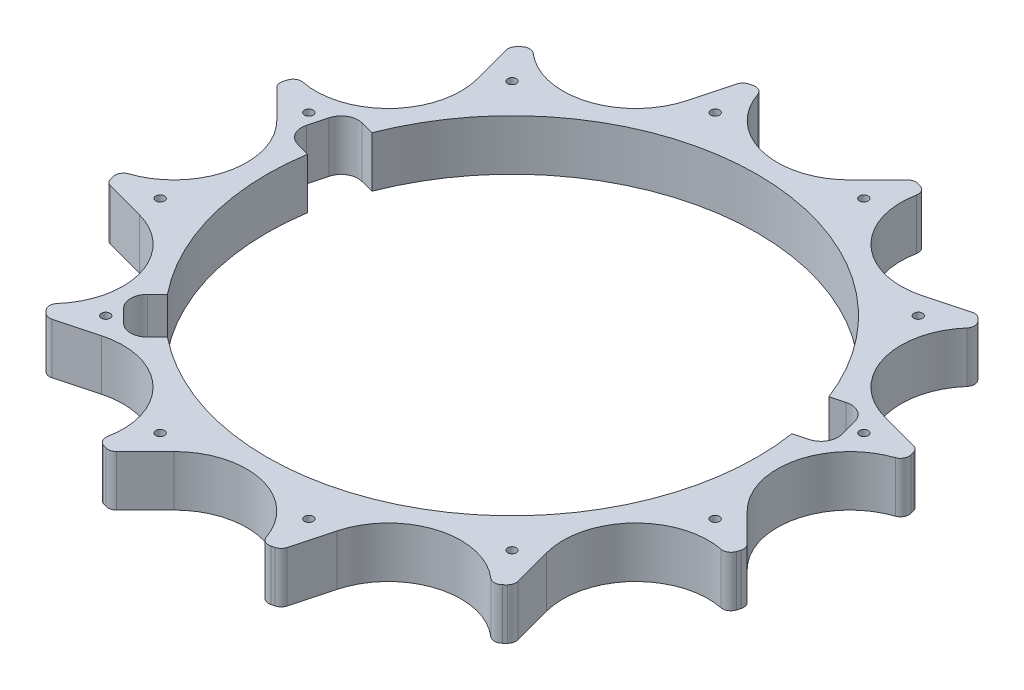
ISO-10303-21;
HEADER;
FILE_DESCRIPTION(('STEP AP214'),'2;1');
FILE_NAME('part.step','',(''),(''),'','','');
FILE_SCHEMA(('AUTOMOTIVE_DESIGN { 1 0 10303 214 1 1 1 1 }'));
ENDSEC;
DATA;
#1=APPLICATION_CONTEXT('core data for automotive mechanical design processes');
#2=APPLICATION_PROTOCOL_DEFINITION('international standard','automotive_design',2000,#1);
#3=PRODUCT_CONTEXT('',#1,'mechanical');
#4=PRODUCT('Part','Part','',(#3));
#5=PRODUCT_RELATED_PRODUCT_CATEGORY('part','',(#4));
#6=PRODUCT_DEFINITION_FORMATION('','',#4);
#7=PRODUCT_DEFINITION_CONTEXT('part definition',#1,'design');
#8=PRODUCT_DEFINITION('design','',#6,#7);
#9=PRODUCT_DEFINITION_SHAPE('','',#8);
#10=(LENGTH_UNIT() NAMED_UNIT(*) SI_UNIT(.MILLI.,.METRE.));
#11=(NAMED_UNIT(*) PLANE_ANGLE_UNIT() SI_UNIT($,.RADIAN.));
#12=(NAMED_UNIT(*) SI_UNIT($,.STERADIAN.) SOLID_ANGLE_UNIT());
#13=UNCERTAINTY_MEASURE_WITH_UNIT(LENGTH_MEASURE(1.E-05),#10,'distance_accuracy_value','');
#14=(GEOMETRIC_REPRESENTATION_CONTEXT(3) GLOBAL_UNCERTAINTY_ASSIGNED_CONTEXT((#13)) GLOBAL_UNIT_ASSIGNED_CONTEXT((#10,
#11,#12)) REPRESENTATION_CONTEXT('',''));
#15=CARTESIAN_POINT('',(0.,0.,0.));
#16=DIRECTION('',(0.,0.,1.));
#17=DIRECTION('',(1.,0.,0.));
#18=AXIS2_PLACEMENT_3D('',#15,#16,#17);
#19=CARTESIAN_POINT('',(0.,19.05,0.));
#20=DIRECTION('',(0.,-1.,0.));
#21=DIRECTION('',(0.,0.,-1.));
#22=AXIS2_PLACEMENT_3D('',#19,#20,#21);
#23=CYLINDRICAL_SURFACE('',#22,92.075);
#24=DIRECTION('',(0.,-1.,0.));
#25=VECTOR('',#24,1.);
#26=CARTESIAN_POINT('',(-71.693502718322,19.05,57.7741057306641));
#27=LINE('',#26,#25);
#28=CARTESIAN_POINT('',(-71.6935027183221,0.,57.7741057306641));
#29=VERTEX_POINT('',#28);
#30=CARTESIAN_POINT('',(-71.6935027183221,19.05,57.7741057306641));
#31=VERTEX_POINT('',#30);
#32=EDGE_CURVE('E11',#29,#31,#27,.F.);
#33=ORIENTED_EDGE('',*,*,#32,.F.);
#34=CARTESIAN_POINT('',(0.,0.,0.));
#35=DIRECTION('',(0.,1.,0.));
#36=DIRECTION('',(0.,0.,1.));
#37=AXIS2_PLACEMENT_3D('',#34,#35,#36);
#38=CIRCLE('',#37,92.075);
#39=CARTESIAN_POINT('',(-90.9754475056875,0.,-14.1870918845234));
#40=VERTEX_POINT('',#39);
#41=EDGE_CURVE('E727',#40,#29,#38,.T.);
#42=ORIENTED_EDGE('',*,*,#41,.F.);
#43=DIRECTION('',(0.,-1.,0.));
#44=VECTOR('',#43,1.);
#45=CARTESIAN_POINT('',(-90.9754475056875,19.05,-14.1870918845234));
#46=LINE('',#45,#44);
#47=CARTESIAN_POINT('',(-90.9754475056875,19.05,-14.1870918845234));
#48=VERTEX_POINT('',#47);
#49=EDGE_CURVE('E1125',#48,#40,#46,.T.);
#50=ORIENTED_EDGE('',*,*,#49,.F.);
#51=CARTESIAN_POINT('',(0.,19.05,0.));
#52=DIRECTION('',(0.,1.,0.));
#53=DIRECTION('',(0.,0.,1.));
#54=AXIS2_PLACEMENT_3D('',#51,#52,#53);
#55=CIRCLE('',#54,92.075);
#56=EDGE_CURVE('E549',#48,#31,#55,.T.);
#57=ORIENTED_EDGE('',*,*,#56,.T.);
#58=EDGE_LOOP('',(#33,#42,#50,#57));
#59=FACE_BOUND('',#58,.T.);
#60=ADVANCED_FACE('F43',(#59),#23,.F.);
#61=DIRECTION('',(0.,-1.,0.));
#62=VECTOR('',#61,1.);
#63=CARTESIAN_POINT('',(-85.8805946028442,19.05,-33.2013417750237));
#64=LINE('',#63,#62);
#65=CARTESIAN_POINT('',(-85.8805946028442,0.,-33.2013417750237));
#66=VERTEX_POINT('',#65);
#67=CARTESIAN_POINT('',(-85.8805946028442,19.05,-33.2013417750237));
#68=VERTEX_POINT('',#67);
#69=EDGE_CURVE('E1127',#66,#68,#64,.F.);
#70=ORIENTED_EDGE('',*,*,#69,.F.);
#71=CARTESIAN_POINT('',(85.8805946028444,0.,-33.2013417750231));
#72=VERTEX_POINT('',#71);
#73=EDGE_CURVE('E724',#72,#66,#38,.T.);
#74=ORIENTED_EDGE('',*,*,#73,.F.);
#75=DIRECTION('',(0.,-1.,0.));
#76=VECTOR('',#75,1.);
#77=CARTESIAN_POINT('',(85.8805946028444,19.05,-33.2013417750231));
#78=LINE('',#77,#76);
#79=CARTESIAN_POINT('',(85.8805946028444,19.05,-33.2013417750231));
#80=VERTEX_POINT('',#79);
#81=EDGE_CURVE('E1120',#80,#72,#78,.T.);
#82=ORIENTED_EDGE('',*,*,#81,.F.);
#83=EDGE_CURVE('E719',#80,#68,#55,.T.);
#84=ORIENTED_EDGE('',*,*,#83,.T.);
#85=EDGE_LOOP('',(#70,#74,#82,#84));
#86=FACE_BOUND('',#85,.T.);
#87=ADVANCED_FACE('F1181',(#86),#23,.F.);
#88=CARTESIAN_POINT('',(0.,19.05,0.));
#89=DIRECTION('',(0.,-1.,0.));
#90=DIRECTION('',(0.,0.,-1.));
#91=AXIS2_PLACEMENT_3D('',#88,#89,#90);
#92=CYLINDRICAL_SURFACE('',#91,123.825);
#93=CARTESIAN_POINT('',(0.,19.05,0.));
#94=DIRECTION('',(0.,1.,0.));
#95=DIRECTION('',(0.,0.,1.));
#96=AXIS2_PLACEMENT_3D('',#93,#94,#95);
#97=CIRCLE('',#96,123.825);
#98=CARTESIAN_POINT('',(-34.4792065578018,19.05,118.92777194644));
#99=VERTEX_POINT('',#98);
#100=CARTESIAN_POINT('',(-33.1911389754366,19.05,119.293666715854));
#101=VERTEX_POINT('',#100);
#102=EDGE_CURVE('E1246',#99,#101,#97,.T.);
#103=ORIENTED_EDGE('',*,*,#102,.F.);
#104=DIRECTION('',(0.,-1.,0.));
#105=VECTOR('',#104,1.);
#106=CARTESIAN_POINT('',(-34.4792065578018,19.05,118.92777194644));
#107=LINE('',#106,#105);
#108=CARTESIAN_POINT('',(-34.4792065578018,0.,118.92777194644));
#109=VERTEX_POINT('',#108);
#110=EDGE_CURVE('E1040',#99,#109,#107,.T.);
#111=ORIENTED_EDGE('',*,*,#110,.T.);
#112=CARTESIAN_POINT('',(0.,0.,0.));
#113=DIRECTION('',(0.,1.,0.));
#114=DIRECTION('',(0.,0.,1.));
#115=AXIS2_PLACEMENT_3D('',#112,#113,#114);
#116=CIRCLE('',#115,123.825);
#117=CARTESIAN_POINT('',(-33.1911389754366,0.,119.293666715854));
#118=VERTEX_POINT('',#117);
#119=EDGE_CURVE('E1315',#109,#118,#116,.T.);
#120=ORIENTED_EDGE('',*,*,#119,.T.);
#121=DIRECTION('',(0.,-1.,0.));
#122=VECTOR('',#121,1.);
#123=CARTESIAN_POINT('',(-33.1911389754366,19.05,119.293666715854));
#124=LINE('',#123,#122);
#125=EDGE_CURVE('E1007',#118,#101,#124,.F.);
#126=ORIENTED_EDGE('',*,*,#125,.T.);
#127=EDGE_LOOP('',(#103,#111,#120,#126));
#128=FACE_BOUND('',#127,.T.);
#129=ADVANCED_FACE('F1207',(#128),#92,.T.);
#130=CARTESIAN_POINT('',(29.6040171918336,19.05,120.234075));
#131=VERTEX_POINT('',#130);
#132=CARTESIAN_POINT('',(30.9024638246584,19.05,119.906915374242));
#133=VERTEX_POINT('',#132);
#134=EDGE_CURVE('E1249',#131,#133,#97,.T.);
#135=ORIENTED_EDGE('',*,*,#134,.F.);
#136=DIRECTION('',(0.,-1.,0.));
#137=VECTOR('',#136,1.);
#138=CARTESIAN_POINT('',(29.6040171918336,19.05,120.234075));
#139=LINE('',#138,#137);
#140=CARTESIAN_POINT('',(29.6040171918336,0.,120.234075));
#141=VERTEX_POINT('',#140);
#142=EDGE_CURVE('E1021',#131,#141,#139,.T.);
#143=ORIENTED_EDGE('',*,*,#142,.T.);
#144=CARTESIAN_POINT('',(30.9024638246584,0.,119.906915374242));
#145=VERTEX_POINT('',#144);
#146=EDGE_CURVE('E1318',#141,#145,#116,.T.);
#147=ORIENTED_EDGE('',*,*,#146,.T.);
#148=DIRECTION('',(0.,-1.,0.));
#149=VECTOR('',#148,1.);
#150=CARTESIAN_POINT('',(30.9024638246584,19.05,119.906915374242));
#151=LINE('',#150,#149);
#152=EDGE_CURVE('E988',#145,#133,#151,.F.);
#153=ORIENTED_EDGE('',*,*,#152,.T.);
#154=EDGE_LOOP('',(#135,#143,#147,#153));
#155=FACE_BOUND('',#154,.T.);
#156=ADVANCED_FACE('F1500',(#155),#92,.T.);
#157=CARTESIAN_POINT('',(-120.234075,19.05,29.6040171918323));
#158=VERTEX_POINT('',#157);
#159=CARTESIAN_POINT('',(-119.906915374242,19.05,30.902463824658));
#160=VERTEX_POINT('',#159);
#161=EDGE_CURVE('E1240',#158,#160,#97,.T.);
#162=ORIENTED_EDGE('',*,*,#161,.F.);
#163=DIRECTION('',(0.,-1.,0.));
#164=VECTOR('',#163,1.);
#165=CARTESIAN_POINT('',(-120.234075,19.05,29.6040171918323));
#166=LINE('',#165,#164);
#167=CARTESIAN_POINT('',(-120.234075,0.,29.6040171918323));
#168=VERTEX_POINT('',#167);
#169=EDGE_CURVE('E1078',#158,#168,#166,.T.);
#170=ORIENTED_EDGE('',*,*,#169,.T.);
#171=CARTESIAN_POINT('',(-119.906915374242,0.,30.902463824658));
#172=VERTEX_POINT('',#171);
#173=EDGE_CURVE('E1309',#168,#172,#116,.T.);
#174=ORIENTED_EDGE('',*,*,#173,.T.);
#175=DIRECTION('',(0.,-1.,0.));
#176=VECTOR('',#175,1.);
#177=CARTESIAN_POINT('',(-119.906915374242,19.05,30.902463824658));
#178=LINE('',#177,#176);
#179=EDGE_CURVE('E1045',#172,#160,#178,.F.);
#180=ORIENTED_EDGE('',*,*,#179,.T.);
#181=EDGE_LOOP('',(#162,#170,#174,#180));
#182=FACE_BOUND('',#181,.T.);
#183=ADVANCED_FACE('F1454',(#182),#92,.T.);
#184=CARTESIAN_POINT('',(-89.3237547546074,19.05,85.7548684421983));
#185=VERTEX_POINT('',#184);
#186=CARTESIAN_POINT('',(-88.3912028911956,19.05,86.7157763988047));
#187=VERTEX_POINT('',#186);
#188=EDGE_CURVE('E1243',#185,#187,#97,.T.);
#189=ORIENTED_EDGE('',*,*,#188,.F.);
#190=DIRECTION('',(0.,-1.,0.));
#191=VECTOR('',#190,1.);
#192=CARTESIAN_POINT('',(-89.3237547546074,19.05,85.7548684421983));
#193=LINE('',#192,#191);
#194=CARTESIAN_POINT('',(-89.3237547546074,0.,85.7548684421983));
#195=VERTEX_POINT('',#194);
#196=EDGE_CURVE('E1059',#185,#195,#193,.T.);
#197=ORIENTED_EDGE('',*,*,#196,.T.);
#198=CARTESIAN_POINT('',(-88.3912028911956,0.,86.7157763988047));
#199=VERTEX_POINT('',#198);
#200=EDGE_CURVE('E1312',#195,#199,#116,.T.);
#201=ORIENTED_EDGE('',*,*,#200,.T.);
#202=DIRECTION('',(0.,-1.,0.));
#203=VECTOR('',#202,1.);
#204=CARTESIAN_POINT('',(-88.3912028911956,19.05,86.7157763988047));
#205=LINE('',#204,#203);
#206=EDGE_CURVE('E1026',#199,#187,#205,.F.);
#207=ORIENTED_EDGE('',*,*,#206,.T.);
#208=EDGE_LOOP('',(#189,#197,#201,#207));
#209=FACE_BOUND('',#208,.T.);
#210=ADVANCED_FACE('F1470',(#209),#92,.T.);
#211=CARTESIAN_POINT('',(120.234075,19.05,-29.6040171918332));
#212=VERTEX_POINT('',#211);
#213=CARTESIAN_POINT('',(119.906915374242,19.05,-30.9024638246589));
#214=VERTEX_POINT('',#213);
#215=EDGE_CURVE('E1258',#212,#214,#97,.T.);
#216=ORIENTED_EDGE('',*,*,#215,.F.);
#217=DIRECTION('',(0.,-1.,0.));
#218=VECTOR('',#217,1.);
#219=CARTESIAN_POINT('',(120.234075,19.05,-29.6040171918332));
#220=LINE('',#219,#218);
#221=CARTESIAN_POINT('',(120.234075,0.,-29.6040171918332));
#222=VERTEX_POINT('',#221);
#223=EDGE_CURVE('E964',#212,#222,#220,.T.);
#224=ORIENTED_EDGE('',*,*,#223,.T.);
#225=CARTESIAN_POINT('',(119.906915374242,0.,-30.9024638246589));
#226=VERTEX_POINT('',#225);
#227=EDGE_CURVE('E1327',#222,#226,#116,.T.);
#228=ORIENTED_EDGE('',*,*,#227,.T.);
#229=DIRECTION('',(0.,-1.,0.));
#230=VECTOR('',#229,1.);
#231=CARTESIAN_POINT('',(119.906915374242,19.05,-30.9024638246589));
#232=LINE('',#231,#230);
#233=EDGE_CURVE('E931',#226,#214,#232,.F.);
#234=ORIENTED_EDGE('',*,*,#233,.T.);
#235=EDGE_LOOP('',(#216,#224,#228,#234));
#236=FACE_BOUND('',#235,.T.);
#237=ADVANCED_FACE('F1548',(#236),#92,.T.);
#238=CARTESIAN_POINT('',(89.3237547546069,19.05,-85.7548684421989));
#239=VERTEX_POINT('',#238);
#240=CARTESIAN_POINT('',(88.391202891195,19.05,-86.7157763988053));
#241=VERTEX_POINT('',#240);
#242=EDGE_CURVE('E1261',#239,#241,#97,.T.);
#243=ORIENTED_EDGE('',*,*,#242,.F.);
#244=DIRECTION('',(0.,-1.,0.));
#245=VECTOR('',#244,1.);
#246=CARTESIAN_POINT('',(89.3237547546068,19.05,-85.7548684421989));
#247=LINE('',#246,#245);
#248=CARTESIAN_POINT('',(89.3237547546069,0.,-85.7548684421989));
#249=VERTEX_POINT('',#248);
#250=EDGE_CURVE('E945',#239,#249,#247,.T.);
#251=ORIENTED_EDGE('',*,*,#250,.T.);
#252=CARTESIAN_POINT('',(88.391202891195,0.,-86.7157763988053));
#253=VERTEX_POINT('',#252);
#254=EDGE_CURVE('E1280',#249,#253,#116,.T.);
#255=ORIENTED_EDGE('',*,*,#254,.T.);
#256=DIRECTION('',(0.,-1.,0.));
#257=VECTOR('',#256,1.);
#258=CARTESIAN_POINT('',(88.391202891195,19.05,-86.7157763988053));
#259=LINE('',#258,#257);
#260=EDGE_CURVE('E912',#253,#241,#259,.F.);
#261=ORIENTED_EDGE('',*,*,#260,.T.);
#262=EDGE_LOOP('',(#243,#251,#255,#261));
#263=FACE_BOUND('',#262,.T.);
#264=ADVANCED_FACE('F1334',(#263),#92,.T.);
#265=CARTESIAN_POINT('',(85.7548684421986,19.05,89.3237547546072));
#266=VERTEX_POINT('',#265);
#267=CARTESIAN_POINT('',(86.715776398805,19.05,88.3912028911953));
#268=VERTEX_POINT('',#267);
#269=EDGE_CURVE('E1252',#266,#268,#97,.T.);
#270=ORIENTED_EDGE('',*,*,#269,.F.);
#271=DIRECTION('',(0.,-1.,0.));
#272=VECTOR('',#271,1.);
#273=CARTESIAN_POINT('',(85.7548684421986,19.05,89.3237547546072));
#274=LINE('',#273,#272);
#275=CARTESIAN_POINT('',(85.7548684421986,0.,89.3237547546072));
#276=VERTEX_POINT('',#275);
#277=EDGE_CURVE('E1002',#266,#276,#274,.T.);
#278=ORIENTED_EDGE('',*,*,#277,.T.);
#279=CARTESIAN_POINT('',(86.715776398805,0.,88.3912028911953));
#280=VERTEX_POINT('',#279);
#281=EDGE_CURVE('E1321',#276,#280,#116,.T.);
#282=ORIENTED_EDGE('',*,*,#281,.T.);
#283=DIRECTION('',(0.,-1.,0.));
#284=VECTOR('',#283,1.);
#285=CARTESIAN_POINT('',(86.715776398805,19.05,88.3912028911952));
#286=LINE('',#285,#284);
#287=EDGE_CURVE('E969',#280,#268,#286,.F.);
#288=ORIENTED_EDGE('',*,*,#287,.T.);
#289=EDGE_LOOP('',(#270,#278,#282,#288));
#290=FACE_BOUND('',#289,.T.);
#291=ADVANCED_FACE('F1516',(#290),#92,.T.);
#292=CARTESIAN_POINT('',(118.92777194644,19.05,34.4792065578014));
#293=VERTEX_POINT('',#292);
#294=CARTESIAN_POINT('',(119.293666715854,19.05,33.191138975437));
#295=VERTEX_POINT('',#294);
#296=EDGE_CURVE('E1255',#293,#295,#97,.T.);
#297=ORIENTED_EDGE('',*,*,#296,.F.);
#298=DIRECTION('',(0.,-1.,0.));
#299=VECTOR('',#298,1.);
#300=CARTESIAN_POINT('',(118.92777194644,19.05,34.4792065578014));
#301=LINE('',#300,#299);
#302=CARTESIAN_POINT('',(118.92777194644,0.,34.4792065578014));
#303=VERTEX_POINT('',#302);
#304=EDGE_CURVE('E983',#293,#303,#301,.T.);
#305=ORIENTED_EDGE('',*,*,#304,.T.);
#306=CARTESIAN_POINT('',(119.293666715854,0.,33.191138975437));
#307=VERTEX_POINT('',#306);
#308=EDGE_CURVE('E1324',#303,#307,#116,.T.);
#309=ORIENTED_EDGE('',*,*,#308,.T.);
#310=DIRECTION('',(0.,-1.,0.));
#311=VECTOR('',#310,1.);
#312=CARTESIAN_POINT('',(119.293666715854,19.05,33.191138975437));
#313=LINE('',#312,#311);
#314=EDGE_CURVE('E950',#307,#295,#313,.F.);
#315=ORIENTED_EDGE('',*,*,#314,.T.);
#316=EDGE_LOOP('',(#297,#305,#309,#315));
#317=FACE_BOUND('',#316,.T.);
#318=ADVANCED_FACE('F1532',(#317),#92,.T.);
#319=CARTESIAN_POINT('',(-85.754868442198,19.05,-89.3237547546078));
#320=VERTEX_POINT('',#319);
#321=CARTESIAN_POINT('',(-86.7157763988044,19.05,-88.3912028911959));
#322=VERTEX_POINT('',#321);
#323=EDGE_CURVE('E864',#320,#322,#97,.T.);
#324=ORIENTED_EDGE('',*,*,#323,.F.);
#325=DIRECTION('',(0.,-1.,0.));
#326=VECTOR('',#325,1.);
#327=CARTESIAN_POINT('',(-85.754868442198,19.05,-89.3237547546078));
#328=LINE('',#327,#326);
#329=CARTESIAN_POINT('',(-85.754868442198,0.,-89.3237547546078));
#330=VERTEX_POINT('',#329);
#331=EDGE_CURVE('E1115',#320,#330,#328,.T.);
#332=ORIENTED_EDGE('',*,*,#331,.T.);
#333=CARTESIAN_POINT('',(-86.7157763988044,0.,-88.3912028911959));
#334=VERTEX_POINT('',#333);
#335=EDGE_CURVE('E869',#330,#334,#116,.T.);
#336=ORIENTED_EDGE('',*,*,#335,.T.);
#337=DIRECTION('',(0.,-1.,0.));
#338=VECTOR('',#337,1.);
#339=CARTESIAN_POINT('',(-86.7157763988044,19.05,-88.3912028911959));
#340=LINE('',#339,#338);
#341=EDGE_CURVE('E1083',#334,#322,#340,.F.);
#342=ORIENTED_EDGE('',*,*,#341,.T.);
#343=EDGE_LOOP('',(#324,#332,#336,#342));
#344=FACE_BOUND('',#343,.T.);
#345=ADVANCED_FACE('F1236',(#344),#92,.T.);
#346=CARTESIAN_POINT('',(-118.92777194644,19.05,-34.4792065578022));
#347=VERTEX_POINT('',#346);
#348=CARTESIAN_POINT('',(-119.293666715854,19.05,-33.1911389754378));
#349=VERTEX_POINT('',#348);
#350=EDGE_CURVE('E1239',#347,#349,#97,.T.);
#351=ORIENTED_EDGE('',*,*,#350,.F.);
#352=DIRECTION('',(0.,-1.,0.));
#353=VECTOR('',#352,1.);
#354=CARTESIAN_POINT('',(-118.92777194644,19.05,-34.4792065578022));
#355=LINE('',#354,#353);
#356=CARTESIAN_POINT('',(-118.92777194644,0.,-34.4792065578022));
#357=VERTEX_POINT('',#356);
#358=EDGE_CURVE('E1097',#347,#357,#355,.T.);
#359=ORIENTED_EDGE('',*,*,#358,.T.);
#360=CARTESIAN_POINT('',(-119.293666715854,0.,-33.1911389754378));
#361=VERTEX_POINT('',#360);
#362=EDGE_CURVE('E1308',#357,#361,#116,.T.);
#363=ORIENTED_EDGE('',*,*,#362,.T.);
#364=DIRECTION('',(0.,-1.,0.));
#365=VECTOR('',#364,1.);
#366=CARTESIAN_POINT('',(-119.293666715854,19.05,-33.1911389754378));
#367=LINE('',#366,#365);
#368=EDGE_CURVE('E1064',#361,#349,#367,.F.);
#369=ORIENTED_EDGE('',*,*,#368,.T.);
#370=EDGE_LOOP('',(#351,#359,#363,#369));
#371=FACE_BOUND('',#370,.T.);
#372=ADVANCED_FACE('F1438',(#371),#92,.T.);
#373=CARTESIAN_POINT('',(34.479206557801,19.05,-118.92777194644));
#374=VERTEX_POINT('',#373);
#375=CARTESIAN_POINT('',(33.1911389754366,19.05,-119.293666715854));
#376=VERTEX_POINT('',#375);
#377=EDGE_CURVE('E865',#374,#376,#97,.T.);
#378=ORIENTED_EDGE('',*,*,#377,.F.);
#379=DIRECTION('',(0.,-1.,0.));
#380=VECTOR('',#379,1.);
#381=CARTESIAN_POINT('',(34.479206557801,19.05,-118.92777194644));
#382=LINE('',#381,#380);
#383=CARTESIAN_POINT('',(34.479206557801,0.,-118.92777194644));
#384=VERTEX_POINT('',#383);
#385=EDGE_CURVE('E926',#374,#384,#382,.T.);
#386=ORIENTED_EDGE('',*,*,#385,.T.);
#387=CARTESIAN_POINT('',(33.1911389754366,0.,-119.293666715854));
#388=VERTEX_POINT('',#387);
#389=EDGE_CURVE('E859',#384,#388,#116,.T.);
#390=ORIENTED_EDGE('',*,*,#389,.T.);
#391=DIRECTION('',(0.,-1.,0.));
#392=VECTOR('',#391,1.);
#393=CARTESIAN_POINT('',(33.1911389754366,19.05,-119.293666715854));
#394=LINE('',#393,#392);
#395=EDGE_CURVE('E874',#388,#376,#394,.F.);
#396=ORIENTED_EDGE('',*,*,#395,.T.);
#397=EDGE_LOOP('',(#378,#386,#390,#396));
#398=FACE_BOUND('',#397,.T.);
#399=ADVANCED_FACE('F1278',(#398),#92,.T.);
#400=CARTESIAN_POINT('',(-29.6040171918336,0.,-120.234075));
#401=VERTEX_POINT('',#400);
#402=CARTESIAN_POINT('',(-30.9024638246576,0.,-119.906915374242));
#403=VERTEX_POINT('',#402);
#404=EDGE_CURVE('E866',#401,#403,#116,.T.);
#405=ORIENTED_EDGE('',*,*,#404,.T.);
#406=DIRECTION('',(0.,-1.,0.));
#407=VECTOR('',#406,1.);
#408=CARTESIAN_POINT('',(-30.9024638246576,19.05,-119.906915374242));
#409=LINE('',#408,#407);
#410=CARTESIAN_POINT('',(-30.9024638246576,19.05,-119.906915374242));
#411=VERTEX_POINT('',#410);
#412=EDGE_CURVE('E1102',#403,#411,#409,.F.);
#413=ORIENTED_EDGE('',*,*,#412,.T.);
#414=CARTESIAN_POINT('',(-29.6040171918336,19.05,-120.234075));
#415=VERTEX_POINT('',#414);
#416=EDGE_CURVE('E860',#415,#411,#97,.T.);
#417=ORIENTED_EDGE('',*,*,#416,.F.);
#418=DIRECTION('',(0.,-1.,0.));
#419=VECTOR('',#418,1.);
#420=CARTESIAN_POINT('',(-29.6040171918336,19.05,-120.234075));
#421=LINE('',#420,#419);
#422=EDGE_CURVE('E871',#415,#401,#421,.T.);
#423=ORIENTED_EDGE('',*,*,#422,.T.);
#424=EDGE_LOOP('',(#405,#413,#417,#423));
#425=FACE_BOUND('',#424,.T.);
#426=ADVANCED_FACE('F1296',(#425),#92,.T.);
#427=CARTESIAN_POINT('',(0.,19.05,0.));
#428=DIRECTION('',(0.,1.,0.));
#429=DIRECTION('',(0.,0.,1.));
#430=AXIS2_PLACEMENT_3D('',#427,#428,#429);
#431=PLANE('',#430);
#432=DIRECTION('',(0.707106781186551,0.,-0.707106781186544));
#433=VECTOR('',#432,1.);
#434=CARTESIAN_POINT('',(-6.95969849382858,19.05,-6.95969849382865));
#435=LINE('',#434,#433);
#436=CARTESIAN_POINT('',(-75.4341514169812,19.05,61.5147544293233));
#437=VERTEX_POINT('',#436);
#438=EDGE_CURVE('E586',#437,#31,#435,.T.);
#439=ORIENTED_EDGE('',*,*,#438,.T.);
#440=ORIENTED_EDGE('',*,*,#56,.F.);
#441=DIRECTION('',(-0.965925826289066,0.,-0.258819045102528));
#442=VECTOR('',#441,1.);
#443=CARTESIAN_POINT('',(-96.0852686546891,19.05,-15.5562643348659));
#444=LINE('',#443,#442);
#445=CARTESIAN_POINT('',(-96.0852686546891,19.05,-15.5562643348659));
#446=VERTEX_POINT('',#445);
#447=EDGE_CURVE('E66',#48,#446,#444,.T.);
#448=ORIENTED_EDGE('',*,*,#447,.T.);
#449=CARTESIAN_POINT('',(-94.4417677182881,19.05,-21.6898933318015));
#450=DIRECTION('',(0.,-1.,0.));
#451=DIRECTION('',(0.500000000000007,0.,-0.866025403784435));
#452=AXIS2_PLACEMENT_3D('',#449,#450,#451);
#453=CIRCLE('',#452,6.35);
#454=CARTESIAN_POINT('',(-100.575396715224,19.05,-23.3333942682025));
#455=VERTEX_POINT('',#454);
#456=EDGE_CURVE('E537',#446,#455,#453,.T.);
#457=ORIENTED_EDGE('',*,*,#456,.T.);
#458=DIRECTION('',(0.258819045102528,0.,-0.965925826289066));
#459=VECTOR('',#458,1.);
#460=CARTESIAN_POINT('',(-98.7675456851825,19.05,-30.0803861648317));
#461=LINE('',#460,#459);
#462=CARTESIAN_POINT('',(-98.7675456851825,19.05,-30.0803861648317));
#463=VERTEX_POINT('',#462);
#464=EDGE_CURVE('E542',#455,#463,#461,.T.);
#465=ORIENTED_EDGE('',*,*,#464,.T.);
#466=CARTESIAN_POINT('',(-92.6339166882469,19.05,-28.4368852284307));
#467=DIRECTION('',(0.,-1.,0.));
#468=DIRECTION('',(0.500000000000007,0.,-0.866025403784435));
#469=AXIS2_PLACEMENT_3D('',#466,#467,#468);
#470=CIRCLE('',#469,6.35);
#471=CARTESIAN_POINT('',(-90.9904157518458,19.05,-34.5705142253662));
#472=VERTEX_POINT('',#471);
#473=EDGE_CURVE('E556',#463,#472,#470,.T.);
#474=ORIENTED_EDGE('',*,*,#473,.T.);
#475=DIRECTION('',(0.965925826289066,0.,0.258819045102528));
#476=VECTOR('',#475,1.);
#477=CARTESIAN_POINT('',(2.54742645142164,19.05,-9.50712494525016));
#478=LINE('',#477,#476);
#479=EDGE_CURVE('E534',#472,#68,#478,.T.);
#480=ORIENTED_EDGE('',*,*,#479,.T.);
#481=ORIENTED_EDGE('',*,*,#83,.F.);
#482=DIRECTION('',(0.965925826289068,0.,-0.258819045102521));
#483=VECTOR('',#482,1.);
#484=CARTESIAN_POINT('',(90.9904157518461,19.05,-34.5705142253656));
#485=LINE('',#484,#483);
#486=CARTESIAN_POINT('',(90.9904157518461,19.05,-34.5705142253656));
#487=VERTEX_POINT('',#486);
#488=EDGE_CURVE('E609',#80,#487,#485,.T.);
#489=ORIENTED_EDGE('',*,*,#488,.T.);
#490=CARTESIAN_POINT('',(92.6339166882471,19.05,-28.43688522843));
#491=DIRECTION('',(0.,-1.,0.));
#492=DIRECTION('',(0.,0.,1.));
#493=AXIS2_PLACEMENT_3D('',#490,#491,#492);
#494=CIRCLE('',#493,6.35);
#495=CARTESIAN_POINT('',(98.7675456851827,19.05,-30.080386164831));
#496=VERTEX_POINT('',#495);
#497=EDGE_CURVE('E612',#487,#496,#494,.T.);
#498=ORIENTED_EDGE('',*,*,#497,.T.);
#499=DIRECTION('',(0.258819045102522,0.,0.965925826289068));
#500=VECTOR('',#499,1.);
#501=CARTESIAN_POINT('',(100.575396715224,19.05,-23.3333942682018));
#502=LINE('',#501,#500);
#503=CARTESIAN_POINT('',(100.575396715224,19.05,-23.3333942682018));
#504=VERTEX_POINT('',#503);
#505=EDGE_CURVE('E616',#496,#504,#502,.T.);
#506=ORIENTED_EDGE('',*,*,#505,.T.);
#507=CARTESIAN_POINT('',(94.4417677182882,19.05,-21.6898933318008));
#508=DIRECTION('',(0.,-1.,0.));
#509=DIRECTION('',(0.,0.,1.));
#510=AXIS2_PLACEMENT_3D('',#507,#508,#509);
#511=CIRCLE('',#510,6.35);
#512=CARTESIAN_POINT('',(96.0852686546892,19.05,-15.5562643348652));
#513=VERTEX_POINT('',#512);
#514=EDGE_CURVE('E619',#504,#513,#511,.T.);
#515=ORIENTED_EDGE('',*,*,#514,.T.);
#516=DIRECTION('',(-0.965925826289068,0.,0.258819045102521));
#517=VECTOR('',#516,1.);
#518=CARTESIAN_POINT('',(2.54742645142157,19.05,9.50712494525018));
#519=LINE('',#518,#517);
#520=CARTESIAN_POINT('',(90.9754475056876,19.05,-14.1870918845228));
#521=VERTEX_POINT('',#520);
#522=EDGE_CURVE('E622',#513,#521,#519,.T.);
#523=ORIENTED_EDGE('',*,*,#522,.T.);
#524=CARTESIAN_POINT('',(-57.7741057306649,19.05,71.6935027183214));
#525=VERTEX_POINT('',#524);
#526=EDGE_CURVE('E723',#525,#521,#55,.T.);
#527=ORIENTED_EDGE('',*,*,#526,.F.);
#528=DIRECTION('',(-0.707106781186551,0.,0.707106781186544));
#529=VECTOR('',#528,1.);
#530=CARTESIAN_POINT('',(-61.5147544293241,19.05,75.4341514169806));
#531=LINE('',#530,#529);
#532=CARTESIAN_POINT('',(-61.5147544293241,19.05,75.4341514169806));
#533=VERTEX_POINT('',#532);
#534=EDGE_CURVE('E58',#525,#533,#531,.T.);
#535=ORIENTED_EDGE('',*,*,#534,.T.);
#536=CARTESIAN_POINT('',(-66.0048824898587,19.05,70.944023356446));
#537=DIRECTION('',(0.,-1.,0.));
#538=DIRECTION('',(-0.499999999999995,0.,-0.866025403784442));
#539=AXIS2_PLACEMENT_3D('',#536,#537,#538);
#540=CIRCLE('',#539,6.35);
#541=CARTESIAN_POINT('',(-70.4950105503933,19.05,75.4341514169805));
#542=VERTEX_POINT('',#541);
#543=EDGE_CURVE('E576',#533,#542,#540,.T.);
#544=ORIENTED_EDGE('',*,*,#543,.T.);
#545=DIRECTION('',(-0.707106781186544,0.,-0.707106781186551));
#546=VECTOR('',#545,1.);
#547=CARTESIAN_POINT('',(-75.4341514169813,19.05,70.4950105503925));
#548=LINE('',#547,#546);
#549=CARTESIAN_POINT('',(-75.4341514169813,19.05,70.4950105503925));
#550=VERTEX_POINT('',#549);
#551=EDGE_CURVE('E580',#542,#550,#548,.T.);
#552=ORIENTED_EDGE('',*,*,#551,.T.);
#553=CARTESIAN_POINT('',(-70.9440233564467,19.05,66.0048824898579));
#554=DIRECTION('',(0.,-1.,0.));
#555=DIRECTION('',(-0.499999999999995,0.,-0.866025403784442));
#556=AXIS2_PLACEMENT_3D('',#553,#554,#555);
#557=CIRCLE('',#556,6.35);
#558=EDGE_CURVE('E583',#550,#437,#557,.T.);
#559=ORIENTED_EDGE('',*,*,#558,.T.);
#560=EDGE_LOOP('',(#439,#440,#448,#457,#465,#474,#480,#481,#489,#498,#506,#515,#523,#527,#535,
#544,#552,#559));
#561=FACE_BOUND('',#560,.T.);
#562=CARTESIAN_POINT('',(-27.9395159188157,19.05,-104.271692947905));
#563=DIRECTION('',(0.,1.,0.));
#564=DIRECTION('',(0.,0.,1.));
#565=AXIS2_PLACEMENT_3D('',#562,#563,#564);
#566=CIRCLE('',#565,1.65);
#567=CARTESIAN_POINT('',(-27.9395159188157,19.05,-102.621692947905));
#568=VERTEX_POINT('',#567);
#569=EDGE_CURVE('E640',#568,#568,#566,.T.);
#570=ORIENTED_EDGE('',*,*,#569,.F.);
#571=EDGE_LOOP('',(#570));
#572=FACE_BOUND('',#571,.T.);
#573=CARTESIAN_POINT('',(-76.3321770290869,19.05,-76.3321770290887));
#574=DIRECTION('',(0.,1.,0.));
#575=DIRECTION('',(0.,0.,1.));
#576=AXIS2_PLACEMENT_3D('',#573,#574,#575);
#577=CIRCLE('',#576,1.65);
#578=CARTESIAN_POINT('',(-76.3321770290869,19.05,-74.6821770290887));
#579=VERTEX_POINT('',#578);
#580=EDGE_CURVE('E652',#579,#579,#577,.T.);
#581=ORIENTED_EDGE('',*,*,#580,.F.);
#582=EDGE_LOOP('',(#581));
#583=FACE_BOUND('',#582,.T.);
#584=CARTESIAN_POINT('',(-104.271692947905,19.05,-27.9395159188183));
#585=DIRECTION('',(0.,1.,0.));
#586=DIRECTION('',(0.,0.,1.));
#587=AXIS2_PLACEMENT_3D('',#584,#585,#586);
#588=CIRCLE('',#587,1.65);
#589=CARTESIAN_POINT('',(-104.271692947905,19.05,-26.2895159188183));
#590=VERTEX_POINT('',#589);
#591=EDGE_CURVE('E658',#590,#590,#588,.T.);
#592=ORIENTED_EDGE('',*,*,#591,.F.);
#593=EDGE_LOOP('',(#592));
#594=FACE_BOUND('',#593,.T.);
#595=CARTESIAN_POINT('',(-104.271692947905,19.05,27.9395159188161));
#596=DIRECTION('',(0.,1.,0.));
#597=DIRECTION('',(0.,0.,1.));
#598=AXIS2_PLACEMENT_3D('',#595,#596,#597);
#599=CIRCLE('',#598,1.65);
#600=CARTESIAN_POINT('',(-104.271692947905,19.05,29.5895159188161));
#601=VERTEX_POINT('',#600);
#602=EDGE_CURVE('E664',#601,#601,#599,.T.);
#603=ORIENTED_EDGE('',*,*,#602,.F.);
#604=EDGE_LOOP('',(#603));
#605=FACE_BOUND('',#604,.T.);
#606=CARTESIAN_POINT('',(-76.3321770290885,19.05,76.3321770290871));
#607=DIRECTION('',(0.,1.,0.));
#608=DIRECTION('',(0.,0.,1.));
#609=AXIS2_PLACEMENT_3D('',#606,#607,#608);
#610=CIRCLE('',#609,1.65);
#611=CARTESIAN_POINT('',(-76.3321770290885,19.05,77.9821770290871));
#612=VERTEX_POINT('',#611);
#613=EDGE_CURVE('E670',#612,#612,#610,.T.);
#614=ORIENTED_EDGE('',*,*,#613,.F.);
#615=EDGE_LOOP('',(#614));
#616=FACE_BOUND('',#615,.T.);
#617=CARTESIAN_POINT('',(-27.9395159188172,19.05,104.271692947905));
#618=DIRECTION('',(0.,1.,0.));
#619=DIRECTION('',(0.,0.,1.));
#620=AXIS2_PLACEMENT_3D('',#617,#618,#619);
#621=CIRCLE('',#620,1.65);
#622=CARTESIAN_POINT('',(-27.9395159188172,19.05,105.921692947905));
#623=VERTEX_POINT('',#622);
#624=EDGE_CURVE('E676',#623,#623,#621,.T.);
#625=ORIENTED_EDGE('',*,*,#624,.F.);
#626=EDGE_LOOP('',(#625));
#627=FACE_BOUND('',#626,.T.);
#628=CARTESIAN_POINT('',(27.9395159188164,19.05,104.271692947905));
#629=DIRECTION('',(0.,1.,0.));
#630=DIRECTION('',(0.,0.,1.));
#631=AXIS2_PLACEMENT_3D('',#628,#629,#630);
#632=CIRCLE('',#631,1.65);
#633=CARTESIAN_POINT('',(27.9395159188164,19.05,105.921692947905));
#634=VERTEX_POINT('',#633);
#635=EDGE_CURVE('E682',#634,#634,#632,.T.);
#636=ORIENTED_EDGE('',*,*,#635,.F.);
#637=EDGE_LOOP('',(#636));
#638=FACE_BOUND('',#637,.T.);
#639=CARTESIAN_POINT('',(76.3321770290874,19.05,76.3321770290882));
#640=DIRECTION('',(0.,1.,0.));
#641=DIRECTION('',(0.,0.,1.));
#642=AXIS2_PLACEMENT_3D('',#639,#640,#641);
#643=CIRCLE('',#642,1.65);
#644=CARTESIAN_POINT('',(76.3321770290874,19.05,77.9821770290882));
#645=VERTEX_POINT('',#644);
#646=EDGE_CURVE('E688',#645,#645,#643,.T.);
#647=ORIENTED_EDGE('',*,*,#646,.F.);
#648=EDGE_LOOP('',(#647));
#649=FACE_BOUND('',#648,.T.);
#650=CARTESIAN_POINT('',(104.271692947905,19.05,27.9395159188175));
#651=DIRECTION('',(0.,1.,0.));
#652=DIRECTION('',(0.,0.,1.));
#653=AXIS2_PLACEMENT_3D('',#650,#651,#652);
#654=CIRCLE('',#653,1.65);
#655=CARTESIAN_POINT('',(104.271692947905,19.05,29.5895159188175));
#656=VERTEX_POINT('',#655);
#657=EDGE_CURVE('E694',#656,#656,#654,.T.);
#658=ORIENTED_EDGE('',*,*,#657,.F.);
#659=EDGE_LOOP('',(#658));
#660=FACE_BOUND('',#659,.T.);
#661=CARTESIAN_POINT('',(104.271692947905,19.05,-27.9395159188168));
#662=DIRECTION('',(0.,1.,0.));
#663=DIRECTION('',(0.,0.,1.));
#664=AXIS2_PLACEMENT_3D('',#661,#662,#663);
#665=CIRCLE('',#664,1.65);
#666=CARTESIAN_POINT('',(104.271692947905,19.05,-26.2895159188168));
#667=VERTEX_POINT('',#666);
#668=EDGE_CURVE('E700',#667,#667,#665,.T.);
#669=ORIENTED_EDGE('',*,*,#668,.F.);
#670=EDGE_LOOP('',(#669));
#671=FACE_BOUND('',#670,.T.);
#672=CARTESIAN_POINT('',(76.3321770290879,19.05,-76.3321770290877));
#673=DIRECTION('',(0.,1.,0.));
#674=DIRECTION('',(0.,0.,1.));
#675=AXIS2_PLACEMENT_3D('',#672,#673,#674);
#676=CIRCLE('',#675,1.65);
#677=CARTESIAN_POINT('',(76.3321770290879,19.05,-74.6821770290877));
#678=VERTEX_POINT('',#677);
#679=EDGE_CURVE('E706',#678,#678,#676,.T.);
#680=ORIENTED_EDGE('',*,*,#679,.F.);
#681=EDGE_LOOP('',(#680));
#682=FACE_BOUND('',#681,.T.);
#683=CARTESIAN_POINT('',(27.9395159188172,19.05,-104.271692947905));
#684=DIRECTION('',(0.,1.,0.));
#685=DIRECTION('',(0.,0.,1.));
#686=AXIS2_PLACEMENT_3D('',#683,#684,#685);
#687=CIRCLE('',#686,1.65);
#688=CARTESIAN_POINT('',(27.9395159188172,19.05,-102.621692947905));
#689=VERTEX_POINT('',#688);
#690=EDGE_CURVE('E712',#689,#689,#687,.T.);
#691=ORIENTED_EDGE('',*,*,#690,.F.);
#692=EDGE_LOOP('',(#691));
#693=FACE_BOUND('',#692,.T.);
#694=ORIENTED_EDGE('',*,*,#416,.T.);
#695=CARTESIAN_POINT('',(-30.1100929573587,19.05,-116.832379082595));
#696=DIRECTION('',(0.,1.,0.));
#697=DIRECTION('',(0.,0.,1.));
#698=AXIS2_PLACEMENT_3D('',#695,#696,#697);
#699=CIRCLE('',#698,3.175);
#700=CARTESIAN_POINT('',(-33.1769074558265,19.05,-117.654129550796));
#701=VERTEX_POINT('',#700);
#702=EDGE_CURVE('E1107',#411,#701,#699,.T.);
#703=ORIENTED_EDGE('',*,*,#702,.T.);
#704=DIRECTION('',(0.258819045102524,0.,-0.965925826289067));
#705=VECTOR('',#704,1.);
#706=CARTESIAN_POINT('',(-22.8192847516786,19.05,-156.309303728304));
#707=LINE('',#706,#705);
#708=CARTESIAN_POINT('',(-37.1253953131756,19.05,-102.9181722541));
#709=VERTEX_POINT('',#708);
#710=EDGE_CURVE('E732',#709,#701,#707,.T.);
#711=ORIENTED_EDGE('',*,*,#710,.F.);
#712=CARTESIAN_POINT('',(-63.4999999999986,19.05,-109.985226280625));
#713=DIRECTION('',(0.,1.,0.));
#714=DIRECTION('',(0.499999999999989,0.,0.866025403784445));
#715=AXIS2_PLACEMENT_3D('',#712,#713,#714);
#716=CIRCLE('',#715,27.305);
#717=CARTESIAN_POINT('',(-81.4668563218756,19.05,-89.4242170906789));
#718=VERTEX_POINT('',#717);
#719=EDGE_CURVE('E722',#718,#709,#716,.T.);
#720=ORIENTED_EDGE('',*,*,#719,.F.);
#721=CARTESIAN_POINT('',(-83.5560256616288,19.05,-87.0334020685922));
#722=DIRECTION('',(0.,1.,0.));
#723=DIRECTION('',(0.,0.,1.));
#724=AXIS2_PLACEMENT_3D('',#721,#722,#723);
#725=CIRCLE('',#724,3.175);
#726=EDGE_CURVE('E1105',#718,#320,#725,.T.);
#727=ORIENTED_EDGE('',*,*,#726,.T.);
#728=ORIENTED_EDGE('',*,*,#323,.T.);
#729=CARTESIAN_POINT('',(-84.4922949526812,19.05,-86.1247617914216));
#730=DIRECTION('',(0.,1.,0.));
#731=DIRECTION('',(0.,0.,1.));
#732=AXIS2_PLACEMENT_3D('',#729,#730,#731);
#733=CIRCLE('',#732,3.175);
#734=CARTESIAN_POINT('',(-87.559109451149,19.05,-85.3030113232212));
#735=VERTEX_POINT('',#734);
#736=EDGE_CURVE('E1088',#322,#735,#733,.T.);
#737=ORIENTED_EDGE('',*,*,#736,.T.);
#738=DIRECTION('',(-0.258819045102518,0.,-0.965925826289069));
#739=VECTOR('',#738,1.);
#740=CARTESIAN_POINT('',(-97.9167321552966,19.05,-123.958185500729));
#741=LINE('',#740,#739);
#742=CARTESIAN_POINT('',(-83.6106215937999,19.05,-70.5670540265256));
#743=VERTEX_POINT('',#742);
#744=EDGE_CURVE('E743',#743,#735,#741,.T.);
#745=ORIENTED_EDGE('',*,*,#744,.F.);
#746=CARTESIAN_POINT('',(-109.985226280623,19.05,-63.5000000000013));
#747=DIRECTION('',(0.,1.,0.));
#748=DIRECTION('',(0.866025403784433,0.,0.50000000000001));
#749=AXIS2_PLACEMENT_3D('',#746,#747,#748);
#750=CIRCLE('',#749,27.305);
#751=CARTESIAN_POINT('',(-115.264475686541,19.05,-36.7102155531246));
#752=VERTEX_POINT('',#751);
#753=EDGE_CURVE('E738',#752,#743,#750,.T.);
#754=ORIENTED_EDGE('',*,*,#753,.F.);
#755=CARTESIAN_POINT('',(-115.878341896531,19.05,-33.5951243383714));
#756=DIRECTION('',(0.,1.,0.));
#757=DIRECTION('',(0.,0.,1.));
#758=AXIS2_PLACEMENT_3D('',#755,#756,#757);
#759=CIRCLE('',#758,3.175);
#760=EDGE_CURVE('E1086',#752,#347,#759,.T.);
#761=ORIENTED_EDGE('',*,*,#760,.T.);
#762=ORIENTED_EDGE('',*,*,#350,.T.);
#763=CARTESIAN_POINT('',(-116.23485474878,19.05,-32.3400841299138));
#764=DIRECTION('',(0.,1.,0.));
#765=DIRECTION('',(0.,0.,1.));
#766=AXIS2_PLACEMENT_3D('',#763,#764,#765);
#767=CIRCLE('',#766,3.175);
#768=CARTESIAN_POINT('',(-118.479918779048,19.05,-30.0950200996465));
#769=VERTEX_POINT('',#768);
#770=EDGE_CURVE('E1069',#349,#769,#767,.T.);
#771=ORIENTED_EDGE('',*,*,#770,.T.);
#772=DIRECTION('',(-0.707106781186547,0.,-0.707106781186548));
#773=VECTOR('',#772,1.);
#774=CARTESIAN_POINT('',(-146.777470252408,19.05,-58.3925715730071));
#775=LINE('',#774,#773);
#776=CARTESIAN_POINT('',(-107.692449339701,19.05,-19.3075506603));
#777=VERTEX_POINT('',#776);
#778=EDGE_CURVE('E754',#777,#769,#775,.T.);
#779=ORIENTED_EDGE('',*,*,#778,.F.);
#780=CARTESIAN_POINT('',(-127.,19.05,-1.33025439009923E-12));
#781=DIRECTION('',(0.,1.,0.));
#782=DIRECTION('',(1.,0.,0.));
#783=AXIS2_PLACEMENT_3D('',#780,#781,#782);
#784=CIRCLE('',#783,27.305);
#785=CARTESIAN_POINT('',(-118.177071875,19.05,25.840258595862));
#786=VERTEX_POINT('',#785);
#787=EDGE_CURVE('E749',#786,#777,#784,.T.);
#788=ORIENTED_EDGE('',*,*,#787,.F.);
#789=CARTESIAN_POINT('',(-117.15115,19.05,28.8449398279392));
#790=DIRECTION('',(0.,1.,0.));
#791=DIRECTION('',(0.,0.,1.));
#792=AXIS2_PLACEMENT_3D('',#789,#790,#791);
#793=CIRCLE('',#792,3.175);
#794=EDGE_CURVE('E1067',#786,#158,#793,.T.);
#795=ORIENTED_EDGE('',*,*,#794,.T.);
#796=ORIENTED_EDGE('',*,*,#161,.T.);
#797=CARTESIAN_POINT('',(-116.832379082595,19.05,30.1100929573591));
#798=DIRECTION('',(0.,1.,0.));
#799=DIRECTION('',(0.,0.,1.));
#800=AXIS2_PLACEMENT_3D('',#797,#798,#799);
#801=CIRCLE('',#800,3.175);
#802=CARTESIAN_POINT('',(-117.654129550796,19.05,33.1769074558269));
#803=VERTEX_POINT('',#802);
#804=EDGE_CURVE('E1050',#160,#803,#801,.T.);
#805=ORIENTED_EDGE('',*,*,#804,.T.);
#806=DIRECTION('',(-0.965925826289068,0.,-0.258819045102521));
#807=VECTOR('',#806,1.);
#808=CARTESIAN_POINT('',(-156.309303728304,19.05,22.8192847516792));
#809=LINE('',#808,#807);
#810=CARTESIAN_POINT('',(-102.9181722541,19.05,37.125395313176));
#811=VERTEX_POINT('',#810);
#812=EDGE_CURVE('E765',#811,#803,#809,.T.);
#813=ORIENTED_EDGE('',*,*,#812,.F.);
#814=CARTESIAN_POINT('',(-109.985226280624,19.05,63.499999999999));
#815=DIRECTION('',(0.,1.,0.));
#816=DIRECTION('',(0.866025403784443,0.,-0.499999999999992));
#817=AXIS2_PLACEMENT_3D('',#814,#815,#816);
#818=CIRCLE('',#817,27.305);
#819=CARTESIAN_POINT('',(-89.4242170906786,19.05,81.466856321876));
#820=VERTEX_POINT('',#819);
#821=EDGE_CURVE('E760',#820,#811,#818,.T.);
#822=ORIENTED_EDGE('',*,*,#821,.F.);
#823=CARTESIAN_POINT('',(-87.0334020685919,19.05,83.5560256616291));
#824=DIRECTION('',(0.,1.,0.));
#825=DIRECTION('',(0.,0.,1.));
#826=AXIS2_PLACEMENT_3D('',#823,#824,#825);
#827=CIRCLE('',#826,3.175);
#828=EDGE_CURVE('E1048',#820,#185,#827,.T.);
#829=ORIENTED_EDGE('',*,*,#828,.T.);
#830=ORIENTED_EDGE('',*,*,#188,.T.);
#831=CARTESIAN_POINT('',(-86.1247617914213,19.05,84.4922949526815));
#832=DIRECTION('',(0.,1.,0.));
#833=DIRECTION('',(0.,0.,1.));
#834=AXIS2_PLACEMENT_3D('',#831,#832,#833);
#835=CIRCLE('',#834,3.175);
#836=CARTESIAN_POINT('',(-85.3030113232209,19.05,87.5591094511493));
#837=VERTEX_POINT('',#836);
#838=EDGE_CURVE('E1031',#187,#837,#835,.T.);
#839=ORIENTED_EDGE('',*,*,#838,.T.);
#840=DIRECTION('',(-0.965925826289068,0.,0.258819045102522));
#841=VECTOR('',#840,1.);
#842=CARTESIAN_POINT('',(-123.958185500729,19.05,97.9167321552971));
#843=LINE('',#842,#841);
#844=CARTESIAN_POINT('',(-70.5670540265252,19.05,83.6106215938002));
#845=VERTEX_POINT('',#844);
#846=EDGE_CURVE('E776',#845,#837,#843,.T.);
#847=ORIENTED_EDGE('',*,*,#846,.F.);
#848=CARTESIAN_POINT('',(-63.5000000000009,19.05,109.985226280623));
#849=DIRECTION('',(0.,1.,0.));
#850=DIRECTION('',(0.500000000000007,0.,-0.866025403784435));
#851=AXIS2_PLACEMENT_3D('',#848,#849,#850);
#852=CIRCLE('',#851,27.305);
#853=CARTESIAN_POINT('',(-36.7102155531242,19.05,115.264475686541));
#854=VERTEX_POINT('',#853);
#855=EDGE_CURVE('E771',#854,#845,#852,.T.);
#856=ORIENTED_EDGE('',*,*,#855,.F.);
#857=CARTESIAN_POINT('',(-33.595124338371,19.05,115.878341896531));
#858=DIRECTION('',(0.,1.,0.));
#859=DIRECTION('',(0.,0.,1.));
#860=AXIS2_PLACEMENT_3D('',#857,#858,#859);
#861=CIRCLE('',#860,3.175);
#862=EDGE_CURVE('E1029',#854,#99,#861,.T.);
#863=ORIENTED_EDGE('',*,*,#862,.T.);
#864=ORIENTED_EDGE('',*,*,#102,.T.);
#865=CARTESIAN_POINT('',(-32.3400841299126,19.05,116.234854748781));
#866=DIRECTION('',(0.,1.,0.));
#867=DIRECTION('',(0.,0.,1.));
#868=AXIS2_PLACEMENT_3D('',#865,#866,#867);
#869=CIRCLE('',#868,3.175);
#870=CARTESIAN_POINT('',(-30.0950200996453,19.05,118.479918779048));
#871=VERTEX_POINT('',#870);
#872=EDGE_CURVE('E1012',#101,#871,#869,.T.);
#873=ORIENTED_EDGE('',*,*,#872,.T.);
#874=DIRECTION('',(-0.707106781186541,0.,0.707106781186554));
#875=VECTOR('',#874,1.);
#876=CARTESIAN_POINT('',(-58.3925715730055,19.05,146.777470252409));
#877=LINE('',#876,#875);
#878=CARTESIAN_POINT('',(-19.3075506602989,19.05,107.692449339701));
#879=VERTEX_POINT('',#878);
#880=EDGE_CURVE('E787',#879,#871,#877,.T.);
#881=ORIENTED_EDGE('',*,*,#880,.F.);
#882=CARTESIAN_POINT('',(0.,19.05,127.));
#883=DIRECTION('',(0.,1.,0.));
#884=DIRECTION('',(0.,0.,-1.));
#885=AXIS2_PLACEMENT_3D('',#882,#883,#884);
#886=CIRCLE('',#885,27.305);
#887=CARTESIAN_POINT('',(25.8402585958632,19.05,118.177071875));
#888=VERTEX_POINT('',#887);
#889=EDGE_CURVE('E782',#888,#879,#886,.T.);
#890=ORIENTED_EDGE('',*,*,#889,.F.);
#891=CARTESIAN_POINT('',(28.8449398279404,19.05,117.15115));
#892=DIRECTION('',(0.,1.,0.));
#893=DIRECTION('',(0.,0.,1.));
#894=AXIS2_PLACEMENT_3D('',#891,#892,#893);
#895=CIRCLE('',#894,3.175);
#896=EDGE_CURVE('E1010',#888,#131,#895,.T.);
#897=ORIENTED_EDGE('',*,*,#896,.T.);
#898=ORIENTED_EDGE('',*,*,#134,.T.);
#899=CARTESIAN_POINT('',(30.1100929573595,19.05,116.832379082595));
#900=DIRECTION('',(0.,1.,0.));
#901=DIRECTION('',(0.,0.,1.));
#902=AXIS2_PLACEMENT_3D('',#899,#900,#901);
#903=CIRCLE('',#902,3.175);
#904=CARTESIAN_POINT('',(33.1769074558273,19.05,117.654129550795));
#905=VERTEX_POINT('',#904);
#906=EDGE_CURVE('E993',#133,#905,#903,.T.);
#907=ORIENTED_EDGE('',*,*,#906,.T.);
#908=DIRECTION('',(-0.258819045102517,0.,0.965925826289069));
#909=VECTOR('',#908,1.);
#910=CARTESIAN_POINT('',(22.8192847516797,19.05,156.309303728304));
#911=LINE('',#910,#909);
#912=CARTESIAN_POINT('',(37.1253953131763,19.05,102.9181722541));
#913=VERTEX_POINT('',#912);
#914=EDGE_CURVE('E798',#913,#905,#911,.T.);
#915=ORIENTED_EDGE('',*,*,#914,.F.);
#916=CARTESIAN_POINT('',(63.4999999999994,19.05,109.985226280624));
#917=DIRECTION('',(0.,1.,0.));
#918=DIRECTION('',(-0.499999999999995,0.,-0.866025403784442));
#919=AXIS2_PLACEMENT_3D('',#916,#917,#918);
#920=CIRCLE('',#919,27.305);
#921=CARTESIAN_POINT('',(81.4668563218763,19.05,89.4242170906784));
#922=VERTEX_POINT('',#921);
#923=EDGE_CURVE('E793',#922,#913,#920,.T.);
#924=ORIENTED_EDGE('',*,*,#923,.F.);
#925=CARTESIAN_POINT('',(83.5560256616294,19.05,87.0334020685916));
#926=DIRECTION('',(0.,1.,0.));
#927=DIRECTION('',(0.,0.,1.));
#928=AXIS2_PLACEMENT_3D('',#925,#926,#927);
#929=CIRCLE('',#928,3.175);
#930=EDGE_CURVE('E991',#922,#266,#929,.T.);
#931=ORIENTED_EDGE('',*,*,#930,.T.);
#932=ORIENTED_EDGE('',*,*,#269,.T.);
#933=CARTESIAN_POINT('',(84.4922949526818,19.05,86.124761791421));
#934=DIRECTION('',(0.,1.,0.));
#935=DIRECTION('',(0.,0.,1.));
#936=AXIS2_PLACEMENT_3D('',#933,#934,#935);
#937=CIRCLE('',#936,3.175);
#938=CARTESIAN_POINT('',(87.5591094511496,19.05,85.3030113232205));
#939=VERTEX_POINT('',#938);
#940=EDGE_CURVE('E974',#268,#939,#937,.T.);
#941=ORIENTED_EDGE('',*,*,#940,.T.);
#942=DIRECTION('',(0.258819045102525,0.,0.965925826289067));
#943=VECTOR('',#942,1.);
#944=CARTESIAN_POINT('',(97.9167321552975,19.05,123.958185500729));
#945=LINE('',#944,#943);
#946=CARTESIAN_POINT('',(83.6106215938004,19.05,70.567054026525));
#947=VERTEX_POINT('',#946);
#948=EDGE_CURVE('E809',#947,#939,#945,.T.);
#949=ORIENTED_EDGE('',*,*,#948,.F.);
#950=CARTESIAN_POINT('',(109.985226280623,19.05,63.5000000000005));
#951=DIRECTION('',(0.,1.,0.));
#952=DIRECTION('',(-0.866025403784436,0.,-0.500000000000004));
#953=AXIS2_PLACEMENT_3D('',#950,#951,#952);
#954=CIRCLE('',#953,27.305);
#955=CARTESIAN_POINT('',(115.264475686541,19.05,36.7102155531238));
#956=VERTEX_POINT('',#955);
#957=EDGE_CURVE('E804',#956,#947,#954,.T.);
#958=ORIENTED_EDGE('',*,*,#957,.F.);
#959=CARTESIAN_POINT('',(115.878341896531,19.05,33.5951243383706));
#960=DIRECTION('',(0.,1.,0.));
#961=DIRECTION('',(0.,0.,1.));
#962=AXIS2_PLACEMENT_3D('',#959,#960,#961);
#963=CIRCLE('',#962,3.175);
#964=EDGE_CURVE('E972',#956,#293,#963,.T.);
#965=ORIENTED_EDGE('',*,*,#964,.T.);
#966=ORIENTED_EDGE('',*,*,#296,.T.);
#967=CARTESIAN_POINT('',(116.234854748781,19.05,32.3400841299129));
#968=DIRECTION('',(0.,1.,0.));
#969=DIRECTION('',(0.,0.,1.));
#970=AXIS2_PLACEMENT_3D('',#967,#968,#969);
#971=CIRCLE('',#970,3.175);
#972=CARTESIAN_POINT('',(118.479918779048,19.05,30.0950200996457));
#973=VERTEX_POINT('',#972);
#974=EDGE_CURVE('E955',#295,#973,#971,.T.);
#975=ORIENTED_EDGE('',*,*,#974,.T.);
#976=DIRECTION('',(0.707106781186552,0.,0.707106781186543));
#977=VECTOR('',#976,1.);
#978=CARTESIAN_POINT('',(146.777470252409,19.05,58.392571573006));
#979=LINE('',#978,#977);
#980=CARTESIAN_POINT('',(107.692449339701,19.05,19.3075506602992));
#981=VERTEX_POINT('',#980);
#982=EDGE_CURVE('E820',#981,#973,#979,.T.);
#983=ORIENTED_EDGE('',*,*,#982,.F.);
#984=CARTESIAN_POINT('',(127.,19.05,4.43418130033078E-13));
#985=DIRECTION('',(0.,1.,0.));
#986=DIRECTION('',(-1.,0.,0.));
#987=AXIS2_PLACEMENT_3D('',#984,#985,#986);
#988=CIRCLE('',#987,27.305);
#989=CARTESIAN_POINT('',(118.177071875,19.05,-25.8402585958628));
#990=VERTEX_POINT('',#989);
#991=EDGE_CURVE('E815',#990,#981,#988,.T.);
#992=ORIENTED_EDGE('',*,*,#991,.F.);
#993=CARTESIAN_POINT('',(117.15115,19.05,-28.84493982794));
#994=DIRECTION('',(0.,1.,0.));
#995=DIRECTION('',(0.,0.,1.));
#996=AXIS2_PLACEMENT_3D('',#993,#994,#995);
#997=CIRCLE('',#996,3.175);
#998=EDGE_CURVE('E953',#990,#212,#997,.T.);
#999=ORIENTED_EDGE('',*,*,#998,.T.);
#1000=ORIENTED_EDGE('',*,*,#215,.T.);
#1001=CARTESIAN_POINT('',(116.832379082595,19.05,-30.1100929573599));
#1002=DIRECTION('',(0.,1.,0.));
#1003=DIRECTION('',(0.,0.,1.));
#1004=AXIS2_PLACEMENT_3D('',#1001,#1002,#1003);
#1005=CIRCLE('',#1004,3.175);
#1006=CARTESIAN_POINT('',(117.654129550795,19.05,-33.1769074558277));
#1007=VERTEX_POINT('',#1006);
#1008=EDGE_CURVE('E936',#214,#1007,#1005,.T.);
#1009=ORIENTED_EDGE('',*,*,#1008,.T.);
#1010=DIRECTION('',(0.96592582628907,0.,0.258819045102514));
#1011=VECTOR('',#1010,1.);
#1012=CARTESIAN_POINT('',(156.309303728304,19.05,-22.8192847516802));
#1013=LINE('',#1012,#1011);
#1014=CARTESIAN_POINT('',(102.9181722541,19.05,-37.1253953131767));
#1015=VERTEX_POINT('',#1014);
#1016=EDGE_CURVE('E831',#1015,#1007,#1013,.T.);
#1017=ORIENTED_EDGE('',*,*,#1016,.F.);
#1018=CARTESIAN_POINT('',(109.985226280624,19.05,-63.4999999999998));
#1019=DIRECTION('',(0.,1.,0.));
#1020=DIRECTION('',(-0.86602540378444,0.,0.499999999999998));
#1021=AXIS2_PLACEMENT_3D('',#1018,#1019,#1020);
#1022=CIRCLE('',#1021,27.305);
#1023=CARTESIAN_POINT('',(89.4242170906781,19.05,-81.4668563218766));
#1024=VERTEX_POINT('',#1023);
#1025=EDGE_CURVE('E826',#1024,#1015,#1022,.T.);
#1026=ORIENTED_EDGE('',*,*,#1025,.F.);
#1027=CARTESIAN_POINT('',(87.0334020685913,19.05,-83.5560256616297));
#1028=DIRECTION('',(0.,1.,0.));
#1029=DIRECTION('',(0.,0.,1.));
#1030=AXIS2_PLACEMENT_3D('',#1027,#1028,#1029);
#1031=CIRCLE('',#1030,3.175);
#1032=EDGE_CURVE('E934',#1024,#239,#1031,.T.);
#1033=ORIENTED_EDGE('',*,*,#1032,.T.);
#1034=ORIENTED_EDGE('',*,*,#242,.T.);
#1035=CARTESIAN_POINT('',(86.1247617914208,19.05,-84.4922949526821));
#1036=DIRECTION('',(0.,1.,0.));
#1037=DIRECTION('',(0.,0.,1.));
#1038=AXIS2_PLACEMENT_3D('',#1035,#1036,#1037);
#1039=CIRCLE('',#1038,3.175);
#1040=CARTESIAN_POINT('',(85.3030113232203,19.05,-87.5591094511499));
#1041=VERTEX_POINT('',#1040);
#1042=EDGE_CURVE('E917',#241,#1041,#1039,.T.);
#1043=ORIENTED_EDGE('',*,*,#1042,.T.);
#1044=DIRECTION('',(0.965925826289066,0.,-0.258819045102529));
#1045=VECTOR('',#1044,1.);
#1046=CARTESIAN_POINT('',(123.958185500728,19.05,-97.9167321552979));
#1047=LINE('',#1046,#1045);
#1048=CARTESIAN_POINT('',(70.5670540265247,19.05,-83.6106215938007));
#1049=VERTEX_POINT('',#1048);
#1050=EDGE_CURVE('E842',#1049,#1041,#1047,.T.);
#1051=ORIENTED_EDGE('',*,*,#1050,.F.);
#1052=CARTESIAN_POINT('',(63.5000000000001,19.05,-109.985226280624));
#1053=DIRECTION('',(0.,1.,0.));
#1054=DIRECTION('',(-0.500000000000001,0.,0.866025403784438));
#1055=AXIS2_PLACEMENT_3D('',#1052,#1053,#1054);
#1056=CIRCLE('',#1055,27.305);
#1057=CARTESIAN_POINT('',(36.7102155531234,19.05,-115.264475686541));
#1058=VERTEX_POINT('',#1057);
#1059=EDGE_CURVE('E837',#1058,#1049,#1056,.T.);
#1060=ORIENTED_EDGE('',*,*,#1059,.F.);
#1061=CARTESIAN_POINT('',(33.5951243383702,19.05,-115.878341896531));
#1062=DIRECTION('',(0.,1.,0.));
#1063=DIRECTION('',(0.,0.,1.));
#1064=AXIS2_PLACEMENT_3D('',#1061,#1062,#1063);
#1065=CIRCLE('',#1064,3.175);
#1066=EDGE_CURVE('E915',#1058,#374,#1065,.T.);
#1067=ORIENTED_EDGE('',*,*,#1066,.T.);
#1068=ORIENTED_EDGE('',*,*,#377,.T.);
#1069=CARTESIAN_POINT('',(32.3400841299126,19.05,-116.234854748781));
#1070=DIRECTION('',(0.,1.,0.));
#1071=DIRECTION('',(0.,0.,1.));
#1072=AXIS2_PLACEMENT_3D('',#1069,#1070,#1071);
#1073=CIRCLE('',#1072,3.175);
#1074=CARTESIAN_POINT('',(30.0950200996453,19.05,-118.479918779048));
#1075=VERTEX_POINT('',#1074);
#1076=EDGE_CURVE('E879',#376,#1075,#1073,.T.);
#1077=ORIENTED_EDGE('',*,*,#1076,.T.);
#1078=DIRECTION('',(0.707106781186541,0.,-0.707106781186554));
#1079=VECTOR('',#1078,1.);
#1080=CARTESIAN_POINT('',(58.3925715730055,19.05,-146.777470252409));
#1081=LINE('',#1080,#1079);
#1082=CARTESIAN_POINT('',(19.3075506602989,19.05,-107.692449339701));
#1083=VERTEX_POINT('',#1082);
#1084=EDGE_CURVE('E853',#1083,#1075,#1081,.T.);
#1085=ORIENTED_EDGE('',*,*,#1084,.F.);
#1086=CARTESIAN_POINT('',(0.,19.05,-127.));
#1087=DIRECTION('',(0.,1.,0.));
#1088=DIRECTION('',(0.,0.,1.));
#1089=AXIS2_PLACEMENT_3D('',#1086,#1087,#1088);
#1090=CIRCLE('',#1089,27.305);
#1091=CARTESIAN_POINT('',(-25.8402585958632,19.05,-118.177071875));
#1092=VERTEX_POINT('',#1091);
#1093=EDGE_CURVE('E848',#1092,#1083,#1090,.T.);
#1094=ORIENTED_EDGE('',*,*,#1093,.F.);
#1095=CARTESIAN_POINT('',(-28.8449398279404,19.05,-117.15115));
#1096=DIRECTION('',(0.,1.,0.));
#1097=DIRECTION('',(0.,0.,1.));
#1098=AXIS2_PLACEMENT_3D('',#1095,#1096,#1097);
#1099=CIRCLE('',#1098,3.175);
#1100=EDGE_CURVE('E877',#1092,#415,#1099,.T.);
#1101=ORIENTED_EDGE('',*,*,#1100,.T.);
#1102=EDGE_LOOP('',(#694,#703,#711,#720,#727,#728,#737,#745,#754,#761,#762,#771,#779,#788,#795,
#796,#805,#813,#822,#829,#830,#839,#847,#856,#863,#864,#873,#881,#890,#897,#898,#907,#915,#924,
#931,#932,#941,#949,#958,#965,#966,#975,#983,#992,#999,#1000,#1009,#1017,#1026,#1033,#1034,
#1043,#1051,#1060,#1067,#1068,#1077,#1085,#1094,#1101));
#1103=FACE_BOUND('',#1102,.T.);
#1104=ADVANCED_FACE('F546',(#561,#572,#583,#594,#605,#616,#627,#638,#649,#660,#671,#682,#693,
#1103),#431,.T.);
#1105=CARTESIAN_POINT('',(0.,0.,0.));
#1106=DIRECTION('',(0.,1.,0.));
#1107=DIRECTION('',(0.,0.,1.));
#1108=AXIS2_PLACEMENT_3D('',#1105,#1106,#1107);
#1109=PLANE('',#1108);
#1110=CARTESIAN_POINT('',(-27.9395159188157,0.,-104.271692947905));
#1111=DIRECTION('',(0.,1.,0.));
#1112=DIRECTION('',(0.,0.,1.));
#1113=AXIS2_PLACEMENT_3D('',#1110,#1111,#1112);
#1114=CIRCLE('',#1113,1.65);
#1115=CARTESIAN_POINT('',(-27.9395159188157,0.,-102.621692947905));
#1116=VERTEX_POINT('',#1115);
#1117=EDGE_CURVE('E649',#1116,#1116,#1114,.T.);
#1118=ORIENTED_EDGE('',*,*,#1117,.T.);
#1119=EDGE_LOOP('',(#1118));
#1120=FACE_BOUND('',#1119,.T.);
#1121=CARTESIAN_POINT('',(-76.3321770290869,0.,-76.3321770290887));
#1122=DIRECTION('',(0.,1.,0.));
#1123=DIRECTION('',(0.,0.,1.));
#1124=AXIS2_PLACEMENT_3D('',#1121,#1122,#1123);
#1125=CIRCLE('',#1124,1.65);
#1126=CARTESIAN_POINT('',(-76.3321770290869,0.,-74.6821770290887));
#1127=VERTEX_POINT('',#1126);
#1128=EDGE_CURVE('E655',#1127,#1127,#1125,.T.);
#1129=ORIENTED_EDGE('',*,*,#1128,.T.);
#1130=EDGE_LOOP('',(#1129));
#1131=FACE_BOUND('',#1130,.T.);
#1132=CARTESIAN_POINT('',(-104.271692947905,0.,-27.9395159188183));
#1133=DIRECTION('',(0.,1.,0.));
#1134=DIRECTION('',(0.,0.,1.));
#1135=AXIS2_PLACEMENT_3D('',#1132,#1133,#1134);
#1136=CIRCLE('',#1135,1.65);
#1137=CARTESIAN_POINT('',(-104.271692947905,0.,-26.2895159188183));
#1138=VERTEX_POINT('',#1137);
#1139=EDGE_CURVE('E661',#1138,#1138,#1136,.T.);
#1140=ORIENTED_EDGE('',*,*,#1139,.T.);
#1141=EDGE_LOOP('',(#1140));
#1142=FACE_BOUND('',#1141,.T.);
#1143=CARTESIAN_POINT('',(-104.271692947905,0.,27.9395159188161));
#1144=DIRECTION('',(0.,1.,0.));
#1145=DIRECTION('',(0.,0.,1.));
#1146=AXIS2_PLACEMENT_3D('',#1143,#1144,#1145);
#1147=CIRCLE('',#1146,1.65);
#1148=CARTESIAN_POINT('',(-104.271692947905,0.,29.5895159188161));
#1149=VERTEX_POINT('',#1148);
#1150=EDGE_CURVE('E667',#1149,#1149,#1147,.T.);
#1151=ORIENTED_EDGE('',*,*,#1150,.T.);
#1152=EDGE_LOOP('',(#1151));
#1153=FACE_BOUND('',#1152,.T.);
#1154=CARTESIAN_POINT('',(-76.3321770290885,0.,76.3321770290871));
#1155=DIRECTION('',(0.,1.,0.));
#1156=DIRECTION('',(0.,0.,1.));
#1157=AXIS2_PLACEMENT_3D('',#1154,#1155,#1156);
#1158=CIRCLE('',#1157,1.65);
#1159=CARTESIAN_POINT('',(-76.3321770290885,0.,77.9821770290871));
#1160=VERTEX_POINT('',#1159);
#1161=EDGE_CURVE('E673',#1160,#1160,#1158,.T.);
#1162=ORIENTED_EDGE('',*,*,#1161,.T.);
#1163=EDGE_LOOP('',(#1162));
#1164=FACE_BOUND('',#1163,.T.);
#1165=CARTESIAN_POINT('',(-27.9395159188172,0.,104.271692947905));
#1166=DIRECTION('',(0.,1.,0.));
#1167=DIRECTION('',(0.,0.,1.));
#1168=AXIS2_PLACEMENT_3D('',#1165,#1166,#1167);
#1169=CIRCLE('',#1168,1.65);
#1170=CARTESIAN_POINT('',(-27.9395159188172,0.,105.921692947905));
#1171=VERTEX_POINT('',#1170);
#1172=EDGE_CURVE('E679',#1171,#1171,#1169,.T.);
#1173=ORIENTED_EDGE('',*,*,#1172,.T.);
#1174=EDGE_LOOP('',(#1173));
#1175=FACE_BOUND('',#1174,.T.);
#1176=CARTESIAN_POINT('',(27.9395159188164,0.,104.271692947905));
#1177=DIRECTION('',(0.,1.,0.));
#1178=DIRECTION('',(0.,0.,1.));
#1179=AXIS2_PLACEMENT_3D('',#1176,#1177,#1178);
#1180=CIRCLE('',#1179,1.65);
#1181=CARTESIAN_POINT('',(27.9395159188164,0.,105.921692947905));
#1182=VERTEX_POINT('',#1181);
#1183=EDGE_CURVE('E685',#1182,#1182,#1180,.T.);
#1184=ORIENTED_EDGE('',*,*,#1183,.T.);
#1185=EDGE_LOOP('',(#1184));
#1186=FACE_BOUND('',#1185,.T.);
#1187=CARTESIAN_POINT('',(76.3321770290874,0.,76.3321770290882));
#1188=DIRECTION('',(0.,1.,0.));
#1189=DIRECTION('',(0.,0.,1.));
#1190=AXIS2_PLACEMENT_3D('',#1187,#1188,#1189);
#1191=CIRCLE('',#1190,1.65);
#1192=CARTESIAN_POINT('',(76.3321770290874,0.,77.9821770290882));
#1193=VERTEX_POINT('',#1192);
#1194=EDGE_CURVE('E691',#1193,#1193,#1191,.T.);
#1195=ORIENTED_EDGE('',*,*,#1194,.T.);
#1196=EDGE_LOOP('',(#1195));
#1197=FACE_BOUND('',#1196,.T.);
#1198=CARTESIAN_POINT('',(104.271692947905,0.,27.9395159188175));
#1199=DIRECTION('',(0.,1.,0.));
#1200=DIRECTION('',(0.,0.,1.));
#1201=AXIS2_PLACEMENT_3D('',#1198,#1199,#1200);
#1202=CIRCLE('',#1201,1.65);
#1203=CARTESIAN_POINT('',(104.271692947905,0.,29.5895159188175));
#1204=VERTEX_POINT('',#1203);
#1205=EDGE_CURVE('E697',#1204,#1204,#1202,.T.);
#1206=ORIENTED_EDGE('',*,*,#1205,.T.);
#1207=EDGE_LOOP('',(#1206));
#1208=FACE_BOUND('',#1207,.T.);
#1209=CARTESIAN_POINT('',(104.271692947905,0.,-27.9395159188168));
#1210=DIRECTION('',(0.,1.,0.));
#1211=DIRECTION('',(0.,0.,1.));
#1212=AXIS2_PLACEMENT_3D('',#1209,#1210,#1211);
#1213=CIRCLE('',#1212,1.65);
#1214=CARTESIAN_POINT('',(104.271692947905,0.,-26.2895159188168));
#1215=VERTEX_POINT('',#1214);
#1216=EDGE_CURVE('E703',#1215,#1215,#1213,.T.);
#1217=ORIENTED_EDGE('',*,*,#1216,.T.);
#1218=EDGE_LOOP('',(#1217));
#1219=FACE_BOUND('',#1218,.T.);
#1220=CARTESIAN_POINT('',(76.3321770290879,0.,-76.3321770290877));
#1221=DIRECTION('',(0.,1.,0.));
#1222=DIRECTION('',(0.,0.,1.));
#1223=AXIS2_PLACEMENT_3D('',#1220,#1221,#1222);
#1224=CIRCLE('',#1223,1.65);
#1225=CARTESIAN_POINT('',(76.3321770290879,0.,-74.6821770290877));
#1226=VERTEX_POINT('',#1225);
#1227=EDGE_CURVE('E709',#1226,#1226,#1224,.T.);
#1228=ORIENTED_EDGE('',*,*,#1227,.T.);
#1229=EDGE_LOOP('',(#1228));
#1230=FACE_BOUND('',#1229,.T.);
#1231=CARTESIAN_POINT('',(27.9395159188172,0.,-104.271692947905));
#1232=DIRECTION('',(0.,1.,0.));
#1233=DIRECTION('',(0.,0.,1.));
#1234=AXIS2_PLACEMENT_3D('',#1231,#1232,#1233);
#1235=CIRCLE('',#1234,1.65);
#1236=CARTESIAN_POINT('',(27.9395159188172,0.,-102.621692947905));
#1237=VERTEX_POINT('',#1236);
#1238=EDGE_CURVE('E715',#1237,#1237,#1235,.T.);
#1239=ORIENTED_EDGE('',*,*,#1238,.T.);
#1240=EDGE_LOOP('',(#1239));
#1241=FACE_BOUND('',#1240,.T.);
#1242=ORIENTED_EDGE('',*,*,#41,.T.);
#1243=DIRECTION('',(0.707106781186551,0.,-0.707106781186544));
#1244=VECTOR('',#1243,1.);
#1245=CARTESIAN_POINT('',(-6.95969849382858,0.,-6.95969849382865));
#1246=LINE('',#1245,#1244);
#1247=CARTESIAN_POINT('',(-75.4341514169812,0.,61.5147544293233));
#1248=VERTEX_POINT('',#1247);
#1249=EDGE_CURVE('E577',#1248,#29,#1246,.T.);
#1250=ORIENTED_EDGE('',*,*,#1249,.F.);
#1251=CARTESIAN_POINT('',(-70.9440233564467,0.,66.0048824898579));
#1252=DIRECTION('',(0.,-1.,0.));
#1253=DIRECTION('',(-0.499999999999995,0.,-0.866025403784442));
#1254=AXIS2_PLACEMENT_3D('',#1251,#1252,#1253);
#1255=CIRCLE('',#1254,6.35);
#1256=CARTESIAN_POINT('',(-75.4341514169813,0.,70.4950105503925));
#1257=VERTEX_POINT('',#1256);
#1258=EDGE_CURVE('E596',#1257,#1248,#1255,.T.);
#1259=ORIENTED_EDGE('',*,*,#1258,.F.);
#1260=DIRECTION('',(-0.707106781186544,0.,-0.707106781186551));
#1261=VECTOR('',#1260,1.);
#1262=CARTESIAN_POINT('',(-75.4341514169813,0.,70.4950105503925));
#1263=LINE('',#1262,#1261);
#1264=CARTESIAN_POINT('',(-70.4950105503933,0.,75.4341514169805));
#1265=VERTEX_POINT('',#1264);
#1266=EDGE_CURVE('E593',#1265,#1257,#1263,.T.);
#1267=ORIENTED_EDGE('',*,*,#1266,.F.);
#1268=CARTESIAN_POINT('',(-66.0048824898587,0.,70.944023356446));
#1269=DIRECTION('',(0.,-1.,0.));
#1270=DIRECTION('',(-0.499999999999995,0.,-0.866025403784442));
#1271=AXIS2_PLACEMENT_3D('',#1268,#1269,#1270);
#1272=CIRCLE('',#1271,6.35);
#1273=CARTESIAN_POINT('',(-61.5147544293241,0.,75.4341514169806));
#1274=VERTEX_POINT('',#1273);
#1275=EDGE_CURVE('E590',#1274,#1265,#1272,.T.);
#1276=ORIENTED_EDGE('',*,*,#1275,.F.);
#1277=DIRECTION('',(-0.707106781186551,0.,0.707106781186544));
#1278=VECTOR('',#1277,1.);
#1279=CARTESIAN_POINT('',(-61.5147544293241,0.,75.4341514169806));
#1280=LINE('',#1279,#1278);
#1281=CARTESIAN_POINT('',(-57.7741057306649,0.,71.6935027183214));
#1282=VERTEX_POINT('',#1281);
#1283=EDGE_CURVE('E571',#1282,#1274,#1280,.T.);
#1284=ORIENTED_EDGE('',*,*,#1283,.F.);
#1285=CARTESIAN_POINT('',(90.9754475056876,0.,-14.1870918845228));
#1286=VERTEX_POINT('',#1285);
#1287=EDGE_CURVE('E718',#1282,#1286,#38,.T.);
#1288=ORIENTED_EDGE('',*,*,#1287,.T.);
#1289=DIRECTION('',(-0.965925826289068,0.,0.258819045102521));
#1290=VECTOR('',#1289,1.);
#1291=CARTESIAN_POINT('',(2.54742645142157,0.,9.50712494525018));
#1292=LINE('',#1291,#1290);
#1293=CARTESIAN_POINT('',(96.0852686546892,0.,-15.5562643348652));
#1294=VERTEX_POINT('',#1293);
#1295=EDGE_CURVE('E613',#1294,#1286,#1292,.T.);
#1296=ORIENTED_EDGE('',*,*,#1295,.F.);
#1297=CARTESIAN_POINT('',(94.4417677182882,0.,-21.6898933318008));
#1298=DIRECTION('',(0.,-1.,0.));
#1299=DIRECTION('',(0.,0.,1.));
#1300=AXIS2_PLACEMENT_3D('',#1297,#1298,#1299);
#1301=CIRCLE('',#1300,6.35);
#1302=CARTESIAN_POINT('',(100.575396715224,0.,-23.3333942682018));
#1303=VERTEX_POINT('',#1302);
#1304=EDGE_CURVE('E633',#1303,#1294,#1301,.T.);
#1305=ORIENTED_EDGE('',*,*,#1304,.F.);
#1306=DIRECTION('',(0.258819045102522,0.,0.965925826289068));
#1307=VECTOR('',#1306,1.);
#1308=CARTESIAN_POINT('',(100.575396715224,0.,-23.3333942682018));
#1309=LINE('',#1308,#1307);
#1310=CARTESIAN_POINT('',(98.7675456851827,0.,-30.080386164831));
#1311=VERTEX_POINT('',#1310);
#1312=EDGE_CURVE('E630',#1311,#1303,#1309,.T.);
#1313=ORIENTED_EDGE('',*,*,#1312,.F.);
#1314=CARTESIAN_POINT('',(92.6339166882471,0.,-28.43688522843));
#1315=DIRECTION('',(0.,-1.,0.));
#1316=DIRECTION('',(0.,0.,1.));
#1317=AXIS2_PLACEMENT_3D('',#1314,#1315,#1316);
#1318=CIRCLE('',#1317,6.35);
#1319=CARTESIAN_POINT('',(90.9904157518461,0.,-34.5705142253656));
#1320=VERTEX_POINT('',#1319);
#1321=EDGE_CURVE('E627',#1320,#1311,#1318,.T.);
#1322=ORIENTED_EDGE('',*,*,#1321,.F.);
#1323=DIRECTION('',(0.965925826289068,0.,-0.258819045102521));
#1324=VECTOR('',#1323,1.);
#1325=CARTESIAN_POINT('',(90.9904157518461,0.,-34.5705142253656));
#1326=LINE('',#1325,#1324);
#1327=EDGE_CURVE('E602',#72,#1320,#1326,.T.);
#1328=ORIENTED_EDGE('',*,*,#1327,.F.);
#1329=ORIENTED_EDGE('',*,*,#73,.T.);
#1330=DIRECTION('',(0.965925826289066,0.,0.258819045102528));
#1331=VECTOR('',#1330,1.);
#1332=CARTESIAN_POINT('',(2.54742645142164,0.,-9.50712494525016));
#1333=LINE('',#1332,#1331);
#1334=CARTESIAN_POINT('',(-90.9904157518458,0.,-34.5705142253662));
#1335=VERTEX_POINT('',#1334);
#1336=EDGE_CURVE('E550',#1335,#66,#1333,.T.);
#1337=ORIENTED_EDGE('',*,*,#1336,.F.);
#1338=CARTESIAN_POINT('',(-92.6339166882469,0.,-28.4368852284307));
#1339=DIRECTION('',(0.,-1.,0.));
#1340=DIRECTION('',(0.500000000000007,0.,-0.866025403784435));
#1341=AXIS2_PLACEMENT_3D('',#1338,#1339,#1340);
#1342=CIRCLE('',#1341,6.35);
#1343=CARTESIAN_POINT('',(-98.7675456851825,0.,-30.0803861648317));
#1344=VERTEX_POINT('',#1343);
#1345=EDGE_CURVE('E552',#1344,#1335,#1342,.T.);
#1346=ORIENTED_EDGE('',*,*,#1345,.F.);
#1347=DIRECTION('',(0.258819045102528,0.,-0.965925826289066));
#1348=VECTOR('',#1347,1.);
#1349=CARTESIAN_POINT('',(-98.7675456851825,0.,-30.0803861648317));
#1350=LINE('',#1349,#1348);
#1351=CARTESIAN_POINT('',(-100.575396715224,0.,-23.3333942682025));
#1352=VERTEX_POINT('',#1351);
#1353=EDGE_CURVE('E564',#1352,#1344,#1350,.T.);
#1354=ORIENTED_EDGE('',*,*,#1353,.F.);
#1355=CARTESIAN_POINT('',(-94.4417677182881,0.,-21.6898933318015));
#1356=DIRECTION('',(0.,-1.,0.));
#1357=DIRECTION('',(0.500000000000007,0.,-0.866025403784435));
#1358=AXIS2_PLACEMENT_3D('',#1355,#1356,#1357);
#1359=CIRCLE('',#1358,6.35);
#1360=CARTESIAN_POINT('',(-96.0852686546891,0.,-15.5562643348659));
#1361=VERTEX_POINT('',#1360);
#1362=EDGE_CURVE('E562',#1361,#1352,#1359,.T.);
#1363=ORIENTED_EDGE('',*,*,#1362,.F.);
#1364=DIRECTION('',(-0.965925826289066,0.,-0.258819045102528));
#1365=VECTOR('',#1364,1.);
#1366=CARTESIAN_POINT('',(-96.0852686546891,0.,-15.5562643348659));
#1367=LINE('',#1366,#1365);
#1368=EDGE_CURVE('E529',#40,#1361,#1367,.T.);
#1369=ORIENTED_EDGE('',*,*,#1368,.F.);
#1370=EDGE_LOOP('',(#1242,#1250,#1259,#1267,#1276,#1284,#1288,#1296,#1305,#1313,#1322,#1328,
#1329,#1337,#1346,#1354,#1363,#1369));
#1371=FACE_BOUND('',#1370,.T.);
#1372=DIRECTION('',(0.258819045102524,0.,-0.965925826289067));
#1373=VECTOR('',#1372,1.);
#1374=CARTESIAN_POINT('',(-22.8192847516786,0.,-156.309303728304));
#1375=LINE('',#1374,#1373);
#1376=CARTESIAN_POINT('',(-37.1253953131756,0.,-102.9181722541));
#1377=VERTEX_POINT('',#1376);
#1378=CARTESIAN_POINT('',(-33.1769074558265,0.,-117.654129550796));
#1379=VERTEX_POINT('',#1378);
#1380=EDGE_CURVE('E728',#1377,#1379,#1375,.T.);
#1381=ORIENTED_EDGE('',*,*,#1380,.T.);
#1382=CARTESIAN_POINT('',(-30.1100929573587,0.,-116.832379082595));
#1383=DIRECTION('',(0.,1.,0.));
#1384=DIRECTION('',(0.,0.,1.));
#1385=AXIS2_PLACEMENT_3D('',#1382,#1383,#1384);
#1386=CIRCLE('',#1385,3.175);
#1387=EDGE_CURVE('E1113',#1379,#403,#1386,.F.);
#1388=ORIENTED_EDGE('',*,*,#1387,.T.);
#1389=ORIENTED_EDGE('',*,*,#404,.F.);
#1390=CARTESIAN_POINT('',(-28.8449398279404,0.,-117.15115));
#1391=DIRECTION('',(0.,1.,0.));
#1392=DIRECTION('',(0.,0.,1.));
#1393=AXIS2_PLACEMENT_3D('',#1390,#1391,#1392);
#1394=CIRCLE('',#1393,3.175);
#1395=CARTESIAN_POINT('',(-25.8402585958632,0.,-118.177071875));
#1396=VERTEX_POINT('',#1395);
#1397=EDGE_CURVE('E883',#401,#1396,#1394,.F.);
#1398=ORIENTED_EDGE('',*,*,#1397,.T.);
#1399=CARTESIAN_POINT('',(0.,0.,-127.));
#1400=DIRECTION('',(0.,1.,0.));
#1401=DIRECTION('',(0.,0.,1.));
#1402=AXIS2_PLACEMENT_3D('',#1399,#1400,#1401);
#1403=CIRCLE('',#1402,27.305);
#1404=CARTESIAN_POINT('',(19.3075506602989,0.,-107.692449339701));
#1405=VERTEX_POINT('',#1404);
#1406=EDGE_CURVE('E863',#1396,#1405,#1403,.T.);
#1407=ORIENTED_EDGE('',*,*,#1406,.T.);
#1408=DIRECTION('',(0.707106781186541,0.,-0.707106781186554));
#1409=VECTOR('',#1408,1.);
#1410=CARTESIAN_POINT('',(58.3925715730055,0.,-146.777470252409));
#1411=LINE('',#1410,#1409);
#1412=CARTESIAN_POINT('',(30.0950200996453,0.,-118.479918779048));
#1413=VERTEX_POINT('',#1412);
#1414=EDGE_CURVE('E849',#1405,#1413,#1411,.T.);
#1415=ORIENTED_EDGE('',*,*,#1414,.T.);
#1416=CARTESIAN_POINT('',(32.3400841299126,0.,-116.234854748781));
#1417=DIRECTION('',(0.,1.,0.));
#1418=DIRECTION('',(0.,0.,1.));
#1419=AXIS2_PLACEMENT_3D('',#1416,#1417,#1418);
#1420=CIRCLE('',#1419,3.175);
#1421=EDGE_CURVE('E885',#1413,#388,#1420,.F.);
#1422=ORIENTED_EDGE('',*,*,#1421,.T.);
#1423=ORIENTED_EDGE('',*,*,#389,.F.);
#1424=CARTESIAN_POINT('',(33.5951243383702,0.,-115.878341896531));
#1425=DIRECTION('',(0.,1.,0.));
#1426=DIRECTION('',(0.,0.,1.));
#1427=AXIS2_PLACEMENT_3D('',#1424,#1425,#1426);
#1428=CIRCLE('',#1427,3.175);
#1429=CARTESIAN_POINT('',(36.7102155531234,0.,-115.264475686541));
#1430=VERTEX_POINT('',#1429);
#1431=EDGE_CURVE('E921',#384,#1430,#1428,.F.);
#1432=ORIENTED_EDGE('',*,*,#1431,.T.);
#1433=CARTESIAN_POINT('',(63.5000000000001,0.,-109.985226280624));
#1434=DIRECTION('',(0.,1.,0.));
#1435=DIRECTION('',(0.,0.,1.));
#1436=AXIS2_PLACEMENT_3D('',#1433,#1434,#1435);
#1437=CIRCLE('',#1436,27.305);
#1438=CARTESIAN_POINT('',(70.5670540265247,0.,-83.6106215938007));
#1439=VERTEX_POINT('',#1438);
#1440=EDGE_CURVE('E890',#1430,#1439,#1437,.T.);
#1441=ORIENTED_EDGE('',*,*,#1440,.T.);
#1442=DIRECTION('',(0.965925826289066,0.,-0.258819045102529));
#1443=VECTOR('',#1442,1.);
#1444=CARTESIAN_POINT('',(123.958185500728,0.,-97.9167321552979));
#1445=LINE('',#1444,#1443);
#1446=CARTESIAN_POINT('',(85.3030113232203,0.,-87.5591094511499));
#1447=VERTEX_POINT('',#1446);
#1448=EDGE_CURVE('E838',#1439,#1447,#1445,.T.);
#1449=ORIENTED_EDGE('',*,*,#1448,.T.);
#1450=CARTESIAN_POINT('',(86.1247617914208,0.,-84.4922949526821));
#1451=DIRECTION('',(0.,1.,0.));
#1452=DIRECTION('',(0.,0.,1.));
#1453=AXIS2_PLACEMENT_3D('',#1450,#1451,#1452);
#1454=CIRCLE('',#1453,3.175);
#1455=EDGE_CURVE('E923',#1447,#253,#1454,.F.);
#1456=ORIENTED_EDGE('',*,*,#1455,.T.);
#1457=ORIENTED_EDGE('',*,*,#254,.F.);
#1458=CARTESIAN_POINT('',(87.0334020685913,0.,-83.5560256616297));
#1459=DIRECTION('',(0.,1.,0.));
#1460=DIRECTION('',(0.,0.,1.));
#1461=AXIS2_PLACEMENT_3D('',#1458,#1459,#1460);
#1462=CIRCLE('',#1461,3.175);
#1463=CARTESIAN_POINT('',(89.4242170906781,0.,-81.4668563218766));
#1464=VERTEX_POINT('',#1463);
#1465=EDGE_CURVE('E940',#249,#1464,#1462,.F.);
#1466=ORIENTED_EDGE('',*,*,#1465,.T.);
#1467=CARTESIAN_POINT('',(109.985226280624,0.,-63.4999999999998));
#1468=DIRECTION('',(0.,1.,0.));
#1469=DIRECTION('',(0.,0.,1.));
#1470=AXIS2_PLACEMENT_3D('',#1467,#1468,#1469);
#1471=CIRCLE('',#1470,27.305);
#1472=CARTESIAN_POINT('',(102.9181722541,0.,-37.1253953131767));
#1473=VERTEX_POINT('',#1472);
#1474=EDGE_CURVE('E900',#1464,#1473,#1471,.T.);
#1475=ORIENTED_EDGE('',*,*,#1474,.T.);
#1476=DIRECTION('',(0.96592582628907,0.,0.258819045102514));
#1477=VECTOR('',#1476,1.);
#1478=CARTESIAN_POINT('',(156.309303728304,0.,-22.8192847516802));
#1479=LINE('',#1478,#1477);
#1480=CARTESIAN_POINT('',(117.654129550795,0.,-33.1769074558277));
#1481=VERTEX_POINT('',#1480);
#1482=EDGE_CURVE('E827',#1473,#1481,#1479,.T.);
#1483=ORIENTED_EDGE('',*,*,#1482,.T.);
#1484=CARTESIAN_POINT('',(116.832379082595,0.,-30.1100929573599));
#1485=DIRECTION('',(0.,1.,0.));
#1486=DIRECTION('',(0.,0.,1.));
#1487=AXIS2_PLACEMENT_3D('',#1484,#1485,#1486);
#1488=CIRCLE('',#1487,3.175);
#1489=EDGE_CURVE('E942',#1481,#226,#1488,.F.);
#1490=ORIENTED_EDGE('',*,*,#1489,.T.);
#1491=ORIENTED_EDGE('',*,*,#227,.F.);
#1492=CARTESIAN_POINT('',(117.15115,0.,-28.84493982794));
#1493=DIRECTION('',(0.,1.,0.));
#1494=DIRECTION('',(0.,0.,1.));
#1495=AXIS2_PLACEMENT_3D('',#1492,#1493,#1494);
#1496=CIRCLE('',#1495,3.175);
#1497=CARTESIAN_POINT('',(118.177071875,0.,-25.8402585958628));
#1498=VERTEX_POINT('',#1497);
#1499=EDGE_CURVE('E959',#222,#1498,#1496,.F.);
#1500=ORIENTED_EDGE('',*,*,#1499,.T.);
#1501=CARTESIAN_POINT('',(127.,0.,4.43418130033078E-13));
#1502=DIRECTION('',(0.,1.,0.));
#1503=DIRECTION('',(0.,0.,1.));
#1504=AXIS2_PLACEMENT_3D('',#1501,#1502,#1503);
#1505=CIRCLE('',#1504,27.305);
#1506=CARTESIAN_POINT('',(107.692449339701,0.,19.3075506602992));
#1507=VERTEX_POINT('',#1506);
#1508=EDGE_CURVE('E902',#1498,#1507,#1505,.T.);
#1509=ORIENTED_EDGE('',*,*,#1508,.T.);
#1510=DIRECTION('',(0.707106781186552,0.,0.707106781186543));
#1511=VECTOR('',#1510,1.);
#1512=CARTESIAN_POINT('',(146.777470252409,0.,58.392571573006));
#1513=LINE('',#1512,#1511);
#1514=CARTESIAN_POINT('',(118.479918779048,0.,30.0950200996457));
#1515=VERTEX_POINT('',#1514);
#1516=EDGE_CURVE('E816',#1507,#1515,#1513,.T.);
#1517=ORIENTED_EDGE('',*,*,#1516,.T.);
#1518=CARTESIAN_POINT('',(116.234854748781,0.,32.3400841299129));
#1519=DIRECTION('',(0.,1.,0.));
#1520=DIRECTION('',(0.,0.,1.));
#1521=AXIS2_PLACEMENT_3D('',#1518,#1519,#1520);
#1522=CIRCLE('',#1521,3.175);
#1523=EDGE_CURVE('E961',#1515,#307,#1522,.F.);
#1524=ORIENTED_EDGE('',*,*,#1523,.T.);
#1525=ORIENTED_EDGE('',*,*,#308,.F.);
#1526=CARTESIAN_POINT('',(115.878341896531,0.,33.5951243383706));
#1527=DIRECTION('',(0.,1.,0.));
#1528=DIRECTION('',(0.,0.,1.));
#1529=AXIS2_PLACEMENT_3D('',#1526,#1527,#1528);
#1530=CIRCLE('',#1529,3.175);
#1531=CARTESIAN_POINT('',(115.264475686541,0.,36.7102155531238));
#1532=VERTEX_POINT('',#1531);
#1533=EDGE_CURVE('E978',#303,#1532,#1530,.F.);
#1534=ORIENTED_EDGE('',*,*,#1533,.T.);
#1535=CARTESIAN_POINT('',(109.985226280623,0.,63.5000000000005));
#1536=DIRECTION('',(0.,1.,0.));
#1537=DIRECTION('',(0.,0.,1.));
#1538=AXIS2_PLACEMENT_3D('',#1535,#1536,#1537);
#1539=CIRCLE('',#1538,27.305);
#1540=CARTESIAN_POINT('',(83.6106215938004,0.,70.567054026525));
#1541=VERTEX_POINT('',#1540);
#1542=EDGE_CURVE('E896',#1532,#1541,#1539,.T.);
#1543=ORIENTED_EDGE('',*,*,#1542,.T.);
#1544=DIRECTION('',(0.258819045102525,0.,0.965925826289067));
#1545=VECTOR('',#1544,1.);
#1546=CARTESIAN_POINT('',(97.9167321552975,0.,123.958185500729));
#1547=LINE('',#1546,#1545);
#1548=CARTESIAN_POINT('',(87.5591094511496,0.,85.3030113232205));
#1549=VERTEX_POINT('',#1548);
#1550=EDGE_CURVE('E805',#1541,#1549,#1547,.T.);
#1551=ORIENTED_EDGE('',*,*,#1550,.T.);
#1552=CARTESIAN_POINT('',(84.4922949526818,0.,86.124761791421));
#1553=DIRECTION('',(0.,1.,0.));
#1554=DIRECTION('',(0.,0.,1.));
#1555=AXIS2_PLACEMENT_3D('',#1552,#1553,#1554);
#1556=CIRCLE('',#1555,3.175);
#1557=EDGE_CURVE('E980',#1549,#280,#1556,.F.);
#1558=ORIENTED_EDGE('',*,*,#1557,.T.);
#1559=ORIENTED_EDGE('',*,*,#281,.F.);
#1560=CARTESIAN_POINT('',(83.5560256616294,0.,87.0334020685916));
#1561=DIRECTION('',(0.,1.,0.));
#1562=DIRECTION('',(0.,0.,1.));
#1563=AXIS2_PLACEMENT_3D('',#1560,#1561,#1562);
#1564=CIRCLE('',#1563,3.175);
#1565=CARTESIAN_POINT('',(81.4668563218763,0.,89.4242170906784));
#1566=VERTEX_POINT('',#1565);
#1567=EDGE_CURVE('E997',#276,#1566,#1564,.F.);
#1568=ORIENTED_EDGE('',*,*,#1567,.T.);
#1569=CARTESIAN_POINT('',(63.4999999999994,0.,109.985226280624));
#1570=DIRECTION('',(0.,1.,0.));
#1571=DIRECTION('',(0.,0.,1.));
#1572=AXIS2_PLACEMENT_3D('',#1569,#1570,#1571);
#1573=CIRCLE('',#1572,27.305);
#1574=CARTESIAN_POINT('',(37.1253953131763,0.,102.9181722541));
#1575=VERTEX_POINT('',#1574);
#1576=EDGE_CURVE('E898',#1566,#1575,#1573,.T.);
#1577=ORIENTED_EDGE('',*,*,#1576,.T.);
#1578=DIRECTION('',(-0.258819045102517,0.,0.965925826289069));
#1579=VECTOR('',#1578,1.);
#1580=CARTESIAN_POINT('',(22.8192847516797,0.,156.309303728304));
#1581=LINE('',#1580,#1579);
#1582=CARTESIAN_POINT('',(33.1769074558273,0.,117.654129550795));
#1583=VERTEX_POINT('',#1582);
#1584=EDGE_CURVE('E794',#1575,#1583,#1581,.T.);
#1585=ORIENTED_EDGE('',*,*,#1584,.T.);
#1586=CARTESIAN_POINT('',(30.1100929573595,0.,116.832379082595));
#1587=DIRECTION('',(0.,1.,0.));
#1588=DIRECTION('',(0.,0.,1.));
#1589=AXIS2_PLACEMENT_3D('',#1586,#1587,#1588);
#1590=CIRCLE('',#1589,3.175);
#1591=EDGE_CURVE('E999',#1583,#145,#1590,.F.);
#1592=ORIENTED_EDGE('',*,*,#1591,.T.);
#1593=ORIENTED_EDGE('',*,*,#146,.F.);
#1594=CARTESIAN_POINT('',(28.8449398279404,0.,117.15115));
#1595=DIRECTION('',(0.,1.,0.));
#1596=DIRECTION('',(0.,0.,1.));
#1597=AXIS2_PLACEMENT_3D('',#1594,#1595,#1596);
#1598=CIRCLE('',#1597,3.175);
#1599=CARTESIAN_POINT('',(25.8402585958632,0.,118.177071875));
#1600=VERTEX_POINT('',#1599);
#1601=EDGE_CURVE('E1016',#141,#1600,#1598,.F.);
#1602=ORIENTED_EDGE('',*,*,#1601,.T.);
#1603=CARTESIAN_POINT('',(0.,0.,127.));
#1604=DIRECTION('',(0.,1.,0.));
#1605=DIRECTION('',(0.,0.,1.));
#1606=AXIS2_PLACEMENT_3D('',#1603,#1604,#1605);
#1607=CIRCLE('',#1606,27.305);
#1608=CARTESIAN_POINT('',(-19.3075506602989,0.,107.692449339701));
#1609=VERTEX_POINT('',#1608);
#1610=EDGE_CURVE('E908',#1600,#1609,#1607,.T.);
#1611=ORIENTED_EDGE('',*,*,#1610,.T.);
#1612=DIRECTION('',(-0.707106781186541,0.,0.707106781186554));
#1613=VECTOR('',#1612,1.);
#1614=CARTESIAN_POINT('',(-58.3925715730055,0.,146.777470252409));
#1615=LINE('',#1614,#1613);
#1616=CARTESIAN_POINT('',(-30.0950200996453,0.,118.479918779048));
#1617=VERTEX_POINT('',#1616);
#1618=EDGE_CURVE('E783',#1609,#1617,#1615,.T.);
#1619=ORIENTED_EDGE('',*,*,#1618,.T.);
#1620=CARTESIAN_POINT('',(-32.3400841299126,0.,116.234854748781));
#1621=DIRECTION('',(0.,1.,0.));
#1622=DIRECTION('',(0.,0.,1.));
#1623=AXIS2_PLACEMENT_3D('',#1620,#1621,#1622);
#1624=CIRCLE('',#1623,3.175);
#1625=EDGE_CURVE('E1018',#1617,#118,#1624,.F.);
#1626=ORIENTED_EDGE('',*,*,#1625,.T.);
#1627=ORIENTED_EDGE('',*,*,#119,.F.);
#1628=CARTESIAN_POINT('',(-33.595124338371,0.,115.878341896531));
#1629=DIRECTION('',(0.,1.,0.));
#1630=DIRECTION('',(0.,0.,1.));
#1631=AXIS2_PLACEMENT_3D('',#1628,#1629,#1630);
#1632=CIRCLE('',#1631,3.175);
#1633=CARTESIAN_POINT('',(-36.7102155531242,0.,115.264475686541));
#1634=VERTEX_POINT('',#1633);
#1635=EDGE_CURVE('E1035',#109,#1634,#1632,.F.);
#1636=ORIENTED_EDGE('',*,*,#1635,.T.);
#1637=CARTESIAN_POINT('',(-63.5000000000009,0.,109.985226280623));
#1638=DIRECTION('',(0.,1.,0.));
#1639=DIRECTION('',(0.,0.,1.));
#1640=AXIS2_PLACEMENT_3D('',#1637,#1638,#1639);
#1641=CIRCLE('',#1640,27.305);
#1642=CARTESIAN_POINT('',(-70.5670540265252,0.,83.6106215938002));
#1643=VERTEX_POINT('',#1642);
#1644=EDGE_CURVE('E910',#1634,#1643,#1641,.T.);
#1645=ORIENTED_EDGE('',*,*,#1644,.T.);
#1646=DIRECTION('',(-0.965925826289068,0.,0.258819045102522));
#1647=VECTOR('',#1646,1.);
#1648=CARTESIAN_POINT('',(-123.958185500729,0.,97.9167321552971));
#1649=LINE('',#1648,#1647);
#1650=CARTESIAN_POINT('',(-85.3030113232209,0.,87.5591094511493));
#1651=VERTEX_POINT('',#1650);
#1652=EDGE_CURVE('E772',#1643,#1651,#1649,.T.);
#1653=ORIENTED_EDGE('',*,*,#1652,.T.);
#1654=CARTESIAN_POINT('',(-86.1247617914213,0.,84.4922949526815));
#1655=DIRECTION('',(0.,1.,0.));
#1656=DIRECTION('',(0.,0.,1.));
#1657=AXIS2_PLACEMENT_3D('',#1654,#1655,#1656);
#1658=CIRCLE('',#1657,3.175);
#1659=EDGE_CURVE('E1037',#1651,#199,#1658,.F.);
#1660=ORIENTED_EDGE('',*,*,#1659,.T.);
#1661=ORIENTED_EDGE('',*,*,#200,.F.);
#1662=CARTESIAN_POINT('',(-87.0334020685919,0.,83.5560256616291));
#1663=DIRECTION('',(0.,1.,0.));
#1664=DIRECTION('',(0.,0.,1.));
#1665=AXIS2_PLACEMENT_3D('',#1662,#1663,#1664);
#1666=CIRCLE('',#1665,3.175);
#1667=CARTESIAN_POINT('',(-89.4242170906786,0.,81.466856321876));
#1668=VERTEX_POINT('',#1667);
#1669=EDGE_CURVE('E1054',#195,#1668,#1666,.F.);
#1670=ORIENTED_EDGE('',*,*,#1669,.T.);
#1671=CARTESIAN_POINT('',(-109.985226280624,0.,63.499999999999));
#1672=DIRECTION('',(0.,1.,0.));
#1673=DIRECTION('',(0.,0.,1.));
#1674=AXIS2_PLACEMENT_3D('',#1671,#1672,#1673);
#1675=CIRCLE('',#1674,27.305);
#1676=CARTESIAN_POINT('',(-102.9181722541,0.,37.125395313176));
#1677=VERTEX_POINT('',#1676);
#1678=EDGE_CURVE('E904',#1668,#1677,#1675,.T.);
#1679=ORIENTED_EDGE('',*,*,#1678,.T.);
#1680=DIRECTION('',(-0.965925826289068,0.,-0.258819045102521));
#1681=VECTOR('',#1680,1.);
#1682=CARTESIAN_POINT('',(-156.309303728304,0.,22.8192847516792));
#1683=LINE('',#1682,#1681);
#1684=CARTESIAN_POINT('',(-117.654129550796,0.,33.1769074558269));
#1685=VERTEX_POINT('',#1684);
#1686=EDGE_CURVE('E761',#1677,#1685,#1683,.T.);
#1687=ORIENTED_EDGE('',*,*,#1686,.T.);
#1688=CARTESIAN_POINT('',(-116.832379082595,0.,30.1100929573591));
#1689=DIRECTION('',(0.,1.,0.));
#1690=DIRECTION('',(0.,0.,1.));
#1691=AXIS2_PLACEMENT_3D('',#1688,#1689,#1690);
#1692=CIRCLE('',#1691,3.175);
#1693=EDGE_CURVE('E1056',#1685,#172,#1692,.F.);
#1694=ORIENTED_EDGE('',*,*,#1693,.T.);
#1695=ORIENTED_EDGE('',*,*,#173,.F.);
#1696=CARTESIAN_POINT('',(-117.15115,0.,28.8449398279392));
#1697=DIRECTION('',(0.,1.,0.));
#1698=DIRECTION('',(0.,0.,1.));
#1699=AXIS2_PLACEMENT_3D('',#1696,#1697,#1698);
#1700=CIRCLE('',#1699,3.175);
#1701=CARTESIAN_POINT('',(-118.177071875,0.,25.840258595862));
#1702=VERTEX_POINT('',#1701);
#1703=EDGE_CURVE('E1073',#168,#1702,#1700,.F.);
#1704=ORIENTED_EDGE('',*,*,#1703,.T.);
#1705=CARTESIAN_POINT('',(-127.,0.,-1.33025439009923E-12));
#1706=DIRECTION('',(0.,1.,0.));
#1707=DIRECTION('',(0.,0.,1.));
#1708=AXIS2_PLACEMENT_3D('',#1705,#1706,#1707);
#1709=CIRCLE('',#1708,27.305);
#1710=CARTESIAN_POINT('',(-107.692449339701,0.,-19.3075506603));
#1711=VERTEX_POINT('',#1710);
#1712=EDGE_CURVE('E906',#1702,#1711,#1709,.T.);
#1713=ORIENTED_EDGE('',*,*,#1712,.T.);
#1714=DIRECTION('',(-0.707106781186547,0.,-0.707106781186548));
#1715=VECTOR('',#1714,1.);
#1716=CARTESIAN_POINT('',(-146.777470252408,0.,-58.3925715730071));
#1717=LINE('',#1716,#1715);
#1718=CARTESIAN_POINT('',(-118.479918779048,0.,-30.0950200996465));
#1719=VERTEX_POINT('',#1718);
#1720=EDGE_CURVE('E750',#1711,#1719,#1717,.T.);
#1721=ORIENTED_EDGE('',*,*,#1720,.T.);
#1722=CARTESIAN_POINT('',(-116.23485474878,0.,-32.3400841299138));
#1723=DIRECTION('',(0.,1.,0.));
#1724=DIRECTION('',(0.,0.,1.));
#1725=AXIS2_PLACEMENT_3D('',#1722,#1723,#1724);
#1726=CIRCLE('',#1725,3.175);
#1727=EDGE_CURVE('E1075',#1719,#361,#1726,.F.);
#1728=ORIENTED_EDGE('',*,*,#1727,.T.);
#1729=ORIENTED_EDGE('',*,*,#362,.F.);
#1730=CARTESIAN_POINT('',(-115.878341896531,0.,-33.5951243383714));
#1731=DIRECTION('',(0.,1.,0.));
#1732=DIRECTION('',(0.,0.,1.));
#1733=AXIS2_PLACEMENT_3D('',#1730,#1731,#1732);
#1734=CIRCLE('',#1733,3.175);
#1735=CARTESIAN_POINT('',(-115.264475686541,0.,-36.7102155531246));
#1736=VERTEX_POINT('',#1735);
#1737=EDGE_CURVE('E1092',#357,#1736,#1734,.F.);
#1738=ORIENTED_EDGE('',*,*,#1737,.T.);
#1739=CARTESIAN_POINT('',(-109.985226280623,0.,-63.5000000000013));
#1740=DIRECTION('',(0.,1.,0.));
#1741=DIRECTION('',(0.,0.,1.));
#1742=AXIS2_PLACEMENT_3D('',#1739,#1740,#1741);
#1743=CIRCLE('',#1742,27.305);
#1744=CARTESIAN_POINT('',(-83.6106215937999,0.,-70.5670540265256));
#1745=VERTEX_POINT('',#1744);
#1746=EDGE_CURVE('E892',#1736,#1745,#1743,.T.);
#1747=ORIENTED_EDGE('',*,*,#1746,.T.);
#1748=DIRECTION('',(-0.258819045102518,0.,-0.965925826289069));
#1749=VECTOR('',#1748,1.);
#1750=CARTESIAN_POINT('',(-97.9167321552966,0.,-123.958185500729));
#1751=LINE('',#1750,#1749);
#1752=CARTESIAN_POINT('',(-87.559109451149,0.,-85.3030113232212));
#1753=VERTEX_POINT('',#1752);
#1754=EDGE_CURVE('E739',#1745,#1753,#1751,.T.);
#1755=ORIENTED_EDGE('',*,*,#1754,.T.);
#1756=CARTESIAN_POINT('',(-84.4922949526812,0.,-86.1247617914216));
#1757=DIRECTION('',(0.,1.,0.));
#1758=DIRECTION('',(0.,0.,1.));
#1759=AXIS2_PLACEMENT_3D('',#1756,#1757,#1758);
#1760=CIRCLE('',#1759,3.175);
#1761=EDGE_CURVE('E1094',#1753,#334,#1760,.F.);
#1762=ORIENTED_EDGE('',*,*,#1761,.T.);
#1763=ORIENTED_EDGE('',*,*,#335,.F.);
#1764=CARTESIAN_POINT('',(-83.5560256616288,0.,-87.0334020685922));
#1765=DIRECTION('',(0.,1.,0.));
#1766=DIRECTION('',(0.,0.,1.));
#1767=AXIS2_PLACEMENT_3D('',#1764,#1765,#1766);
#1768=CIRCLE('',#1767,3.175);
#1769=CARTESIAN_POINT('',(-81.4668563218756,0.,-89.4242170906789));
#1770=VERTEX_POINT('',#1769);
#1771=EDGE_CURVE('E1111',#330,#1770,#1768,.F.);
#1772=ORIENTED_EDGE('',*,*,#1771,.T.);
#1773=CARTESIAN_POINT('',(-63.4999999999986,0.,-109.985226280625));
#1774=DIRECTION('',(0.,1.,0.));
#1775=DIRECTION('',(0.,0.,1.));
#1776=AXIS2_PLACEMENT_3D('',#1773,#1774,#1775);
#1777=CIRCLE('',#1776,27.305);
#1778=EDGE_CURVE('E894',#1770,#1377,#1777,.T.);
#1779=ORIENTED_EDGE('',*,*,#1778,.T.);
#1780=EDGE_LOOP('',(#1381,#1388,#1389,#1398,#1407,#1415,#1422,#1423,#1432,#1441,#1449,#1456,
#1457,#1466,#1475,#1483,#1490,#1491,#1500,#1509,#1517,#1524,#1525,#1534,#1543,#1551,#1558,#1559,
#1568,#1577,#1585,#1592,#1593,#1602,#1611,#1619,#1626,#1627,#1636,#1645,#1653,#1660,#1661,#1670,
#1679,#1687,#1694,#1695,#1704,#1713,#1721,#1728,#1729,#1738,#1747,#1755,#1762,#1763,#1772,#1779));
#1781=FACE_BOUND('',#1780,.T.);
#1782=ADVANCED_FACE('F1136',(#1120,#1131,#1142,#1153,#1164,#1175,#1186,#1197,#1208,#1219,#1230,
#1241,#1371,#1781),#1109,.F.);
#1783=CARTESIAN_POINT('',(0.,0.,-127.));
#1784=DIRECTION('',(0.,1.,0.));
#1785=DIRECTION('',(0.,0.,1.));
#1786=AXIS2_PLACEMENT_3D('',#1783,#1784,#1785);
#1787=CYLINDRICAL_SURFACE('',#1786,27.305);
#1788=ORIENTED_EDGE('',*,*,#1406,.F.);
#1789=DIRECTION('',(0.,1.,0.));
#1790=VECTOR('',#1789,1.);
#1791=CARTESIAN_POINT('',(-25.8402585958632,0.,-118.177071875));
#1792=LINE('',#1791,#1790);
#1793=EDGE_CURVE('E888',#1396,#1092,#1792,.T.);
#1794=ORIENTED_EDGE('',*,*,#1793,.T.);
#1795=ORIENTED_EDGE('',*,*,#1093,.T.);
#1796=DIRECTION('',(0.,1.,0.));
#1797=VECTOR('',#1796,1.);
#1798=CARTESIAN_POINT('',(19.3075506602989,0.,-107.692449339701));
#1799=LINE('',#1798,#1797);
#1800=EDGE_CURVE('E852',#1405,#1083,#1799,.T.);
#1801=ORIENTED_EDGE('',*,*,#1800,.F.);
#1802=EDGE_LOOP('',(#1788,#1794,#1795,#1801));
#1803=FACE_BOUND('',#1802,.T.);
#1804=ADVANCED_FACE('F1580',(#1803),#1787,.F.);
#1805=CARTESIAN_POINT('',(58.3925715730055,0.,-146.777470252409));
#1806=DIRECTION('',(0.707106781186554,0.,0.707106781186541));
#1807=DIRECTION('',(0.707106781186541,0.,-0.707106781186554));
#1808=AXIS2_PLACEMENT_3D('',#1805,#1806,#1807);
#1809=PLANE('',#1808);
#1810=ORIENTED_EDGE('',*,*,#1084,.T.);
#1811=DIRECTION('',(0.,-1.,0.));
#1812=VECTOR('',#1811,1.);
#1813=CARTESIAN_POINT('',(30.0950200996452,0.,-118.479918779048));
#1814=LINE('',#1813,#1812);
#1815=EDGE_CURVE('E881',#1075,#1413,#1814,.T.);
#1816=ORIENTED_EDGE('',*,*,#1815,.T.);
#1817=ORIENTED_EDGE('',*,*,#1414,.F.);
#1818=ORIENTED_EDGE('',*,*,#1800,.T.);
#1819=EDGE_LOOP('',(#1810,#1816,#1817,#1818));
#1820=FACE_BOUND('',#1819,.T.);
#1821=ADVANCED_FACE('F1285',(#1820),#1809,.F.);
#1822=CARTESIAN_POINT('',(32.3400841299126,19.05,-116.234854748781));
#1823=DIRECTION('',(0.,-1.,0.));
#1824=DIRECTION('',(0.,0.,-1.));
#1825=AXIS2_PLACEMENT_3D('',#1822,#1823,#1824);
#1826=CYLINDRICAL_SURFACE('',#1825,3.175);
#1827=ORIENTED_EDGE('',*,*,#1421,.F.);
#1828=ORIENTED_EDGE('',*,*,#1815,.F.);
#1829=ORIENTED_EDGE('',*,*,#1076,.F.);
#1830=ORIENTED_EDGE('',*,*,#395,.F.);
#1831=EDGE_LOOP('',(#1827,#1828,#1829,#1830));
#1832=FACE_BOUND('',#1831,.T.);
#1833=ADVANCED_FACE('F1277',(#1832),#1826,.T.);
#1834=CARTESIAN_POINT('',(-28.8449398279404,0.,-117.15115));
#1835=DIRECTION('',(0.,1.,0.));
#1836=DIRECTION('',(0.,0.,1.));
#1837=AXIS2_PLACEMENT_3D('',#1834,#1835,#1836);
#1838=CYLINDRICAL_SURFACE('',#1837,3.175);
#1839=ORIENTED_EDGE('',*,*,#1100,.F.);
#1840=ORIENTED_EDGE('',*,*,#1793,.F.);
#1841=ORIENTED_EDGE('',*,*,#1397,.F.);
#1842=ORIENTED_EDGE('',*,*,#422,.F.);
#1843=EDGE_LOOP('',(#1839,#1840,#1841,#1842));
#1844=FACE_BOUND('',#1843,.T.);
#1845=ADVANCED_FACE('F1293',(#1844),#1838,.T.);
#1846=CARTESIAN_POINT('',(63.5000000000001,0.,-109.985226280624));
#1847=DIRECTION('',(0.,1.,0.));
#1848=DIRECTION('',(0.,0.,1.));
#1849=AXIS2_PLACEMENT_3D('',#1846,#1847,#1848);
#1850=CYLINDRICAL_SURFACE('',#1849,27.305);
#1851=ORIENTED_EDGE('',*,*,#1440,.F.);
#1852=DIRECTION('',(0.,1.,0.));
#1853=VECTOR('',#1852,1.);
#1854=CARTESIAN_POINT('',(36.7102155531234,0.,-115.264475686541));
#1855=LINE('',#1854,#1853);
#1856=EDGE_CURVE('E929',#1430,#1058,#1855,.T.);
#1857=ORIENTED_EDGE('',*,*,#1856,.T.);
#1858=ORIENTED_EDGE('',*,*,#1059,.T.);
#1859=DIRECTION('',(0.,1.,0.));
#1860=VECTOR('',#1859,1.);
#1861=CARTESIAN_POINT('',(70.5670540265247,0.,-83.6106215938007));
#1862=LINE('',#1861,#1860);
#1863=EDGE_CURVE('E841',#1439,#1049,#1862,.T.);
#1864=ORIENTED_EDGE('',*,*,#1863,.F.);
#1865=EDGE_LOOP('',(#1851,#1857,#1858,#1864));
#1866=FACE_BOUND('',#1865,.T.);
#1867=ADVANCED_FACE('F1348',(#1866),#1850,.F.);
#1868=CARTESIAN_POINT('',(123.958185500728,0.,-97.9167321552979));
#1869=DIRECTION('',(0.258819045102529,0.,0.965925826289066));
#1870=DIRECTION('',(0.965925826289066,0.,-0.258819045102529));
#1871=AXIS2_PLACEMENT_3D('',#1868,#1869,#1870);
#1872=PLANE('',#1871);
#1873=ORIENTED_EDGE('',*,*,#1050,.T.);
#1874=DIRECTION('',(0.,-1.,0.));
#1875=VECTOR('',#1874,1.);
#1876=CARTESIAN_POINT('',(85.3030113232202,0.,-87.5591094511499));
#1877=LINE('',#1876,#1875);
#1878=EDGE_CURVE('E919',#1041,#1447,#1877,.T.);
#1879=ORIENTED_EDGE('',*,*,#1878,.T.);
#1880=ORIENTED_EDGE('',*,*,#1448,.F.);
#1881=ORIENTED_EDGE('',*,*,#1863,.T.);
#1882=EDGE_LOOP('',(#1873,#1879,#1880,#1881));
#1883=FACE_BOUND('',#1882,.T.);
#1884=ADVANCED_FACE('F1344',(#1883),#1872,.F.);
#1885=CARTESIAN_POINT('',(-109.985226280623,0.,-63.5000000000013));
#1886=DIRECTION('',(0.,1.,0.));
#1887=DIRECTION('',(0.,0.,1.));
#1888=AXIS2_PLACEMENT_3D('',#1885,#1886,#1887);
#1889=CYLINDRICAL_SURFACE('',#1888,27.305);
#1890=ORIENTED_EDGE('',*,*,#1746,.F.);
#1891=DIRECTION('',(0.,1.,0.));
#1892=VECTOR('',#1891,1.);
#1893=CARTESIAN_POINT('',(-115.264475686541,0.,-36.7102155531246));
#1894=LINE('',#1893,#1892);
#1895=EDGE_CURVE('E1100',#1736,#752,#1894,.T.);
#1896=ORIENTED_EDGE('',*,*,#1895,.T.);
#1897=ORIENTED_EDGE('',*,*,#753,.T.);
#1898=DIRECTION('',(0.,1.,0.));
#1899=VECTOR('',#1898,1.);
#1900=CARTESIAN_POINT('',(-83.6106215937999,0.,-70.5670540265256));
#1901=LINE('',#1900,#1899);
#1902=EDGE_CURVE('E742',#1745,#743,#1901,.T.);
#1903=ORIENTED_EDGE('',*,*,#1902,.F.);
#1904=EDGE_LOOP('',(#1890,#1896,#1897,#1903));
#1905=FACE_BOUND('',#1904,.T.);
#1906=ADVANCED_FACE('F1575',(#1905),#1889,.F.);
#1907=CARTESIAN_POINT('',(-97.9167321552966,0.,-123.958185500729));
#1908=DIRECTION('',(0.965925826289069,0.,-0.258819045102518));
#1909=DIRECTION('',(-0.258819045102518,0.,-0.965925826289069));
#1910=AXIS2_PLACEMENT_3D('',#1907,#1908,#1909);
#1911=PLANE('',#1910);
#1912=ORIENTED_EDGE('',*,*,#744,.T.);
#1913=DIRECTION('',(0.,-1.,0.));
#1914=VECTOR('',#1913,1.);
#1915=CARTESIAN_POINT('',(-87.559109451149,0.,-85.3030113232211));
#1916=LINE('',#1915,#1914);
#1917=EDGE_CURVE('E1090',#735,#1753,#1916,.T.);
#1918=ORIENTED_EDGE('',*,*,#1917,.T.);
#1919=ORIENTED_EDGE('',*,*,#1754,.F.);
#1920=ORIENTED_EDGE('',*,*,#1902,.T.);
#1921=EDGE_LOOP('',(#1912,#1918,#1919,#1920));
#1922=FACE_BOUND('',#1921,.T.);
#1923=ADVANCED_FACE('F1611',(#1922),#1911,.F.);
#1924=CARTESIAN_POINT('',(-63.4999999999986,0.,-109.985226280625));
#1925=DIRECTION('',(0.,1.,0.));
#1926=DIRECTION('',(0.,0.,1.));
#1927=AXIS2_PLACEMENT_3D('',#1924,#1925,#1926);
#1928=CYLINDRICAL_SURFACE('',#1927,27.305);
#1929=ORIENTED_EDGE('',*,*,#1778,.F.);
#1930=DIRECTION('',(0.,1.,0.));
#1931=VECTOR('',#1930,1.);
#1932=CARTESIAN_POINT('',(-81.4668563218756,0.,-89.4242170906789));
#1933=LINE('',#1932,#1931);
#1934=EDGE_CURVE('E1118',#1770,#718,#1933,.T.);
#1935=ORIENTED_EDGE('',*,*,#1934,.T.);
#1936=ORIENTED_EDGE('',*,*,#719,.T.);
#1937=DIRECTION('',(0.,1.,0.));
#1938=VECTOR('',#1937,1.);
#1939=CARTESIAN_POINT('',(-37.1253953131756,0.,-102.9181722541));
#1940=LINE('',#1939,#1938);
#1941=EDGE_CURVE('E731',#1377,#709,#1940,.T.);
#1942=ORIENTED_EDGE('',*,*,#1941,.F.);
#1943=EDGE_LOOP('',(#1929,#1935,#1936,#1942));
#1944=FACE_BOUND('',#1943,.T.);
#1945=ADVANCED_FACE('F1306',(#1944),#1928,.F.);
#1946=CARTESIAN_POINT('',(-22.8192847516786,0.,-156.309303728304));
#1947=DIRECTION('',(0.965925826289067,0.,0.258819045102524));
#1948=DIRECTION('',(0.258819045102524,0.,-0.965925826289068));
#1949=AXIS2_PLACEMENT_3D('',#1946,#1947,#1948);
#1950=PLANE('',#1949);
#1951=ORIENTED_EDGE('',*,*,#710,.T.);
#1952=DIRECTION('',(0.,-1.,0.));
#1953=VECTOR('',#1952,1.);
#1954=CARTESIAN_POINT('',(-33.1769074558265,0.,-117.654129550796));
#1955=LINE('',#1954,#1953);
#1956=EDGE_CURVE('E1109',#701,#1379,#1955,.T.);
#1957=ORIENTED_EDGE('',*,*,#1956,.T.);
#1958=ORIENTED_EDGE('',*,*,#1380,.F.);
#1959=ORIENTED_EDGE('',*,*,#1941,.T.);
#1960=EDGE_LOOP('',(#1951,#1957,#1958,#1959));
#1961=FACE_BOUND('',#1960,.T.);
#1962=ADVANCED_FACE('F1302',(#1961),#1950,.F.);
#1963=CARTESIAN_POINT('',(109.985226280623,0.,63.5000000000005));
#1964=DIRECTION('',(0.,1.,0.));
#1965=DIRECTION('',(0.,0.,1.));
#1966=AXIS2_PLACEMENT_3D('',#1963,#1964,#1965);
#1967=CYLINDRICAL_SURFACE('',#1966,27.305);
#1968=ORIENTED_EDGE('',*,*,#1542,.F.);
#1969=DIRECTION('',(0.,1.,0.));
#1970=VECTOR('',#1969,1.);
#1971=CARTESIAN_POINT('',(115.264475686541,0.,36.7102155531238));
#1972=LINE('',#1971,#1970);
#1973=EDGE_CURVE('E986',#1532,#956,#1972,.T.);
#1974=ORIENTED_EDGE('',*,*,#1973,.T.);
#1975=ORIENTED_EDGE('',*,*,#957,.T.);
#1976=DIRECTION('',(0.,1.,0.));
#1977=VECTOR('',#1976,1.);
#1978=CARTESIAN_POINT('',(83.6106215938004,0.,70.567054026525));
#1979=LINE('',#1978,#1977);
#1980=EDGE_CURVE('E808',#1541,#947,#1979,.T.);
#1981=ORIENTED_EDGE('',*,*,#1980,.F.);
#1982=EDGE_LOOP('',(#1968,#1974,#1975,#1981));
#1983=FACE_BOUND('',#1982,.T.);
#1984=ADVANCED_FACE('F1528',(#1983),#1967,.F.);
#1985=CARTESIAN_POINT('',(97.9167321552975,0.,123.958185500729));
#1986=DIRECTION('',(-0.965925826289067,0.,0.258819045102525));
#1987=DIRECTION('',(0.258819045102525,0.,0.965925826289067));
#1988=AXIS2_PLACEMENT_3D('',#1985,#1986,#1987);
#1989=PLANE('',#1988);
#1990=ORIENTED_EDGE('',*,*,#948,.T.);
#1991=DIRECTION('',(0.,-1.,0.));
#1992=VECTOR('',#1991,1.);
#1993=CARTESIAN_POINT('',(87.5591094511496,0.,85.3030113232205));
#1994=LINE('',#1993,#1992);
#1995=EDGE_CURVE('E976',#939,#1549,#1994,.T.);
#1996=ORIENTED_EDGE('',*,*,#1995,.T.);
#1997=ORIENTED_EDGE('',*,*,#1550,.F.);
#1998=ORIENTED_EDGE('',*,*,#1980,.T.);
#1999=EDGE_LOOP('',(#1990,#1996,#1997,#1998));
#2000=FACE_BOUND('',#1999,.T.);
#2001=ADVANCED_FACE('F1524',(#2000),#1989,.F.);
#2002=CARTESIAN_POINT('',(63.4999999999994,0.,109.985226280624));
#2003=DIRECTION('',(0.,1.,0.));
#2004=DIRECTION('',(0.,0.,1.));
#2005=AXIS2_PLACEMENT_3D('',#2002,#2003,#2004);
#2006=CYLINDRICAL_SURFACE('',#2005,27.305);
#2007=ORIENTED_EDGE('',*,*,#1576,.F.);
#2008=DIRECTION('',(0.,1.,0.));
#2009=VECTOR('',#2008,1.);
#2010=CARTESIAN_POINT('',(81.4668563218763,0.,89.4242170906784));
#2011=LINE('',#2010,#2009);
#2012=EDGE_CURVE('E1005',#1566,#922,#2011,.T.);
#2013=ORIENTED_EDGE('',*,*,#2012,.T.);
#2014=ORIENTED_EDGE('',*,*,#923,.T.);
#2015=DIRECTION('',(0.,1.,0.));
#2016=VECTOR('',#2015,1.);
#2017=CARTESIAN_POINT('',(37.1253953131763,0.,102.9181722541));
#2018=LINE('',#2017,#2016);
#2019=EDGE_CURVE('E797',#1575,#913,#2018,.T.);
#2020=ORIENTED_EDGE('',*,*,#2019,.F.);
#2021=EDGE_LOOP('',(#2007,#2013,#2014,#2020));
#2022=FACE_BOUND('',#2021,.T.);
#2023=ADVANCED_FACE('F1512',(#2022),#2006,.F.);
#2024=CARTESIAN_POINT('',(22.8192847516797,0.,156.309303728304));
#2025=DIRECTION('',(-0.965925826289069,0.,-0.258819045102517));
#2026=DIRECTION('',(-0.258819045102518,0.,0.965925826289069));
#2027=AXIS2_PLACEMENT_3D('',#2024,#2025,#2026);
#2028=PLANE('',#2027);
#2029=ORIENTED_EDGE('',*,*,#914,.T.);
#2030=DIRECTION('',(0.,-1.,0.));
#2031=VECTOR('',#2030,1.);
#2032=CARTESIAN_POINT('',(33.1769074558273,0.,117.654129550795));
#2033=LINE('',#2032,#2031);
#2034=EDGE_CURVE('E995',#905,#1583,#2033,.T.);
#2035=ORIENTED_EDGE('',*,*,#2034,.T.);
#2036=ORIENTED_EDGE('',*,*,#1584,.F.);
#2037=ORIENTED_EDGE('',*,*,#2019,.T.);
#2038=EDGE_LOOP('',(#2029,#2035,#2036,#2037));
#2039=FACE_BOUND('',#2038,.T.);
#2040=ADVANCED_FACE('F1508',(#2039),#2028,.F.);
#2041=CARTESIAN_POINT('',(109.985226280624,0.,-63.4999999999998));
#2042=DIRECTION('',(0.,1.,0.));
#2043=DIRECTION('',(0.,0.,1.));
#2044=AXIS2_PLACEMENT_3D('',#2041,#2042,#2043);
#2045=CYLINDRICAL_SURFACE('',#2044,27.305);
#2046=ORIENTED_EDGE('',*,*,#1474,.F.);
#2047=DIRECTION('',(0.,1.,0.));
#2048=VECTOR('',#2047,1.);
#2049=CARTESIAN_POINT('',(89.4242170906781,0.,-81.4668563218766));
#2050=LINE('',#2049,#2048);
#2051=EDGE_CURVE('E948',#1464,#1024,#2050,.T.);
#2052=ORIENTED_EDGE('',*,*,#2051,.T.);
#2053=ORIENTED_EDGE('',*,*,#1025,.T.);
#2054=DIRECTION('',(0.,1.,0.));
#2055=VECTOR('',#2054,1.);
#2056=CARTESIAN_POINT('',(102.9181722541,0.,-37.1253953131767));
#2057=LINE('',#2056,#2055);
#2058=EDGE_CURVE('E830',#1473,#1015,#2057,.T.);
#2059=ORIENTED_EDGE('',*,*,#2058,.F.);
#2060=EDGE_LOOP('',(#2046,#2052,#2053,#2059));
#2061=FACE_BOUND('',#2060,.T.);
#2062=ADVANCED_FACE('F1560',(#2061),#2045,.F.);
#2063=CARTESIAN_POINT('',(156.309303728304,0.,-22.8192847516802));
#2064=DIRECTION('',(-0.258819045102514,0.,0.96592582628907));
#2065=DIRECTION('',(0.96592582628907,0.,0.258819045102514));
#2066=AXIS2_PLACEMENT_3D('',#2063,#2064,#2065);
#2067=PLANE('',#2066);
#2068=ORIENTED_EDGE('',*,*,#1016,.T.);
#2069=DIRECTION('',(0.,-1.,0.));
#2070=VECTOR('',#2069,1.);
#2071=CARTESIAN_POINT('',(117.654129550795,0.,-33.1769074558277));
#2072=LINE('',#2071,#2070);
#2073=EDGE_CURVE('E938',#1007,#1481,#2072,.T.);
#2074=ORIENTED_EDGE('',*,*,#2073,.T.);
#2075=ORIENTED_EDGE('',*,*,#1482,.F.);
#2076=ORIENTED_EDGE('',*,*,#2058,.T.);
#2077=EDGE_LOOP('',(#2068,#2074,#2075,#2076));
#2078=FACE_BOUND('',#2077,.T.);
#2079=ADVANCED_FACE('F1556',(#2078),#2067,.F.);
#2080=CARTESIAN_POINT('',(127.,0.,4.43418130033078E-13));
#2081=DIRECTION('',(0.,1.,0.));
#2082=DIRECTION('',(0.,0.,1.));
#2083=AXIS2_PLACEMENT_3D('',#2080,#2081,#2082);
#2084=CYLINDRICAL_SURFACE('',#2083,27.305);
#2085=ORIENTED_EDGE('',*,*,#1508,.F.);
#2086=DIRECTION('',(0.,1.,0.));
#2087=VECTOR('',#2086,1.);
#2088=CARTESIAN_POINT('',(118.177071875,0.,-25.8402585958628));
#2089=LINE('',#2088,#2087);
#2090=EDGE_CURVE('E967',#1498,#990,#2089,.T.);
#2091=ORIENTED_EDGE('',*,*,#2090,.T.);
#2092=ORIENTED_EDGE('',*,*,#991,.T.);
#2093=DIRECTION('',(0.,1.,0.));
#2094=VECTOR('',#2093,1.);
#2095=CARTESIAN_POINT('',(107.692449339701,0.,19.3075506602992));
#2096=LINE('',#2095,#2094);
#2097=EDGE_CURVE('E819',#1507,#981,#2096,.T.);
#2098=ORIENTED_EDGE('',*,*,#2097,.F.);
#2099=EDGE_LOOP('',(#2085,#2091,#2092,#2098));
#2100=FACE_BOUND('',#2099,.T.);
#2101=ADVANCED_FACE('F1544',(#2100),#2084,.F.);
#2102=CARTESIAN_POINT('',(146.777470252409,0.,58.392571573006));
#2103=DIRECTION('',(-0.707106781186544,0.,0.707106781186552));
#2104=DIRECTION('',(0.707106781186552,0.,0.707106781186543));
#2105=AXIS2_PLACEMENT_3D('',#2102,#2103,#2104);
#2106=PLANE('',#2105);
#2107=ORIENTED_EDGE('',*,*,#982,.T.);
#2108=DIRECTION('',(0.,-1.,0.));
#2109=VECTOR('',#2108,1.);
#2110=CARTESIAN_POINT('',(118.479918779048,0.,30.0950200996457));
#2111=LINE('',#2110,#2109);
#2112=EDGE_CURVE('E957',#973,#1515,#2111,.T.);
#2113=ORIENTED_EDGE('',*,*,#2112,.T.);
#2114=ORIENTED_EDGE('',*,*,#1516,.F.);
#2115=ORIENTED_EDGE('',*,*,#2097,.T.);
#2116=EDGE_LOOP('',(#2107,#2113,#2114,#2115));
#2117=FACE_BOUND('',#2116,.T.);
#2118=ADVANCED_FACE('F1540',(#2117),#2106,.F.);
#2119=CARTESIAN_POINT('',(-109.985226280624,0.,63.499999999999));
#2120=DIRECTION('',(0.,1.,0.));
#2121=DIRECTION('',(0.,0.,1.));
#2122=AXIS2_PLACEMENT_3D('',#2119,#2120,#2121);
#2123=CYLINDRICAL_SURFACE('',#2122,27.305);
#2124=ORIENTED_EDGE('',*,*,#1678,.F.);
#2125=DIRECTION('',(0.,1.,0.));
#2126=VECTOR('',#2125,1.);
#2127=CARTESIAN_POINT('',(-89.4242170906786,0.,81.466856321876));
#2128=LINE('',#2127,#2126);
#2129=EDGE_CURVE('E1062',#1668,#820,#2128,.T.);
#2130=ORIENTED_EDGE('',*,*,#2129,.T.);
#2131=ORIENTED_EDGE('',*,*,#821,.T.);
#2132=DIRECTION('',(0.,1.,0.));
#2133=VECTOR('',#2132,1.);
#2134=CARTESIAN_POINT('',(-102.9181722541,0.,37.125395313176));
#2135=LINE('',#2134,#2133);
#2136=EDGE_CURVE('E764',#1677,#811,#2135,.T.);
#2137=ORIENTED_EDGE('',*,*,#2136,.F.);
#2138=EDGE_LOOP('',(#2124,#2130,#2131,#2137));
#2139=FACE_BOUND('',#2138,.T.);
#2140=ADVANCED_FACE('F1466',(#2139),#2123,.F.);
#2141=CARTESIAN_POINT('',(-156.309303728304,0.,22.8192847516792));
#2142=DIRECTION('',(0.258819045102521,0.,-0.965925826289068));
#2143=DIRECTION('',(-0.965925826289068,0.,-0.258819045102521));
#2144=AXIS2_PLACEMENT_3D('',#2141,#2142,#2143);
#2145=PLANE('',#2144);
#2146=ORIENTED_EDGE('',*,*,#812,.T.);
#2147=DIRECTION('',(0.,-1.,0.));
#2148=VECTOR('',#2147,1.);
#2149=CARTESIAN_POINT('',(-117.654129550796,0.,33.1769074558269));
#2150=LINE('',#2149,#2148);
#2151=EDGE_CURVE('E1052',#803,#1685,#2150,.T.);
#2152=ORIENTED_EDGE('',*,*,#2151,.T.);
#2153=ORIENTED_EDGE('',*,*,#1686,.F.);
#2154=ORIENTED_EDGE('',*,*,#2136,.T.);
#2155=EDGE_LOOP('',(#2146,#2152,#2153,#2154));
#2156=FACE_BOUND('',#2155,.T.);
#2157=ADVANCED_FACE('F1462',(#2156),#2145,.F.);
#2158=CARTESIAN_POINT('',(-127.,0.,-1.33025439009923E-12));
#2159=DIRECTION('',(0.,1.,0.));
#2160=DIRECTION('',(0.,0.,1.));
#2161=AXIS2_PLACEMENT_3D('',#2158,#2159,#2160);
#2162=CYLINDRICAL_SURFACE('',#2161,27.305);
#2163=ORIENTED_EDGE('',*,*,#1712,.F.);
#2164=DIRECTION('',(0.,1.,0.));
#2165=VECTOR('',#2164,1.);
#2166=CARTESIAN_POINT('',(-118.177071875,0.,25.840258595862));
#2167=LINE('',#2166,#2165);
#2168=EDGE_CURVE('E1081',#1702,#786,#2167,.T.);
#2169=ORIENTED_EDGE('',*,*,#2168,.T.);
#2170=ORIENTED_EDGE('',*,*,#787,.T.);
#2171=DIRECTION('',(0.,1.,0.));
#2172=VECTOR('',#2171,1.);
#2173=CARTESIAN_POINT('',(-107.692449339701,0.,-19.3075506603));
#2174=LINE('',#2173,#2172);
#2175=EDGE_CURVE('E753',#1711,#777,#2174,.T.);
#2176=ORIENTED_EDGE('',*,*,#2175,.F.);
#2177=EDGE_LOOP('',(#2163,#2169,#2170,#2176));
#2178=FACE_BOUND('',#2177,.T.);
#2179=ADVANCED_FACE('F1450',(#2178),#2162,.F.);
#2180=CARTESIAN_POINT('',(-146.777470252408,0.,-58.3925715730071));
#2181=DIRECTION('',(0.707106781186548,0.,-0.707106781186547));
#2182=DIRECTION('',(-0.707106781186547,0.,-0.707106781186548));
#2183=AXIS2_PLACEMENT_3D('',#2180,#2181,#2182);
#2184=PLANE('',#2183);
#2185=ORIENTED_EDGE('',*,*,#778,.T.);
#2186=DIRECTION('',(0.,-1.,0.));
#2187=VECTOR('',#2186,1.);
#2188=CARTESIAN_POINT('',(-118.479918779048,0.,-30.0950200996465));
#2189=LINE('',#2188,#2187);
#2190=EDGE_CURVE('E1071',#769,#1719,#2189,.T.);
#2191=ORIENTED_EDGE('',*,*,#2190,.T.);
#2192=ORIENTED_EDGE('',*,*,#1720,.F.);
#2193=ORIENTED_EDGE('',*,*,#2175,.T.);
#2194=EDGE_LOOP('',(#2185,#2191,#2192,#2193));
#2195=FACE_BOUND('',#2194,.T.);
#2196=ADVANCED_FACE('F1445',(#2195),#2184,.F.);
#2197=CARTESIAN_POINT('',(0.,0.,127.));
#2198=DIRECTION('',(0.,1.,0.));
#2199=DIRECTION('',(0.,0.,1.));
#2200=AXIS2_PLACEMENT_3D('',#2197,#2198,#2199);
#2201=CYLINDRICAL_SURFACE('',#2200,27.305);
#2202=ORIENTED_EDGE('',*,*,#1610,.F.);
#2203=DIRECTION('',(0.,1.,0.));
#2204=VECTOR('',#2203,1.);
#2205=CARTESIAN_POINT('',(25.8402585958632,0.,118.177071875));
#2206=LINE('',#2205,#2204);
#2207=EDGE_CURVE('E1024',#1600,#888,#2206,.T.);
#2208=ORIENTED_EDGE('',*,*,#2207,.T.);
#2209=ORIENTED_EDGE('',*,*,#889,.T.);
#2210=DIRECTION('',(0.,1.,0.));
#2211=VECTOR('',#2210,1.);
#2212=CARTESIAN_POINT('',(-19.3075506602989,0.,107.692449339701));
#2213=LINE('',#2212,#2211);
#2214=EDGE_CURVE('E786',#1609,#879,#2213,.T.);
#2215=ORIENTED_EDGE('',*,*,#2214,.F.);
#2216=EDGE_LOOP('',(#2202,#2208,#2209,#2215));
#2217=FACE_BOUND('',#2216,.T.);
#2218=ADVANCED_FACE('F1496',(#2217),#2201,.F.);
#2219=CARTESIAN_POINT('',(-58.3925715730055,0.,146.777470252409));
#2220=DIRECTION('',(-0.707106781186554,0.,-0.707106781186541));
#2221=DIRECTION('',(-0.707106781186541,0.,0.707106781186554));
#2222=AXIS2_PLACEMENT_3D('',#2219,#2220,#2221);
#2223=PLANE('',#2222);
#2224=ORIENTED_EDGE('',*,*,#880,.T.);
#2225=DIRECTION('',(0.,-1.,0.));
#2226=VECTOR('',#2225,1.);
#2227=CARTESIAN_POINT('',(-30.0950200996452,0.,118.479918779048));
#2228=LINE('',#2227,#2226);
#2229=EDGE_CURVE('E1014',#871,#1617,#2228,.T.);
#2230=ORIENTED_EDGE('',*,*,#2229,.T.);
#2231=ORIENTED_EDGE('',*,*,#1618,.F.);
#2232=ORIENTED_EDGE('',*,*,#2214,.T.);
#2233=EDGE_LOOP('',(#2224,#2230,#2231,#2232));
#2234=FACE_BOUND('',#2233,.T.);
#2235=ADVANCED_FACE('F1492',(#2234),#2223,.F.);
#2236=CARTESIAN_POINT('',(-63.5000000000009,0.,109.985226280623));
#2237=DIRECTION('',(0.,1.,0.));
#2238=DIRECTION('',(0.,0.,1.));
#2239=AXIS2_PLACEMENT_3D('',#2236,#2237,#2238);
#2240=CYLINDRICAL_SURFACE('',#2239,27.305);
#2241=ORIENTED_EDGE('',*,*,#1644,.F.);
#2242=DIRECTION('',(0.,1.,0.));
#2243=VECTOR('',#2242,1.);
#2244=CARTESIAN_POINT('',(-36.7102155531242,0.,115.264475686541));
#2245=LINE('',#2244,#2243);
#2246=EDGE_CURVE('E1043',#1634,#854,#2245,.T.);
#2247=ORIENTED_EDGE('',*,*,#2246,.T.);
#2248=ORIENTED_EDGE('',*,*,#855,.T.);
#2249=DIRECTION('',(0.,1.,0.));
#2250=VECTOR('',#2249,1.);
#2251=CARTESIAN_POINT('',(-70.5670540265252,0.,83.6106215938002));
#2252=LINE('',#2251,#2250);
#2253=EDGE_CURVE('E775',#1643,#845,#2252,.T.);
#2254=ORIENTED_EDGE('',*,*,#2253,.F.);
#2255=EDGE_LOOP('',(#2241,#2247,#2248,#2254));
#2256=FACE_BOUND('',#2255,.T.);
#2257=ADVANCED_FACE('F1481',(#2256),#2240,.F.);
#2258=CARTESIAN_POINT('',(-123.958185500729,0.,97.9167321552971));
#2259=DIRECTION('',(-0.258819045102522,0.,-0.965925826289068));
#2260=DIRECTION('',(-0.965925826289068,0.,0.258819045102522));
#2261=AXIS2_PLACEMENT_3D('',#2258,#2259,#2260);
#2262=PLANE('',#2261);
#2263=ORIENTED_EDGE('',*,*,#846,.T.);
#2264=DIRECTION('',(0.,-1.,0.));
#2265=VECTOR('',#2264,1.);
#2266=CARTESIAN_POINT('',(-85.3030113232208,0.,87.5591094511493));
#2267=LINE('',#2266,#2265);
#2268=EDGE_CURVE('E1033',#837,#1651,#2267,.T.);
#2269=ORIENTED_EDGE('',*,*,#2268,.T.);
#2270=ORIENTED_EDGE('',*,*,#1652,.F.);
#2271=ORIENTED_EDGE('',*,*,#2253,.T.);
#2272=EDGE_LOOP('',(#2263,#2269,#2270,#2271));
#2273=FACE_BOUND('',#2272,.T.);
#2274=ADVANCED_FACE('F1362',(#2273),#2262,.F.);
#2275=CARTESIAN_POINT('',(86.1247617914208,19.05,-84.4922949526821));
#2276=DIRECTION('',(0.,-1.,0.));
#2277=DIRECTION('',(0.,0.,-1.));
#2278=AXIS2_PLACEMENT_3D('',#2275,#2276,#2277);
#2279=CYLINDRICAL_SURFACE('',#2278,3.175);
#2280=ORIENTED_EDGE('',*,*,#1455,.F.);
#2281=ORIENTED_EDGE('',*,*,#1878,.F.);
#2282=ORIENTED_EDGE('',*,*,#1042,.F.);
#2283=ORIENTED_EDGE('',*,*,#260,.F.);
#2284=EDGE_LOOP('',(#2280,#2281,#2282,#2283));
#2285=FACE_BOUND('',#2284,.T.);
#2286=ADVANCED_FACE('F1341',(#2285),#2279,.T.);
#2287=CARTESIAN_POINT('',(33.5951243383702,0.,-115.878341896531));
#2288=DIRECTION('',(0.,1.,0.));
#2289=DIRECTION('',(0.,0.,1.));
#2290=AXIS2_PLACEMENT_3D('',#2287,#2288,#2289);
#2291=CYLINDRICAL_SURFACE('',#2290,3.175);
#2292=ORIENTED_EDGE('',*,*,#1066,.F.);
#2293=ORIENTED_EDGE('',*,*,#1856,.F.);
#2294=ORIENTED_EDGE('',*,*,#1431,.F.);
#2295=ORIENTED_EDGE('',*,*,#385,.F.);
#2296=EDGE_LOOP('',(#2292,#2293,#2294,#2295));
#2297=FACE_BOUND('',#2296,.T.);
#2298=ADVANCED_FACE('F1351',(#2297),#2291,.T.);
#2299=CARTESIAN_POINT('',(116.832379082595,19.05,-30.1100929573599));
#2300=DIRECTION('',(0.,-1.,0.));
#2301=DIRECTION('',(0.,0.,-1.));
#2302=AXIS2_PLACEMENT_3D('',#2299,#2300,#2301);
#2303=CYLINDRICAL_SURFACE('',#2302,3.175);
#2304=ORIENTED_EDGE('',*,*,#1489,.F.);
#2305=ORIENTED_EDGE('',*,*,#2073,.F.);
#2306=ORIENTED_EDGE('',*,*,#1008,.F.);
#2307=ORIENTED_EDGE('',*,*,#233,.F.);
#2308=EDGE_LOOP('',(#2304,#2305,#2306,#2307));
#2309=FACE_BOUND('',#2308,.T.);
#2310=ADVANCED_FACE('F1353',(#2309),#2303,.T.);
#2311=CARTESIAN_POINT('',(87.0334020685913,0.,-83.5560256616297));
#2312=DIRECTION('',(0.,1.,0.));
#2313=DIRECTION('',(0.,0.,1.));
#2314=AXIS2_PLACEMENT_3D('',#2311,#2312,#2313);
#2315=CYLINDRICAL_SURFACE('',#2314,3.175);
#2316=ORIENTED_EDGE('',*,*,#1032,.F.);
#2317=ORIENTED_EDGE('',*,*,#2051,.F.);
#2318=ORIENTED_EDGE('',*,*,#1465,.F.);
#2319=ORIENTED_EDGE('',*,*,#250,.F.);
#2320=EDGE_LOOP('',(#2316,#2317,#2318,#2319));
#2321=FACE_BOUND('',#2320,.T.);
#2322=ADVANCED_FACE('F1359',(#2321),#2315,.T.);
#2323=CARTESIAN_POINT('',(116.234854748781,19.05,32.3400841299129));
#2324=DIRECTION('',(0.,-1.,0.));
#2325=DIRECTION('',(0.,0.,-1.));
#2326=AXIS2_PLACEMENT_3D('',#2323,#2324,#2325);
#2327=CYLINDRICAL_SURFACE('',#2326,3.175);
#2328=ORIENTED_EDGE('',*,*,#1523,.F.);
#2329=ORIENTED_EDGE('',*,*,#2112,.F.);
#2330=ORIENTED_EDGE('',*,*,#974,.F.);
#2331=ORIENTED_EDGE('',*,*,#314,.F.);
#2332=EDGE_LOOP('',(#2328,#2329,#2330,#2331));
#2333=FACE_BOUND('',#2332,.T.);
#2334=ADVANCED_FACE('F1368',(#2333),#2327,.T.);
#2335=CARTESIAN_POINT('',(117.15115,0.,-28.84493982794));
#2336=DIRECTION('',(0.,1.,0.));
#2337=DIRECTION('',(0.,0.,1.));
#2338=AXIS2_PLACEMENT_3D('',#2335,#2336,#2337);
#2339=CYLINDRICAL_SURFACE('',#2338,3.175);
#2340=ORIENTED_EDGE('',*,*,#998,.F.);
#2341=ORIENTED_EDGE('',*,*,#2090,.F.);
#2342=ORIENTED_EDGE('',*,*,#1499,.F.);
#2343=ORIENTED_EDGE('',*,*,#223,.F.);
#2344=EDGE_LOOP('',(#2340,#2341,#2342,#2343));
#2345=FACE_BOUND('',#2344,.T.);
#2346=ADVANCED_FACE('F1372',(#2345),#2339,.T.);
#2347=CARTESIAN_POINT('',(84.4922949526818,19.05,86.124761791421));
#2348=DIRECTION('',(0.,-1.,0.));
#2349=DIRECTION('',(0.,0.,-1.));
#2350=AXIS2_PLACEMENT_3D('',#2347,#2348,#2349);
#2351=CYLINDRICAL_SURFACE('',#2350,3.175);
#2352=ORIENTED_EDGE('',*,*,#1557,.F.);
#2353=ORIENTED_EDGE('',*,*,#1995,.F.);
#2354=ORIENTED_EDGE('',*,*,#940,.F.);
#2355=ORIENTED_EDGE('',*,*,#287,.F.);
#2356=EDGE_LOOP('',(#2352,#2353,#2354,#2355));
#2357=FACE_BOUND('',#2356,.T.);
#2358=ADVANCED_FACE('F1376',(#2357),#2351,.T.);
#2359=CARTESIAN_POINT('',(115.878341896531,0.,33.5951243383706));
#2360=DIRECTION('',(0.,1.,0.));
#2361=DIRECTION('',(0.,0.,1.));
#2362=AXIS2_PLACEMENT_3D('',#2359,#2360,#2361);
#2363=CYLINDRICAL_SURFACE('',#2362,3.175);
#2364=ORIENTED_EDGE('',*,*,#964,.F.);
#2365=ORIENTED_EDGE('',*,*,#1973,.F.);
#2366=ORIENTED_EDGE('',*,*,#1533,.F.);
#2367=ORIENTED_EDGE('',*,*,#304,.F.);
#2368=EDGE_LOOP('',(#2364,#2365,#2366,#2367));
#2369=FACE_BOUND('',#2368,.T.);
#2370=ADVANCED_FACE('F1380',(#2369),#2363,.T.);
#2371=CARTESIAN_POINT('',(30.1100929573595,19.05,116.832379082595));
#2372=DIRECTION('',(0.,-1.,0.));
#2373=DIRECTION('',(0.,0.,-1.));
#2374=AXIS2_PLACEMENT_3D('',#2371,#2372,#2373);
#2375=CYLINDRICAL_SURFACE('',#2374,3.175);
#2376=ORIENTED_EDGE('',*,*,#1591,.F.);
#2377=ORIENTED_EDGE('',*,*,#2034,.F.);
#2378=ORIENTED_EDGE('',*,*,#906,.F.);
#2379=ORIENTED_EDGE('',*,*,#152,.F.);
#2380=EDGE_LOOP('',(#2376,#2377,#2378,#2379));
#2381=FACE_BOUND('',#2380,.T.);
#2382=ADVANCED_FACE('F1384',(#2381),#2375,.T.);
#2383=CARTESIAN_POINT('',(83.5560256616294,0.,87.0334020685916));
#2384=DIRECTION('',(0.,1.,0.));
#2385=DIRECTION('',(0.,0.,1.));
#2386=AXIS2_PLACEMENT_3D('',#2383,#2384,#2385);
#2387=CYLINDRICAL_SURFACE('',#2386,3.175);
#2388=ORIENTED_EDGE('',*,*,#930,.F.);
#2389=ORIENTED_EDGE('',*,*,#2012,.F.);
#2390=ORIENTED_EDGE('',*,*,#1567,.F.);
#2391=ORIENTED_EDGE('',*,*,#277,.F.);
#2392=EDGE_LOOP('',(#2388,#2389,#2390,#2391));
#2393=FACE_BOUND('',#2392,.T.);
#2394=ADVANCED_FACE('F1388',(#2393),#2387,.T.);
#2395=CARTESIAN_POINT('',(-32.3400841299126,19.05,116.234854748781));
#2396=DIRECTION('',(0.,-1.,0.));
#2397=DIRECTION('',(0.,0.,-1.));
#2398=AXIS2_PLACEMENT_3D('',#2395,#2396,#2397);
#2399=CYLINDRICAL_SURFACE('',#2398,3.175);
#2400=ORIENTED_EDGE('',*,*,#1625,.F.);
#2401=ORIENTED_EDGE('',*,*,#2229,.F.);
#2402=ORIENTED_EDGE('',*,*,#872,.F.);
#2403=ORIENTED_EDGE('',*,*,#125,.F.);
#2404=EDGE_LOOP('',(#2400,#2401,#2402,#2403));
#2405=FACE_BOUND('',#2404,.T.);
#2406=ADVANCED_FACE('F1392',(#2405),#2399,.T.);
#2407=CARTESIAN_POINT('',(28.8449398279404,0.,117.15115));
#2408=DIRECTION('',(0.,1.,0.));
#2409=DIRECTION('',(0.,0.,1.));
#2410=AXIS2_PLACEMENT_3D('',#2407,#2408,#2409);
#2411=CYLINDRICAL_SURFACE('',#2410,3.175);
#2412=ORIENTED_EDGE('',*,*,#896,.F.);
#2413=ORIENTED_EDGE('',*,*,#2207,.F.);
#2414=ORIENTED_EDGE('',*,*,#1601,.F.);
#2415=ORIENTED_EDGE('',*,*,#142,.F.);
#2416=EDGE_LOOP('',(#2412,#2413,#2414,#2415));
#2417=FACE_BOUND('',#2416,.T.);
#2418=ADVANCED_FACE('F1396',(#2417),#2411,.T.);
#2419=CARTESIAN_POINT('',(-86.1247617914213,19.05,84.4922949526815));
#2420=DIRECTION('',(0.,-1.,0.));
#2421=DIRECTION('',(0.,0.,-1.));
#2422=AXIS2_PLACEMENT_3D('',#2419,#2420,#2421);
#2423=CYLINDRICAL_SURFACE('',#2422,3.175);
#2424=ORIENTED_EDGE('',*,*,#1659,.F.);
#2425=ORIENTED_EDGE('',*,*,#2268,.F.);
#2426=ORIENTED_EDGE('',*,*,#838,.F.);
#2427=ORIENTED_EDGE('',*,*,#206,.F.);
#2428=EDGE_LOOP('',(#2424,#2425,#2426,#2427));
#2429=FACE_BOUND('',#2428,.T.);
#2430=ADVANCED_FACE('F1400',(#2429),#2423,.T.);
#2431=CARTESIAN_POINT('',(-33.595124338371,0.,115.878341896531));
#2432=DIRECTION('',(0.,1.,0.));
#2433=DIRECTION('',(0.,0.,1.));
#2434=AXIS2_PLACEMENT_3D('',#2431,#2432,#2433);
#2435=CYLINDRICAL_SURFACE('',#2434,3.175);
#2436=ORIENTED_EDGE('',*,*,#862,.F.);
#2437=ORIENTED_EDGE('',*,*,#2246,.F.);
#2438=ORIENTED_EDGE('',*,*,#1635,.F.);
#2439=ORIENTED_EDGE('',*,*,#110,.F.);
#2440=EDGE_LOOP('',(#2436,#2437,#2438,#2439));
#2441=FACE_BOUND('',#2440,.T.);
#2442=ADVANCED_FACE('F1404',(#2441),#2435,.T.);
#2443=CARTESIAN_POINT('',(-116.832379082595,19.05,30.1100929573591));
#2444=DIRECTION('',(0.,-1.,0.));
#2445=DIRECTION('',(0.,0.,-1.));
#2446=AXIS2_PLACEMENT_3D('',#2443,#2444,#2445);
#2447=CYLINDRICAL_SURFACE('',#2446,3.175);
#2448=ORIENTED_EDGE('',*,*,#1693,.F.);
#2449=ORIENTED_EDGE('',*,*,#2151,.F.);
#2450=ORIENTED_EDGE('',*,*,#804,.F.);
#2451=ORIENTED_EDGE('',*,*,#179,.F.);
#2452=EDGE_LOOP('',(#2448,#2449,#2450,#2451));
#2453=FACE_BOUND('',#2452,.T.);
#2454=ADVANCED_FACE('F1408',(#2453),#2447,.T.);
#2455=CARTESIAN_POINT('',(-87.0334020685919,0.,83.5560256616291));
#2456=DIRECTION('',(0.,1.,0.));
#2457=DIRECTION('',(0.,0.,1.));
#2458=AXIS2_PLACEMENT_3D('',#2455,#2456,#2457);
#2459=CYLINDRICAL_SURFACE('',#2458,3.175);
#2460=ORIENTED_EDGE('',*,*,#828,.F.);
#2461=ORIENTED_EDGE('',*,*,#2129,.F.);
#2462=ORIENTED_EDGE('',*,*,#1669,.F.);
#2463=ORIENTED_EDGE('',*,*,#196,.F.);
#2464=EDGE_LOOP('',(#2460,#2461,#2462,#2463));
#2465=FACE_BOUND('',#2464,.T.);
#2466=ADVANCED_FACE('F1412',(#2465),#2459,.T.);
#2467=CARTESIAN_POINT('',(-116.23485474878,19.05,-32.3400841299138));
#2468=DIRECTION('',(0.,-1.,0.));
#2469=DIRECTION('',(0.,0.,-1.));
#2470=AXIS2_PLACEMENT_3D('',#2467,#2468,#2469);
#2471=CYLINDRICAL_SURFACE('',#2470,3.175);
#2472=ORIENTED_EDGE('',*,*,#1727,.F.);
#2473=ORIENTED_EDGE('',*,*,#2190,.F.);
#2474=ORIENTED_EDGE('',*,*,#770,.F.);
#2475=ORIENTED_EDGE('',*,*,#368,.F.);
#2476=EDGE_LOOP('',(#2472,#2473,#2474,#2475));
#2477=FACE_BOUND('',#2476,.T.);
#2478=ADVANCED_FACE('F1416',(#2477),#2471,.T.);
#2479=CARTESIAN_POINT('',(-117.15115,0.,28.8449398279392));
#2480=DIRECTION('',(0.,1.,0.));
#2481=DIRECTION('',(0.,0.,1.));
#2482=AXIS2_PLACEMENT_3D('',#2479,#2480,#2481);
#2483=CYLINDRICAL_SURFACE('',#2482,3.175);
#2484=ORIENTED_EDGE('',*,*,#794,.F.);
#2485=ORIENTED_EDGE('',*,*,#2168,.F.);
#2486=ORIENTED_EDGE('',*,*,#1703,.F.);
#2487=ORIENTED_EDGE('',*,*,#169,.F.);
#2488=EDGE_LOOP('',(#2484,#2485,#2486,#2487));
#2489=FACE_BOUND('',#2488,.T.);
#2490=ADVANCED_FACE('F1420',(#2489),#2483,.T.);
#2491=CARTESIAN_POINT('',(-84.4922949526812,19.05,-86.1247617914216));
#2492=DIRECTION('',(0.,-1.,0.));
#2493=DIRECTION('',(0.,0.,-1.));
#2494=AXIS2_PLACEMENT_3D('',#2491,#2492,#2493);
#2495=CYLINDRICAL_SURFACE('',#2494,3.175);
#2496=ORIENTED_EDGE('',*,*,#1761,.F.);
#2497=ORIENTED_EDGE('',*,*,#1917,.F.);
#2498=ORIENTED_EDGE('',*,*,#736,.F.);
#2499=ORIENTED_EDGE('',*,*,#341,.F.);
#2500=EDGE_LOOP('',(#2496,#2497,#2498,#2499));
#2501=FACE_BOUND('',#2500,.T.);
#2502=ADVANCED_FACE('F1424',(#2501),#2495,.T.);
#2503=CARTESIAN_POINT('',(-115.878341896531,0.,-33.5951243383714));
#2504=DIRECTION('',(0.,1.,0.));
#2505=DIRECTION('',(0.,0.,1.));
#2506=AXIS2_PLACEMENT_3D('',#2503,#2504,#2505);
#2507=CYLINDRICAL_SURFACE('',#2506,3.175);
#2508=ORIENTED_EDGE('',*,*,#760,.F.);
#2509=ORIENTED_EDGE('',*,*,#1895,.F.);
#2510=ORIENTED_EDGE('',*,*,#1737,.F.);
#2511=ORIENTED_EDGE('',*,*,#358,.F.);
#2512=EDGE_LOOP('',(#2508,#2509,#2510,#2511));
#2513=FACE_BOUND('',#2512,.T.);
#2514=ADVANCED_FACE('F1225',(#2513),#2507,.T.);
#2515=CARTESIAN_POINT('',(-30.1100929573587,19.05,-116.832379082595));
#2516=DIRECTION('',(0.,-1.,0.));
#2517=DIRECTION('',(0.,0.,-1.));
#2518=AXIS2_PLACEMENT_3D('',#2515,#2516,#2517);
#2519=CYLINDRICAL_SURFACE('',#2518,3.175);
#2520=ORIENTED_EDGE('',*,*,#1387,.F.);
#2521=ORIENTED_EDGE('',*,*,#1956,.F.);
#2522=ORIENTED_EDGE('',*,*,#702,.F.);
#2523=ORIENTED_EDGE('',*,*,#412,.F.);
#2524=EDGE_LOOP('',(#2520,#2521,#2522,#2523));
#2525=FACE_BOUND('',#2524,.T.);
#2526=ADVANCED_FACE('F1220',(#2525),#2519,.T.);
#2527=CARTESIAN_POINT('',(-83.5560256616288,0.,-87.0334020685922));
#2528=DIRECTION('',(0.,1.,0.));
#2529=DIRECTION('',(0.,0.,1.));
#2530=AXIS2_PLACEMENT_3D('',#2527,#2528,#2529);
#2531=CYLINDRICAL_SURFACE('',#2530,3.175);
#2532=ORIENTED_EDGE('',*,*,#726,.F.);
#2533=ORIENTED_EDGE('',*,*,#1934,.F.);
#2534=ORIENTED_EDGE('',*,*,#1771,.F.);
#2535=ORIENTED_EDGE('',*,*,#331,.F.);
#2536=EDGE_LOOP('',(#2532,#2533,#2534,#2535));
#2537=FACE_BOUND('',#2536,.T.);
#2538=ADVANCED_FACE('F45',(#2537),#2531,.T.);
#2539=DIRECTION('',(0.,-1.,0.));
#2540=VECTOR('',#2539,1.);
#2541=CARTESIAN_POINT('',(-57.7741057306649,19.05,71.6935027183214));
#2542=LINE('',#2541,#2540);
#2543=EDGE_CURVE('E51',#525,#1282,#2542,.T.);
#2544=ORIENTED_EDGE('',*,*,#2543,.F.);
#2545=ORIENTED_EDGE('',*,*,#526,.T.);
#2546=DIRECTION('',(0.,-1.,0.));
#2547=VECTOR('',#2546,1.);
#2548=CARTESIAN_POINT('',(90.9754475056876,19.05,-14.1870918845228));
#2549=LINE('',#2548,#2547);
#2550=EDGE_CURVE('E1122',#1286,#521,#2549,.F.);
#2551=ORIENTED_EDGE('',*,*,#2550,.F.);
#2552=ORIENTED_EDGE('',*,*,#1287,.F.);
#2553=EDGE_LOOP('',(#2544,#2545,#2551,#2552));
#2554=FACE_BOUND('',#2553,.T.);
#2555=ADVANCED_FACE('F1141',(#2554),#23,.F.);
#2556=CARTESIAN_POINT('',(27.9395159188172,19.05,-104.271692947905));
#2557=DIRECTION('',(0.,1.,0.));
#2558=DIRECTION('',(0.,0.,1.));
#2559=AXIS2_PLACEMENT_3D('',#2556,#2557,#2558);
#2560=CYLINDRICAL_SURFACE('',#2559,1.65);
#2561=ORIENTED_EDGE('',*,*,#1238,.F.);
#2562=EDGE_LOOP('',(#2561));
#2563=FACE_BOUND('',#2562,.T.);
#2564=ORIENTED_EDGE('',*,*,#690,.T.);
#2565=EDGE_LOOP('',(#2564));
#2566=FACE_BOUND('',#2565,.T.);
#2567=ADVANCED_FACE('F1211',(#2563,#2566),#2560,.F.);
#2568=CARTESIAN_POINT('',(76.3321770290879,19.05,-76.3321770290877));
#2569=DIRECTION('',(0.,1.,0.));
#2570=DIRECTION('',(0.,0.,1.));
#2571=AXIS2_PLACEMENT_3D('',#2568,#2569,#2570);
#2572=CYLINDRICAL_SURFACE('',#2571,1.65);
#2573=ORIENTED_EDGE('',*,*,#1227,.F.);
#2574=EDGE_LOOP('',(#2573));
#2575=FACE_BOUND('',#2574,.T.);
#2576=ORIENTED_EDGE('',*,*,#679,.T.);
#2577=EDGE_LOOP('',(#2576));
#2578=FACE_BOUND('',#2577,.T.);
#2579=ADVANCED_FACE('F1217',(#2575,#2578),#2572,.F.);
#2580=CARTESIAN_POINT('',(104.271692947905,19.05,-27.9395159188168));
#2581=DIRECTION('',(0.,1.,0.));
#2582=DIRECTION('',(0.,0.,1.));
#2583=AXIS2_PLACEMENT_3D('',#2580,#2581,#2582);
#2584=CYLINDRICAL_SURFACE('',#2583,1.65);
#2585=ORIENTED_EDGE('',*,*,#1216,.F.);
#2586=EDGE_LOOP('',(#2585));
#2587=FACE_BOUND('',#2586,.T.);
#2588=ORIENTED_EDGE('',*,*,#668,.T.);
#2589=EDGE_LOOP('',(#2588));
#2590=FACE_BOUND('',#2589,.T.);
#2591=ADVANCED_FACE('F1920',(#2587,#2590),#2584,.F.);
#2592=CARTESIAN_POINT('',(104.271692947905,19.05,27.9395159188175));
#2593=DIRECTION('',(0.,1.,0.));
#2594=DIRECTION('',(0.,0.,1.));
#2595=AXIS2_PLACEMENT_3D('',#2592,#2593,#2594);
#2596=CYLINDRICAL_SURFACE('',#2595,1.65);
#2597=ORIENTED_EDGE('',*,*,#1205,.F.);
#2598=EDGE_LOOP('',(#2597));
#2599=FACE_BOUND('',#2598,.T.);
#2600=ORIENTED_EDGE('',*,*,#657,.T.);
#2601=EDGE_LOOP('',(#2600));
#2602=FACE_BOUND('',#2601,.T.);
#2603=ADVANCED_FACE('F1931',(#2599,#2602),#2596,.F.);
#2604=CARTESIAN_POINT('',(76.3321770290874,19.05,76.3321770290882));
#2605=DIRECTION('',(0.,1.,0.));
#2606=DIRECTION('',(0.,0.,1.));
#2607=AXIS2_PLACEMENT_3D('',#2604,#2605,#2606);
#2608=CYLINDRICAL_SURFACE('',#2607,1.65);
#2609=ORIENTED_EDGE('',*,*,#1194,.F.);
#2610=EDGE_LOOP('',(#2609));
#2611=FACE_BOUND('',#2610,.T.);
#2612=ORIENTED_EDGE('',*,*,#646,.T.);
#2613=EDGE_LOOP('',(#2612));
#2614=FACE_BOUND('',#2613,.T.);
#2615=ADVANCED_FACE('F1942',(#2611,#2614),#2608,.F.);
#2616=CARTESIAN_POINT('',(27.9395159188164,19.05,104.271692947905));
#2617=DIRECTION('',(0.,1.,0.));
#2618=DIRECTION('',(0.,0.,1.));
#2619=AXIS2_PLACEMENT_3D('',#2616,#2617,#2618);
#2620=CYLINDRICAL_SURFACE('',#2619,1.65);
#2621=ORIENTED_EDGE('',*,*,#1183,.F.);
#2622=EDGE_LOOP('',(#2621));
#2623=FACE_BOUND('',#2622,.T.);
#2624=ORIENTED_EDGE('',*,*,#635,.T.);
#2625=EDGE_LOOP('',(#2624));
#2626=FACE_BOUND('',#2625,.T.);
#2627=ADVANCED_FACE('F1953',(#2623,#2626),#2620,.F.);
#2628=CARTESIAN_POINT('',(-27.9395159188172,19.05,104.271692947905));
#2629=DIRECTION('',(0.,1.,0.));
#2630=DIRECTION('',(0.,0.,1.));
#2631=AXIS2_PLACEMENT_3D('',#2628,#2629,#2630);
#2632=CYLINDRICAL_SURFACE('',#2631,1.65);
#2633=ORIENTED_EDGE('',*,*,#1172,.F.);
#2634=EDGE_LOOP('',(#2633));
#2635=FACE_BOUND('',#2634,.T.);
#2636=ORIENTED_EDGE('',*,*,#624,.T.);
#2637=EDGE_LOOP('',(#2636));
#2638=FACE_BOUND('',#2637,.T.);
#2639=ADVANCED_FACE('F1964',(#2635,#2638),#2632,.F.);
#2640=CARTESIAN_POINT('',(-76.3321770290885,19.05,76.3321770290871));
#2641=DIRECTION('',(0.,1.,0.));
#2642=DIRECTION('',(0.,0.,1.));
#2643=AXIS2_PLACEMENT_3D('',#2640,#2641,#2642);
#2644=CYLINDRICAL_SURFACE('',#2643,1.65);
#2645=ORIENTED_EDGE('',*,*,#1161,.F.);
#2646=EDGE_LOOP('',(#2645));
#2647=FACE_BOUND('',#2646,.T.);
#2648=ORIENTED_EDGE('',*,*,#613,.T.);
#2649=EDGE_LOOP('',(#2648));
#2650=FACE_BOUND('',#2649,.T.);
#2651=ADVANCED_FACE('F1975',(#2647,#2650),#2644,.F.);
#2652=CARTESIAN_POINT('',(-104.271692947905,19.05,27.9395159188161));
#2653=DIRECTION('',(0.,1.,0.));
#2654=DIRECTION('',(0.,0.,1.));
#2655=AXIS2_PLACEMENT_3D('',#2652,#2653,#2654);
#2656=CYLINDRICAL_SURFACE('',#2655,1.65);
#2657=ORIENTED_EDGE('',*,*,#1150,.F.);
#2658=EDGE_LOOP('',(#2657));
#2659=FACE_BOUND('',#2658,.T.);
#2660=ORIENTED_EDGE('',*,*,#602,.T.);
#2661=EDGE_LOOP('',(#2660));
#2662=FACE_BOUND('',#2661,.T.);
#2663=ADVANCED_FACE('F1986',(#2659,#2662),#2656,.F.);
#2664=CARTESIAN_POINT('',(-104.271692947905,19.05,-27.9395159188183));
#2665=DIRECTION('',(0.,1.,0.));
#2666=DIRECTION('',(0.,0.,1.));
#2667=AXIS2_PLACEMENT_3D('',#2664,#2665,#2666);
#2668=CYLINDRICAL_SURFACE('',#2667,1.65);
#2669=ORIENTED_EDGE('',*,*,#1139,.F.);
#2670=EDGE_LOOP('',(#2669));
#2671=FACE_BOUND('',#2670,.T.);
#2672=ORIENTED_EDGE('',*,*,#591,.T.);
#2673=EDGE_LOOP('',(#2672));
#2674=FACE_BOUND('',#2673,.T.);
#2675=ADVANCED_FACE('F1997',(#2671,#2674),#2668,.F.);
#2676=CARTESIAN_POINT('',(-76.3321770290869,19.05,-76.3321770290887));
#2677=DIRECTION('',(0.,1.,0.));
#2678=DIRECTION('',(0.,0.,1.));
#2679=AXIS2_PLACEMENT_3D('',#2676,#2677,#2678);
#2680=CYLINDRICAL_SURFACE('',#2679,1.65);
#2681=ORIENTED_EDGE('',*,*,#1128,.F.);
#2682=EDGE_LOOP('',(#2681));
#2683=FACE_BOUND('',#2682,.T.);
#2684=ORIENTED_EDGE('',*,*,#580,.T.);
#2685=EDGE_LOOP('',(#2684));
#2686=FACE_BOUND('',#2685,.T.);
#2687=ADVANCED_FACE('F2008',(#2683,#2686),#2680,.F.);
#2688=CARTESIAN_POINT('',(-27.9395159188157,19.05,-104.271692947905));
#2689=DIRECTION('',(0.,1.,0.));
#2690=DIRECTION('',(0.,0.,1.));
#2691=AXIS2_PLACEMENT_3D('',#2688,#2689,#2690);
#2692=CYLINDRICAL_SURFACE('',#2691,1.65);
#2693=ORIENTED_EDGE('',*,*,#1117,.F.);
#2694=EDGE_LOOP('',(#2693));
#2695=FACE_BOUND('',#2694,.T.);
#2696=ORIENTED_EDGE('',*,*,#569,.T.);
#2697=EDGE_LOOP('',(#2696));
#2698=FACE_BOUND('',#2697,.T.);
#2699=ADVANCED_FACE('F2019',(#2695,#2698),#2692,.F.);
#2700=CARTESIAN_POINT('',(2.54742645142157,19.05,9.50712494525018));
#2701=DIRECTION('',(0.258819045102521,0.,0.965925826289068));
#2702=DIRECTION('',(0.965925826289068,0.,-0.258819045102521));
#2703=AXIS2_PLACEMENT_3D('',#2700,#2701,#2702);
#2704=PLANE('',#2703);
#2705=ORIENTED_EDGE('',*,*,#2550,.T.);
#2706=ORIENTED_EDGE('',*,*,#522,.F.);
#2707=DIRECTION('',(0.,-1.,0.));
#2708=VECTOR('',#2707,1.);
#2709=CARTESIAN_POINT('',(96.0852686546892,19.05,-15.5562643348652));
#2710=LINE('',#2709,#2708);
#2711=EDGE_CURVE('E638',#513,#1294,#2710,.T.);
#2712=ORIENTED_EDGE('',*,*,#2711,.T.);
#2713=ORIENTED_EDGE('',*,*,#1295,.T.);
#2714=EDGE_LOOP('',(#2705,#2706,#2712,#2713));
#2715=FACE_BOUND('',#2714,.T.);
#2716=ADVANCED_FACE('F1161',(#2715),#2704,.F.);
#2717=CARTESIAN_POINT('',(94.4417677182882,19.05,-21.6898933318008));
#2718=DIRECTION('',(0.,-1.,0.));
#2719=DIRECTION('',(0.,0.,-1.));
#2720=AXIS2_PLACEMENT_3D('',#2717,#2718,#2719);
#2721=CYLINDRICAL_SURFACE('',#2720,6.35);
#2722=ORIENTED_EDGE('',*,*,#1304,.T.);
#2723=ORIENTED_EDGE('',*,*,#2711,.F.);
#2724=ORIENTED_EDGE('',*,*,#514,.F.);
#2725=DIRECTION('',(0.,-1.,0.));
#2726=VECTOR('',#2725,1.);
#2727=CARTESIAN_POINT('',(100.575396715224,19.05,-23.3333942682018));
#2728=LINE('',#2727,#2726);
#2729=EDGE_CURVE('E641',#504,#1303,#2728,.T.);
#2730=ORIENTED_EDGE('',*,*,#2729,.T.);
#2731=EDGE_LOOP('',(#2722,#2723,#2724,#2730));
#2732=FACE_BOUND('',#2731,.T.);
#2733=ADVANCED_FACE('F1166',(#2732),#2721,.F.);
#2734=CARTESIAN_POINT('',(100.575396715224,19.05,-23.3333942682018));
#2735=DIRECTION('',(0.965925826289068,0.,-0.258819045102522));
#2736=DIRECTION('',(-0.258819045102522,0.,-0.965925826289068));
#2737=AXIS2_PLACEMENT_3D('',#2734,#2735,#2736);
#2738=PLANE('',#2737);
#2739=ORIENTED_EDGE('',*,*,#1312,.T.);
#2740=ORIENTED_EDGE('',*,*,#2729,.F.);
#2741=ORIENTED_EDGE('',*,*,#505,.F.);
#2742=DIRECTION('',(0.,-1.,0.));
#2743=VECTOR('',#2742,1.);
#2744=CARTESIAN_POINT('',(98.7675456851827,19.05,-30.080386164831));
#2745=LINE('',#2744,#2743);
#2746=EDGE_CURVE('E643',#496,#1311,#2745,.T.);
#2747=ORIENTED_EDGE('',*,*,#2746,.T.);
#2748=EDGE_LOOP('',(#2739,#2740,#2741,#2747));
#2749=FACE_BOUND('',#2748,.T.);
#2750=ADVANCED_FACE('F1170',(#2749),#2738,.F.);
#2751=CARTESIAN_POINT('',(92.6339166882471,19.05,-28.43688522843));
#2752=DIRECTION('',(0.,-1.,0.));
#2753=DIRECTION('',(0.,0.,-1.));
#2754=AXIS2_PLACEMENT_3D('',#2751,#2752,#2753);
#2755=CYLINDRICAL_SURFACE('',#2754,6.35);
#2756=ORIENTED_EDGE('',*,*,#1321,.T.);
#2757=ORIENTED_EDGE('',*,*,#2746,.F.);
#2758=ORIENTED_EDGE('',*,*,#497,.F.);
#2759=DIRECTION('',(0.,-1.,0.));
#2760=VECTOR('',#2759,1.);
#2761=CARTESIAN_POINT('',(90.9904157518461,19.05,-34.5705142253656));
#2762=LINE('',#2761,#2760);
#2763=EDGE_CURVE('E625',#487,#1320,#2762,.T.);
#2764=ORIENTED_EDGE('',*,*,#2763,.T.);
#2765=EDGE_LOOP('',(#2756,#2757,#2758,#2764));
#2766=FACE_BOUND('',#2765,.T.);
#2767=ADVANCED_FACE('F1173',(#2766),#2755,.F.);
#2768=CARTESIAN_POINT('',(90.9904157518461,19.05,-34.5705142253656));
#2769=DIRECTION('',(-0.258819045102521,0.,-0.965925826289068));
#2770=DIRECTION('',(-0.965925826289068,0.,0.258819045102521));
#2771=AXIS2_PLACEMENT_3D('',#2768,#2769,#2770);
#2772=PLANE('',#2771);
#2773=ORIENTED_EDGE('',*,*,#81,.T.);
#2774=ORIENTED_EDGE('',*,*,#1327,.T.);
#2775=ORIENTED_EDGE('',*,*,#2763,.F.);
#2776=ORIENTED_EDGE('',*,*,#488,.F.);
#2777=EDGE_LOOP('',(#2773,#2774,#2775,#2776));
#2778=FACE_BOUND('',#2777,.T.);
#2779=ADVANCED_FACE('F2066',(#2778),#2772,.F.);
#2780=CARTESIAN_POINT('',(2.54742645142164,19.05,-9.50712494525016));
#2781=DIRECTION('',(0.258819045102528,0.,-0.965925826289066));
#2782=DIRECTION('',(-0.965925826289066,0.,-0.258819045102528));
#2783=AXIS2_PLACEMENT_3D('',#2780,#2781,#2782);
#2784=PLANE('',#2783);
#2785=ORIENTED_EDGE('',*,*,#69,.T.);
#2786=ORIENTED_EDGE('',*,*,#479,.F.);
#2787=DIRECTION('',(0.,-1.,0.));
#2788=VECTOR('',#2787,1.);
#2789=CARTESIAN_POINT('',(-90.9904157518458,19.05,-34.5705142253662));
#2790=LINE('',#2789,#2788);
#2791=EDGE_CURVE('E569',#472,#1335,#2790,.T.);
#2792=ORIENTED_EDGE('',*,*,#2791,.T.);
#2793=ORIENTED_EDGE('',*,*,#1336,.T.);
#2794=EDGE_LOOP('',(#2785,#2786,#2792,#2793));
#2795=FACE_BOUND('',#2794,.T.);
#2796=ADVANCED_FACE('F1185',(#2795),#2784,.F.);
#2797=CARTESIAN_POINT('',(-96.0852686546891,19.05,-15.5562643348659));
#2798=DIRECTION('',(-0.258819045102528,0.,0.965925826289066));
#2799=DIRECTION('',(0.965925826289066,0.,0.258819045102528));
#2800=AXIS2_PLACEMENT_3D('',#2797,#2798,#2799);
#2801=PLANE('',#2800);
#2802=ORIENTED_EDGE('',*,*,#49,.T.);
#2803=ORIENTED_EDGE('',*,*,#1368,.T.);
#2804=DIRECTION('',(0.,-1.,0.));
#2805=VECTOR('',#2804,1.);
#2806=CARTESIAN_POINT('',(-96.0852686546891,19.05,-15.5562643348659));
#2807=LINE('',#2806,#2805);
#2808=EDGE_CURVE('E525',#446,#1361,#2807,.T.);
#2809=ORIENTED_EDGE('',*,*,#2808,.F.);
#2810=ORIENTED_EDGE('',*,*,#447,.F.);
#2811=EDGE_LOOP('',(#2802,#2803,#2809,#2810));
#2812=FACE_BOUND('',#2811,.T.);
#2813=ADVANCED_FACE('F527',(#2812),#2801,.F.);
#2814=CARTESIAN_POINT('',(-94.4417677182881,19.05,-21.6898933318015));
#2815=DIRECTION('',(0.,-1.,0.));
#2816=DIRECTION('',(0.,0.,-1.));
#2817=AXIS2_PLACEMENT_3D('',#2814,#2815,#2816);
#2818=CYLINDRICAL_SURFACE('',#2817,6.35);
#2819=ORIENTED_EDGE('',*,*,#1362,.T.);
#2820=DIRECTION('',(0.,-1.,0.));
#2821=VECTOR('',#2820,1.);
#2822=CARTESIAN_POINT('',(-100.575396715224,19.05,-23.3333942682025));
#2823=LINE('',#2822,#2821);
#2824=EDGE_CURVE('E533',#455,#1352,#2823,.T.);
#2825=ORIENTED_EDGE('',*,*,#2824,.F.);
#2826=ORIENTED_EDGE('',*,*,#456,.F.);
#2827=ORIENTED_EDGE('',*,*,#2808,.T.);
#2828=EDGE_LOOP('',(#2819,#2825,#2826,#2827));
#2829=FACE_BOUND('',#2828,.T.);
#2830=ADVANCED_FACE('F538',(#2829),#2818,.F.);
#2831=CARTESIAN_POINT('',(-98.7675456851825,19.05,-30.0803861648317));
#2832=DIRECTION('',(-0.965925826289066,0.,-0.258819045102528));
#2833=DIRECTION('',(-0.258819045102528,0.,0.965925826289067));
#2834=AXIS2_PLACEMENT_3D('',#2831,#2832,#2833);
#2835=PLANE('',#2834);
#2836=ORIENTED_EDGE('',*,*,#1353,.T.);
#2837=DIRECTION('',(0.,-1.,0.));
#2838=VECTOR('',#2837,1.);
#2839=CARTESIAN_POINT('',(-98.7675456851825,19.05,-30.0803861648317));
#2840=LINE('',#2839,#2838);
#2841=EDGE_CURVE('E572',#463,#1344,#2840,.T.);
#2842=ORIENTED_EDGE('',*,*,#2841,.F.);
#2843=ORIENTED_EDGE('',*,*,#464,.F.);
#2844=ORIENTED_EDGE('',*,*,#2824,.T.);
#2845=EDGE_LOOP('',(#2836,#2842,#2843,#2844));
#2846=FACE_BOUND('',#2845,.T.);
#2847=ADVANCED_FACE('F1192',(#2846),#2835,.F.);
#2848=CARTESIAN_POINT('',(-92.6339166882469,19.05,-28.4368852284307));
#2849=DIRECTION('',(0.,-1.,0.));
#2850=DIRECTION('',(0.,0.,-1.));
#2851=AXIS2_PLACEMENT_3D('',#2848,#2849,#2850);
#2852=CYLINDRICAL_SURFACE('',#2851,6.35);
#2853=ORIENTED_EDGE('',*,*,#1345,.T.);
#2854=ORIENTED_EDGE('',*,*,#2791,.F.);
#2855=ORIENTED_EDGE('',*,*,#473,.F.);
#2856=ORIENTED_EDGE('',*,*,#2841,.T.);
#2857=EDGE_LOOP('',(#2853,#2854,#2855,#2856));
#2858=FACE_BOUND('',#2857,.T.);
#2859=ADVANCED_FACE('F1188',(#2858),#2852,.F.);
#2860=CARTESIAN_POINT('',(-6.95969849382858,19.05,-6.95969849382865));
#2861=DIRECTION('',(-0.707106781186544,0.,-0.707106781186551));
#2862=DIRECTION('',(-0.707106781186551,0.,0.707106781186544));
#2863=AXIS2_PLACEMENT_3D('',#2860,#2861,#2862);
#2864=PLANE('',#2863);
#2865=ORIENTED_EDGE('',*,*,#32,.T.);
#2866=ORIENTED_EDGE('',*,*,#438,.F.);
#2867=DIRECTION('',(0.,-1.,0.));
#2868=VECTOR('',#2867,1.);
#2869=CARTESIAN_POINT('',(-75.4341514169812,19.05,61.5147544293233));
#2870=LINE('',#2869,#2868);
#2871=EDGE_CURVE('E600',#437,#1248,#2870,.T.);
#2872=ORIENTED_EDGE('',*,*,#2871,.T.);
#2873=ORIENTED_EDGE('',*,*,#1249,.T.);
#2874=EDGE_LOOP('',(#2865,#2866,#2872,#2873));
#2875=FACE_BOUND('',#2874,.T.);
#2876=ADVANCED_FACE('F1149',(#2875),#2864,.F.);
#2877=CARTESIAN_POINT('',(-70.9440233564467,19.05,66.0048824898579));
#2878=DIRECTION('',(0.,-1.,0.));
#2879=DIRECTION('',(0.,0.,-1.));
#2880=AXIS2_PLACEMENT_3D('',#2877,#2878,#2879);
#2881=CYLINDRICAL_SURFACE('',#2880,6.35);
#2882=ORIENTED_EDGE('',*,*,#1258,.T.);
#2883=ORIENTED_EDGE('',*,*,#2871,.F.);
#2884=ORIENTED_EDGE('',*,*,#558,.F.);
#2885=DIRECTION('',(0.,-1.,0.));
#2886=VECTOR('',#2885,1.);
#2887=CARTESIAN_POINT('',(-75.4341514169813,19.05,70.4950105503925));
#2888=LINE('',#2887,#2886);
#2889=EDGE_CURVE('E603',#550,#1257,#2888,.T.);
#2890=ORIENTED_EDGE('',*,*,#2889,.T.);
#2891=EDGE_LOOP('',(#2882,#2883,#2884,#2890));
#2892=FACE_BOUND('',#2891,.T.);
#2893=ADVANCED_FACE('F1153',(#2892),#2881,.F.);
#2894=CARTESIAN_POINT('',(-75.4341514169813,19.05,70.4950105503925));
#2895=DIRECTION('',(-0.707106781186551,0.,0.707106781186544));
#2896=DIRECTION('',(0.707106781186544,0.,0.707106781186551));
#2897=AXIS2_PLACEMENT_3D('',#2894,#2895,#2896);
#2898=PLANE('',#2897);
#2899=ORIENTED_EDGE('',*,*,#1266,.T.);
#2900=ORIENTED_EDGE('',*,*,#2889,.F.);
#2901=ORIENTED_EDGE('',*,*,#551,.F.);
#2902=DIRECTION('',(0.,-1.,0.));
#2903=VECTOR('',#2902,1.);
#2904=CARTESIAN_POINT('',(-70.4950105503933,19.05,75.4341514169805));
#2905=LINE('',#2904,#2903);
#2906=EDGE_CURVE('E605',#542,#1265,#2905,.T.);
#2907=ORIENTED_EDGE('',*,*,#2906,.T.);
#2908=EDGE_LOOP('',(#2899,#2900,#2901,#2907));
#2909=FACE_BOUND('',#2908,.T.);
#2910=ADVANCED_FACE('F1155',(#2909),#2898,.F.);
#2911=CARTESIAN_POINT('',(-66.0048824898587,19.05,70.944023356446));
#2912=DIRECTION('',(0.,-1.,0.));
#2913=DIRECTION('',(0.,0.,-1.));
#2914=AXIS2_PLACEMENT_3D('',#2911,#2912,#2913);
#2915=CYLINDRICAL_SURFACE('',#2914,6.35);
#2916=ORIENTED_EDGE('',*,*,#1275,.T.);
#2917=ORIENTED_EDGE('',*,*,#2906,.F.);
#2918=ORIENTED_EDGE('',*,*,#543,.F.);
#2919=DIRECTION('',(0.,-1.,0.));
#2920=VECTOR('',#2919,1.);
#2921=CARTESIAN_POINT('',(-61.5147544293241,19.05,75.4341514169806));
#2922=LINE('',#2921,#2920);
#2923=EDGE_CURVE('E588',#533,#1274,#2922,.T.);
#2924=ORIENTED_EDGE('',*,*,#2923,.T.);
#2925=EDGE_LOOP('',(#2916,#2917,#2918,#2924));
#2926=FACE_BOUND('',#2925,.T.);
#2927=ADVANCED_FACE('F1158',(#2926),#2915,.F.);
#2928=CARTESIAN_POINT('',(-61.5147544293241,19.05,75.4341514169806));
#2929=DIRECTION('',(0.707106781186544,0.,0.707106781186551));
#2930=DIRECTION('',(0.707106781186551,0.,-0.707106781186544));
#2931=AXIS2_PLACEMENT_3D('',#2928,#2929,#2930);
#2932=PLANE('',#2931);
#2933=ORIENTED_EDGE('',*,*,#2543,.T.);
#2934=ORIENTED_EDGE('',*,*,#1283,.T.);
#2935=ORIENTED_EDGE('',*,*,#2923,.F.);
#2936=ORIENTED_EDGE('',*,*,#534,.F.);
#2937=EDGE_LOOP('',(#2933,#2934,#2935,#2936));
#2938=FACE_BOUND('',#2937,.T.);
#2939=ADVANCED_FACE('F1129',(#2938),#2932,.F.);
#2940=CLOSED_SHELL('',(#60,#87,#129,#156,#183,#210,#237,#264,#291,#318,#345,#372,#399,#426,
#1104,#1782,#1804,#1821,#1833,#1845,#1867,#1884,#1906,#1923,#1945,#1962,#1984,#2001,#2023,#2040,
#2062,#2079,#2101,#2118,#2140,#2157,#2179,#2196,#2218,#2235,#2257,#2274,#2286,#2298,#2310,#2322,
#2334,#2346,#2358,#2370,#2382,#2394,#2406,#2418,#2430,#2442,#2454,#2466,#2478,#2490,#2502,#2514,
#2526,#2538,#2555,#2567,#2579,#2591,#2603,#2615,#2627,#2639,#2651,#2663,#2675,#2687,#2699,#2716,
#2733,#2750,#2767,#2779,#2796,#2813,#2830,#2847,#2859,#2876,#2893,#2910,#2927,#2939));
#2941=MANIFOLD_SOLID_BREP('B2',#2940);
#2942=ADVANCED_BREP_SHAPE_REPRESENTATION('',(#18,#2941),#14);
#2943=SHAPE_DEFINITION_REPRESENTATION(#9,#2942);
ENDSEC;
END-ISO-10303-21;
